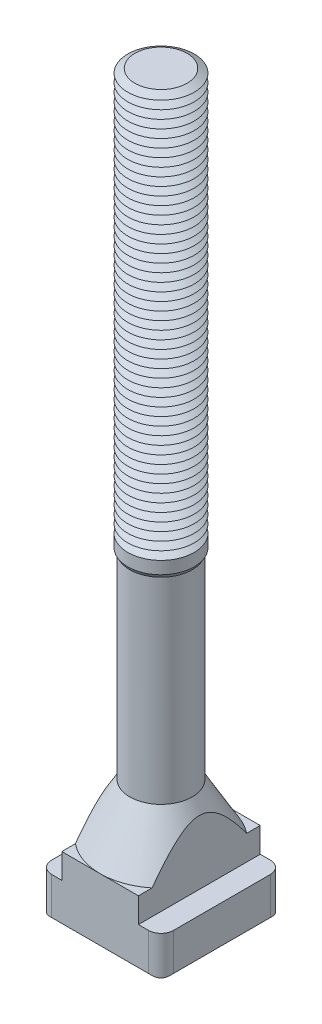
ISO-10303-21;
HEADER;
FILE_DESCRIPTION(('STEP AP214'),'2;1');
FILE_NAME('part.step','',(''),(''),'','','');
FILE_SCHEMA(('AUTOMOTIVE_DESIGN { 1 0 10303 214 1 1 1 1 }'));
ENDSEC;
DATA;
#1=APPLICATION_CONTEXT('core data for automotive mechanical design processes');
#2=APPLICATION_PROTOCOL_DEFINITION('international standard','automotive_design',2000,#1);
#3=PRODUCT_CONTEXT('',#1,'mechanical');
#4=PRODUCT('Part','Part','',(#3));
#5=PRODUCT_RELATED_PRODUCT_CATEGORY('part','',(#4));
#6=PRODUCT_DEFINITION_FORMATION('','',#4);
#7=PRODUCT_DEFINITION_CONTEXT('part definition',#1,'design');
#8=PRODUCT_DEFINITION('design','',#6,#7);
#9=PRODUCT_DEFINITION_SHAPE('','',#8);
#10=(LENGTH_UNIT() NAMED_UNIT(*) SI_UNIT(.MILLI.,.METRE.));
#11=(NAMED_UNIT(*) PLANE_ANGLE_UNIT() SI_UNIT($,.RADIAN.));
#12=(NAMED_UNIT(*) SI_UNIT($,.STERADIAN.) SOLID_ANGLE_UNIT());
#13=UNCERTAINTY_MEASURE_WITH_UNIT(LENGTH_MEASURE(1.E-05),#10,'distance_accuracy_value','');
#14=(GEOMETRIC_REPRESENTATION_CONTEXT(3) GLOBAL_UNCERTAINTY_ASSIGNED_CONTEXT((#13)) GLOBAL_UNIT_ASSIGNED_CONTEXT((#10,
#11,#12)) REPRESENTATION_CONTEXT('',''));
#15=CARTESIAN_POINT('',(0.,0.,0.));
#16=DIRECTION('',(0.,0.,1.));
#17=DIRECTION('',(1.,0.,0.));
#18=AXIS2_PLACEMENT_3D('',#15,#16,#17);
#19=CARTESIAN_POINT('',(0.,256.,0.));
#20=DIRECTION('',(0.,-1.,0.));
#21=DIRECTION('',(0.,0.,-1.));
#22=AXIS2_PLACEMENT_3D('',#19,#20,#21);
#23=CONICAL_SURFACE('',#22,9.40192378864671,1.0471975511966);
#24=CARTESIAN_POINT('',(0.,254.5,0.));
#25=DIRECTION('',(0.,-1.,0.));
#26=DIRECTION('',(0.,0.,-1.));
#27=AXIS2_PLACEMENT_3D('',#24,#25,#26);
#28=CIRCLE('',#27,12.);
#29=CARTESIAN_POINT('',(0.,254.5,-12.));
#30=VERTEX_POINT('',#29);
#31=EDGE_CURVE('E719',#30,#30,#28,.T.);
#32=ORIENTED_EDGE('',*,*,#31,.F.);
#33=EDGE_LOOP('',(#32));
#34=FACE_BOUND('',#33,.T.);
#35=CARTESIAN_POINT('',(0.,256.,0.));
#36=DIRECTION('',(0.,-1.,0.));
#37=DIRECTION('',(0.,0.,-1.));
#38=AXIS2_PLACEMENT_3D('',#35,#36,#37);
#39=CIRCLE('',#38,9.40192378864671);
#40=CARTESIAN_POINT('',(0.,256.,-9.40192378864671));
#41=VERTEX_POINT('',#40);
#42=EDGE_CURVE('E631',#41,#41,#39,.T.);
#43=ORIENTED_EDGE('',*,*,#42,.T.);
#44=EDGE_LOOP('',(#43));
#45=FACE_BOUND('',#44,.T.);
#46=ADVANCED_FACE('F39',(#34,#45),#23,.T.);
#47=CARTESIAN_POINT('',(0.,257.5,0.));
#48=DIRECTION('',(0.,1.,0.));
#49=DIRECTION('',(0.,0.,1.));
#50=AXIS2_PLACEMENT_3D('',#47,#48,#49);
#51=CONICAL_SURFACE('',#50,12.,1.0471975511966);
#52=ORIENTED_EDGE('',*,*,#42,.F.);
#53=EDGE_LOOP('',(#52));
#54=FACE_BOUND('',#53,.T.);
#55=CARTESIAN_POINT('',(0.,257.5,0.));
#56=DIRECTION('',(0.,-1.,0.));
#57=DIRECTION('',(0.,0.,-1.));
#58=AXIS2_PLACEMENT_3D('',#55,#56,#57);
#59=CIRCLE('',#58,12.);
#60=CARTESIAN_POINT('',(0.,257.5,-12.));
#61=VERTEX_POINT('',#60);
#62=EDGE_CURVE('E725',#61,#61,#59,.T.);
#63=ORIENTED_EDGE('',*,*,#62,.T.);
#64=EDGE_LOOP('',(#63));
#65=FACE_BOUND('',#64,.T.);
#66=ADVANCED_FACE('F448',(#54,#65),#51,.T.);
#67=CARTESIAN_POINT('',(5.41072784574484,268.,0.));
#68=DIRECTION('',(0.,-1.,0.));
#69=DIRECTION('',(1.,0.,0.));
#70=AXIS2_PLACEMENT_3D('',#67,#68,#69);
#71=PLANE('',#70);
#72=CARTESIAN_POINT('',(0.,268.,0.));
#73=DIRECTION('',(0.,-1.,0.));
#74=DIRECTION('',(0.,0.,-1.));
#75=AXIS2_PLACEMENT_3D('',#72,#73,#74);
#76=CIRCLE('',#75,9.40192378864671);
#77=CARTESIAN_POINT('',(0.,268.,-9.40192378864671));
#78=VERTEX_POINT('',#77);
#79=EDGE_CURVE('E752',#78,#78,#76,.T.);
#80=ORIENTED_EDGE('',*,*,#79,.F.);
#81=EDGE_LOOP('',(#80));
#82=FACE_BOUND('',#81,.T.);
#83=ADVANCED_FACE('F454',(#82),#71,.F.);
#84=CARTESIAN_POINT('',(0.,268.,0.));
#85=DIRECTION('',(0.,-1.,0.));
#86=DIRECTION('',(0.,0.,-1.));
#87=AXIS2_PLACEMENT_3D('',#84,#85,#86);
#88=CONICAL_SURFACE('',#87,9.40192378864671,1.0471975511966);
#89=CARTESIAN_POINT('',(0.,266.5,0.));
#90=DIRECTION('',(0.,-1.,0.));
#91=DIRECTION('',(0.,0.,-1.));
#92=AXIS2_PLACEMENT_3D('',#89,#90,#91);
#93=CIRCLE('',#92,12.);
#94=CARTESIAN_POINT('',(0.,266.5,-12.));
#95=VERTEX_POINT('',#94);
#96=EDGE_CURVE('E748',#95,#95,#93,.T.);
#97=ORIENTED_EDGE('',*,*,#96,.F.);
#98=EDGE_LOOP('',(#97));
#99=FACE_BOUND('',#98,.T.);
#100=ORIENTED_EDGE('',*,*,#79,.T.);
#101=EDGE_LOOP('',(#100));
#102=FACE_BOUND('',#101,.T.);
#103=ADVANCED_FACE('F482',(#99,#102),#88,.T.);
#104=CARTESIAN_POINT('',(0.,266.5,0.));
#105=DIRECTION('',(0.,1.,0.));
#106=DIRECTION('',(0.,0.,1.));
#107=AXIS2_PLACEMENT_3D('',#104,#105,#106);
#108=CONICAL_SURFACE('',#107,12.,1.0471975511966);
#109=CARTESIAN_POINT('',(0.,265.,0.));
#110=DIRECTION('',(0.,-1.,0.));
#111=DIRECTION('',(0.,0.,-1.));
#112=AXIS2_PLACEMENT_3D('',#109,#110,#111);
#113=CIRCLE('',#112,9.40192378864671);
#114=CARTESIAN_POINT('',(0.,265.,-9.40192378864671));
#115=VERTEX_POINT('',#114);
#116=EDGE_CURVE('E744',#115,#115,#113,.T.);
#117=ORIENTED_EDGE('',*,*,#116,.F.);
#118=EDGE_LOOP('',(#117));
#119=FACE_BOUND('',#118,.T.);
#120=ORIENTED_EDGE('',*,*,#96,.T.);
#121=EDGE_LOOP('',(#120));
#122=FACE_BOUND('',#121,.T.);
#123=ADVANCED_FACE('F479',(#119,#122),#108,.T.);
#124=CARTESIAN_POINT('',(0.,265.,0.));
#125=DIRECTION('',(0.,-1.,0.));
#126=DIRECTION('',(0.,0.,-1.));
#127=AXIS2_PLACEMENT_3D('',#124,#125,#126);
#128=CONICAL_SURFACE('',#127,9.40192378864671,1.0471975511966);
#129=CARTESIAN_POINT('',(0.,263.5,0.));
#130=DIRECTION('',(0.,-1.,0.));
#131=DIRECTION('',(0.,0.,-1.));
#132=AXIS2_PLACEMENT_3D('',#129,#130,#131);
#133=CIRCLE('',#132,12.);
#134=CARTESIAN_POINT('',(0.,263.5,-12.));
#135=VERTEX_POINT('',#134);
#136=EDGE_CURVE('E740',#135,#135,#133,.T.);
#137=ORIENTED_EDGE('',*,*,#136,.F.);
#138=EDGE_LOOP('',(#137));
#139=FACE_BOUND('',#138,.T.);
#140=ORIENTED_EDGE('',*,*,#116,.T.);
#141=EDGE_LOOP('',(#140));
#142=FACE_BOUND('',#141,.T.);
#143=ADVANCED_FACE('F474',(#139,#142),#128,.T.);
#144=CARTESIAN_POINT('',(0.,263.5,0.));
#145=DIRECTION('',(0.,1.,0.));
#146=DIRECTION('',(0.,0.,1.));
#147=AXIS2_PLACEMENT_3D('',#144,#145,#146);
#148=CONICAL_SURFACE('',#147,12.,1.0471975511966);
#149=CARTESIAN_POINT('',(0.,262.,0.));
#150=DIRECTION('',(0.,-1.,0.));
#151=DIRECTION('',(0.,0.,-1.));
#152=AXIS2_PLACEMENT_3D('',#149,#150,#151);
#153=CIRCLE('',#152,9.40192378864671);
#154=CARTESIAN_POINT('',(0.,262.,-9.40192378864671));
#155=VERTEX_POINT('',#154);
#156=EDGE_CURVE('E736',#155,#155,#153,.T.);
#157=ORIENTED_EDGE('',*,*,#156,.F.);
#158=EDGE_LOOP('',(#157));
#159=FACE_BOUND('',#158,.T.);
#160=ORIENTED_EDGE('',*,*,#136,.T.);
#161=EDGE_LOOP('',(#160));
#162=FACE_BOUND('',#161,.T.);
#163=ADVANCED_FACE('F471',(#159,#162),#148,.T.);
#164=CARTESIAN_POINT('',(0.,262.,0.));
#165=DIRECTION('',(0.,-1.,0.));
#166=DIRECTION('',(0.,0.,-1.));
#167=AXIS2_PLACEMENT_3D('',#164,#165,#166);
#168=CONICAL_SURFACE('',#167,9.40192378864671,1.0471975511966);
#169=CARTESIAN_POINT('',(0.,260.5,0.));
#170=DIRECTION('',(0.,-1.,0.));
#171=DIRECTION('',(0.,0.,-1.));
#172=AXIS2_PLACEMENT_3D('',#169,#170,#171);
#173=CIRCLE('',#172,12.);
#174=CARTESIAN_POINT('',(0.,260.5,-12.));
#175=VERTEX_POINT('',#174);
#176=EDGE_CURVE('E732',#175,#175,#173,.T.);
#177=ORIENTED_EDGE('',*,*,#176,.F.);
#178=EDGE_LOOP('',(#177));
#179=FACE_BOUND('',#178,.T.);
#180=ORIENTED_EDGE('',*,*,#156,.T.);
#181=EDGE_LOOP('',(#180));
#182=FACE_BOUND('',#181,.T.);
#183=ADVANCED_FACE('F465',(#179,#182),#168,.T.);
#184=CARTESIAN_POINT('',(0.,260.5,0.));
#185=DIRECTION('',(0.,1.,0.));
#186=DIRECTION('',(0.,0.,1.));
#187=AXIS2_PLACEMENT_3D('',#184,#185,#186);
#188=CONICAL_SURFACE('',#187,12.,1.0471975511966);
#189=CARTESIAN_POINT('',(0.,259.,0.));
#190=DIRECTION('',(0.,-1.,0.));
#191=DIRECTION('',(0.,0.,-1.));
#192=AXIS2_PLACEMENT_3D('',#189,#190,#191);
#193=CIRCLE('',#192,9.40192378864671);
#194=CARTESIAN_POINT('',(0.,259.,-9.40192378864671));
#195=VERTEX_POINT('',#194);
#196=EDGE_CURVE('E729',#195,#195,#193,.T.);
#197=ORIENTED_EDGE('',*,*,#196,.F.);
#198=EDGE_LOOP('',(#197));
#199=FACE_BOUND('',#198,.T.);
#200=ORIENTED_EDGE('',*,*,#176,.T.);
#201=EDGE_LOOP('',(#200));
#202=FACE_BOUND('',#201,.T.);
#203=ADVANCED_FACE('F461',(#199,#202),#188,.T.);
#204=CARTESIAN_POINT('',(0.,259.,0.));
#205=DIRECTION('',(0.,-1.,0.));
#206=DIRECTION('',(0.,0.,-1.));
#207=AXIS2_PLACEMENT_3D('',#204,#205,#206);
#208=CONICAL_SURFACE('',#207,9.40192378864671,1.0471975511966);
#209=ORIENTED_EDGE('',*,*,#62,.F.);
#210=EDGE_LOOP('',(#209));
#211=FACE_BOUND('',#210,.T.);
#212=ORIENTED_EDGE('',*,*,#196,.T.);
#213=EDGE_LOOP('',(#212));
#214=FACE_BOUND('',#213,.T.);
#215=ADVANCED_FACE('F464',(#211,#214),#208,.T.);
#216=CARTESIAN_POINT('',(0.,253.,0.));
#217=DIRECTION('',(0.,-1.,0.));
#218=DIRECTION('',(0.,0.,-1.));
#219=AXIS2_PLACEMENT_3D('',#216,#217,#218);
#220=CONICAL_SURFACE('',#219,9.40192378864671,1.0471975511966);
#221=CARTESIAN_POINT('',(0.,251.5,0.));
#222=DIRECTION('',(0.,-1.,0.));
#223=DIRECTION('',(0.,0.,-1.));
#224=AXIS2_PLACEMENT_3D('',#221,#222,#223);
#225=CIRCLE('',#224,12.);
#226=CARTESIAN_POINT('',(0.,251.5,-12.));
#227=VERTEX_POINT('',#226);
#228=EDGE_CURVE('E711',#227,#227,#225,.T.);
#229=ORIENTED_EDGE('',*,*,#228,.F.);
#230=EDGE_LOOP('',(#229));
#231=FACE_BOUND('',#230,.T.);
#232=CARTESIAN_POINT('',(0.,253.,0.));
#233=DIRECTION('',(0.,-1.,0.));
#234=DIRECTION('',(0.,0.,-1.));
#235=AXIS2_PLACEMENT_3D('',#232,#233,#234);
#236=CIRCLE('',#235,9.40192378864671);
#237=CARTESIAN_POINT('',(0.,253.,-9.40192378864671));
#238=VERTEX_POINT('',#237);
#239=EDGE_CURVE('E715',#238,#238,#236,.T.);
#240=ORIENTED_EDGE('',*,*,#239,.T.);
#241=EDGE_LOOP('',(#240));
#242=FACE_BOUND('',#241,.T.);
#243=ADVANCED_FACE('F469',(#231,#242),#220,.T.);
#244=CARTESIAN_POINT('',(0.,254.5,0.));
#245=DIRECTION('',(0.,1.,0.));
#246=DIRECTION('',(0.,0.,1.));
#247=AXIS2_PLACEMENT_3D('',#244,#245,#246);
#248=CONICAL_SURFACE('',#247,12.,1.0471975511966);
#249=ORIENTED_EDGE('',*,*,#239,.F.);
#250=EDGE_LOOP('',(#249));
#251=FACE_BOUND('',#250,.T.);
#252=ORIENTED_EDGE('',*,*,#31,.T.);
#253=EDGE_LOOP('',(#252));
#254=FACE_BOUND('',#253,.T.);
#255=ADVANCED_FACE('F975',(#251,#254),#248,.T.);
#256=CARTESIAN_POINT('',(0.,250.,0.));
#257=DIRECTION('',(0.,-1.,0.));
#258=DIRECTION('',(0.,0.,-1.));
#259=AXIS2_PLACEMENT_3D('',#256,#257,#258);
#260=CONICAL_SURFACE('',#259,9.40192378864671,1.0471975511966);
#261=CARTESIAN_POINT('',(0.,248.5,0.));
#262=DIRECTION('',(0.,-1.,0.));
#263=DIRECTION('',(0.,0.,-1.));
#264=AXIS2_PLACEMENT_3D('',#261,#262,#263);
#265=CIRCLE('',#264,12.);
#266=CARTESIAN_POINT('',(0.,248.5,-12.));
#267=VERTEX_POINT('',#266);
#268=EDGE_CURVE('E703',#267,#267,#265,.T.);
#269=ORIENTED_EDGE('',*,*,#268,.F.);
#270=EDGE_LOOP('',(#269));
#271=FACE_BOUND('',#270,.T.);
#272=CARTESIAN_POINT('',(0.,250.,0.));
#273=DIRECTION('',(0.,-1.,0.));
#274=DIRECTION('',(0.,0.,-1.));
#275=AXIS2_PLACEMENT_3D('',#272,#273,#274);
#276=CIRCLE('',#275,9.40192378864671);
#277=CARTESIAN_POINT('',(0.,250.,-9.40192378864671));
#278=VERTEX_POINT('',#277);
#279=EDGE_CURVE('E707',#278,#278,#276,.T.);
#280=ORIENTED_EDGE('',*,*,#279,.T.);
#281=EDGE_LOOP('',(#280));
#282=FACE_BOUND('',#281,.T.);
#283=ADVANCED_FACE('F971',(#271,#282),#260,.T.);
#284=CARTESIAN_POINT('',(0.,251.5,0.));
#285=DIRECTION('',(0.,1.,0.));
#286=DIRECTION('',(0.,0.,1.));
#287=AXIS2_PLACEMENT_3D('',#284,#285,#286);
#288=CONICAL_SURFACE('',#287,12.,1.0471975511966);
#289=ORIENTED_EDGE('',*,*,#279,.F.);
#290=EDGE_LOOP('',(#289));
#291=FACE_BOUND('',#290,.T.);
#292=ORIENTED_EDGE('',*,*,#228,.T.);
#293=EDGE_LOOP('',(#292));
#294=FACE_BOUND('',#293,.T.);
#295=ADVANCED_FACE('F967',(#291,#294),#288,.T.);
#296=CARTESIAN_POINT('',(0.,247.,0.));
#297=DIRECTION('',(0.,-1.,0.));
#298=DIRECTION('',(0.,0.,-1.));
#299=AXIS2_PLACEMENT_3D('',#296,#297,#298);
#300=CONICAL_SURFACE('',#299,9.40192378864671,1.0471975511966);
#301=CARTESIAN_POINT('',(0.,245.5,0.));
#302=DIRECTION('',(0.,-1.,0.));
#303=DIRECTION('',(0.,0.,-1.));
#304=AXIS2_PLACEMENT_3D('',#301,#302,#303);
#305=CIRCLE('',#304,12.);
#306=CARTESIAN_POINT('',(0.,245.5,-12.));
#307=VERTEX_POINT('',#306);
#308=EDGE_CURVE('E695',#307,#307,#305,.T.);
#309=ORIENTED_EDGE('',*,*,#308,.F.);
#310=EDGE_LOOP('',(#309));
#311=FACE_BOUND('',#310,.T.);
#312=CARTESIAN_POINT('',(0.,247.,0.));
#313=DIRECTION('',(0.,-1.,0.));
#314=DIRECTION('',(0.,0.,-1.));
#315=AXIS2_PLACEMENT_3D('',#312,#313,#314);
#316=CIRCLE('',#315,9.40192378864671);
#317=CARTESIAN_POINT('',(0.,247.,-9.40192378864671));
#318=VERTEX_POINT('',#317);
#319=EDGE_CURVE('E699',#318,#318,#316,.T.);
#320=ORIENTED_EDGE('',*,*,#319,.T.);
#321=EDGE_LOOP('',(#320));
#322=FACE_BOUND('',#321,.T.);
#323=ADVANCED_FACE('F963',(#311,#322),#300,.T.);
#324=CARTESIAN_POINT('',(0.,248.5,0.));
#325=DIRECTION('',(0.,1.,0.));
#326=DIRECTION('',(0.,0.,1.));
#327=AXIS2_PLACEMENT_3D('',#324,#325,#326);
#328=CONICAL_SURFACE('',#327,12.,1.0471975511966);
#329=ORIENTED_EDGE('',*,*,#319,.F.);
#330=EDGE_LOOP('',(#329));
#331=FACE_BOUND('',#330,.T.);
#332=ORIENTED_EDGE('',*,*,#268,.T.);
#333=EDGE_LOOP('',(#332));
#334=FACE_BOUND('',#333,.T.);
#335=ADVANCED_FACE('F959',(#331,#334),#328,.T.);
#336=CARTESIAN_POINT('',(0.,244.,0.));
#337=DIRECTION('',(0.,-1.,0.));
#338=DIRECTION('',(0.,0.,-1.));
#339=AXIS2_PLACEMENT_3D('',#336,#337,#338);
#340=CONICAL_SURFACE('',#339,9.40192378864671,1.0471975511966);
#341=CARTESIAN_POINT('',(0.,242.5,0.));
#342=DIRECTION('',(0.,-1.,0.));
#343=DIRECTION('',(0.,0.,-1.));
#344=AXIS2_PLACEMENT_3D('',#341,#342,#343);
#345=CIRCLE('',#344,12.);
#346=CARTESIAN_POINT('',(0.,242.5,-12.));
#347=VERTEX_POINT('',#346);
#348=EDGE_CURVE('E687',#347,#347,#345,.T.);
#349=ORIENTED_EDGE('',*,*,#348,.F.);
#350=EDGE_LOOP('',(#349));
#351=FACE_BOUND('',#350,.T.);
#352=CARTESIAN_POINT('',(0.,244.,0.));
#353=DIRECTION('',(0.,-1.,0.));
#354=DIRECTION('',(0.,0.,-1.));
#355=AXIS2_PLACEMENT_3D('',#352,#353,#354);
#356=CIRCLE('',#355,9.40192378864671);
#357=CARTESIAN_POINT('',(0.,244.,-9.40192378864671));
#358=VERTEX_POINT('',#357);
#359=EDGE_CURVE('E691',#358,#358,#356,.T.);
#360=ORIENTED_EDGE('',*,*,#359,.T.);
#361=EDGE_LOOP('',(#360));
#362=FACE_BOUND('',#361,.T.);
#363=ADVANCED_FACE('F955',(#351,#362),#340,.T.);
#364=CARTESIAN_POINT('',(0.,245.5,0.));
#365=DIRECTION('',(0.,1.,0.));
#366=DIRECTION('',(0.,0.,1.));
#367=AXIS2_PLACEMENT_3D('',#364,#365,#366);
#368=CONICAL_SURFACE('',#367,12.,1.0471975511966);
#369=ORIENTED_EDGE('',*,*,#359,.F.);
#370=EDGE_LOOP('',(#369));
#371=FACE_BOUND('',#370,.T.);
#372=ORIENTED_EDGE('',*,*,#308,.T.);
#373=EDGE_LOOP('',(#372));
#374=FACE_BOUND('',#373,.T.);
#375=ADVANCED_FACE('F951',(#371,#374),#368,.T.);
#376=CARTESIAN_POINT('',(0.,241.,0.));
#377=DIRECTION('',(0.,-1.,0.));
#378=DIRECTION('',(0.,0.,-1.));
#379=AXIS2_PLACEMENT_3D('',#376,#377,#378);
#380=CONICAL_SURFACE('',#379,9.40192378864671,1.0471975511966);
#381=CARTESIAN_POINT('',(0.,239.5,0.));
#382=DIRECTION('',(0.,-1.,0.));
#383=DIRECTION('',(0.,0.,-1.));
#384=AXIS2_PLACEMENT_3D('',#381,#382,#383);
#385=CIRCLE('',#384,12.);
#386=CARTESIAN_POINT('',(0.,239.5,-12.));
#387=VERTEX_POINT('',#386);
#388=EDGE_CURVE('E672',#387,#387,#385,.T.);
#389=ORIENTED_EDGE('',*,*,#388,.F.);
#390=EDGE_LOOP('',(#389));
#391=FACE_BOUND('',#390,.T.);
#392=CARTESIAN_POINT('',(0.,241.,0.));
#393=DIRECTION('',(0.,-1.,0.));
#394=DIRECTION('',(0.,0.,-1.));
#395=AXIS2_PLACEMENT_3D('',#392,#393,#394);
#396=CIRCLE('',#395,9.40192378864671);
#397=CARTESIAN_POINT('',(0.,241.,-9.40192378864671));
#398=VERTEX_POINT('',#397);
#399=EDGE_CURVE('E683',#398,#398,#396,.T.);
#400=ORIENTED_EDGE('',*,*,#399,.T.);
#401=EDGE_LOOP('',(#400));
#402=FACE_BOUND('',#401,.T.);
#403=ADVANCED_FACE('F947',(#391,#402),#380,.T.);
#404=CARTESIAN_POINT('',(0.,242.5,0.));
#405=DIRECTION('',(0.,1.,0.));
#406=DIRECTION('',(0.,0.,1.));
#407=AXIS2_PLACEMENT_3D('',#404,#405,#406);
#408=CONICAL_SURFACE('',#407,12.,1.0471975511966);
#409=ORIENTED_EDGE('',*,*,#399,.F.);
#410=EDGE_LOOP('',(#409));
#411=FACE_BOUND('',#410,.T.);
#412=ORIENTED_EDGE('',*,*,#348,.T.);
#413=EDGE_LOOP('',(#412));
#414=FACE_BOUND('',#413,.T.);
#415=ADVANCED_FACE('F943',(#411,#414),#408,.T.);
#416=CARTESIAN_POINT('',(0.,238.,0.));
#417=DIRECTION('',(0.,-1.,0.));
#418=DIRECTION('',(0.,0.,-1.));
#419=AXIS2_PLACEMENT_3D('',#416,#417,#418);
#420=CONICAL_SURFACE('',#419,9.40192378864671,1.0471975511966);
#421=CARTESIAN_POINT('',(0.,236.5,0.));
#422=DIRECTION('',(0.,-1.,0.));
#423=DIRECTION('',(0.,0.,-1.));
#424=AXIS2_PLACEMENT_3D('',#421,#422,#423);
#425=CIRCLE('',#424,12.);
#426=CARTESIAN_POINT('',(0.,236.5,-12.));
#427=VERTEX_POINT('',#426);
#428=EDGE_CURVE('E663',#427,#427,#425,.T.);
#429=ORIENTED_EDGE('',*,*,#428,.F.);
#430=EDGE_LOOP('',(#429));
#431=FACE_BOUND('',#430,.T.);
#432=CARTESIAN_POINT('',(0.,238.,0.));
#433=DIRECTION('',(0.,-1.,0.));
#434=DIRECTION('',(0.,0.,-1.));
#435=AXIS2_PLACEMENT_3D('',#432,#433,#434);
#436=CIRCLE('',#435,9.40192378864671);
#437=CARTESIAN_POINT('',(0.,238.,-9.40192378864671));
#438=VERTEX_POINT('',#437);
#439=EDGE_CURVE('E665',#438,#438,#436,.T.);
#440=ORIENTED_EDGE('',*,*,#439,.T.);
#441=EDGE_LOOP('',(#440));
#442=FACE_BOUND('',#441,.T.);
#443=ADVANCED_FACE('F939',(#431,#442),#420,.T.);
#444=CARTESIAN_POINT('',(0.,239.5,0.));
#445=DIRECTION('',(0.,1.,0.));
#446=DIRECTION('',(0.,0.,1.));
#447=AXIS2_PLACEMENT_3D('',#444,#445,#446);
#448=CONICAL_SURFACE('',#447,12.,1.0471975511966);
#449=ORIENTED_EDGE('',*,*,#439,.F.);
#450=EDGE_LOOP('',(#449));
#451=FACE_BOUND('',#450,.T.);
#452=ORIENTED_EDGE('',*,*,#388,.T.);
#453=EDGE_LOOP('',(#452));
#454=FACE_BOUND('',#453,.T.);
#455=ADVANCED_FACE('F923',(#451,#454),#448,.T.);
#456=CARTESIAN_POINT('',(0.,235.,0.));
#457=DIRECTION('',(0.,-1.,0.));
#458=DIRECTION('',(0.,0.,-1.));
#459=AXIS2_PLACEMENT_3D('',#456,#457,#458);
#460=CONICAL_SURFACE('',#459,9.40192378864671,1.0471975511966);
#461=CARTESIAN_POINT('',(0.,233.5,0.));
#462=DIRECTION('',(0.,-1.,0.));
#463=DIRECTION('',(0.,0.,-1.));
#464=AXIS2_PLACEMENT_3D('',#461,#462,#463);
#465=CIRCLE('',#464,12.);
#466=CARTESIAN_POINT('',(0.,233.5,-12.));
#467=VERTEX_POINT('',#466);
#468=EDGE_CURVE('E676',#467,#467,#465,.T.);
#469=ORIENTED_EDGE('',*,*,#468,.F.);
#470=EDGE_LOOP('',(#469));
#471=FACE_BOUND('',#470,.T.);
#472=CARTESIAN_POINT('',(0.,235.,0.));
#473=DIRECTION('',(0.,-1.,0.));
#474=DIRECTION('',(0.,0.,-1.));
#475=AXIS2_PLACEMENT_3D('',#472,#473,#474);
#476=CIRCLE('',#475,9.40192378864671);
#477=CARTESIAN_POINT('',(0.,235.,-9.40192378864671));
#478=VERTEX_POINT('',#477);
#479=EDGE_CURVE('E666',#478,#478,#476,.T.);
#480=ORIENTED_EDGE('',*,*,#479,.T.);
#481=EDGE_LOOP('',(#480));
#482=FACE_BOUND('',#481,.T.);
#483=ADVANCED_FACE('F919',(#471,#482),#460,.T.);
#484=CARTESIAN_POINT('',(0.,236.5,0.));
#485=DIRECTION('',(0.,1.,0.));
#486=DIRECTION('',(0.,0.,1.));
#487=AXIS2_PLACEMENT_3D('',#484,#485,#486);
#488=CONICAL_SURFACE('',#487,12.,1.0471975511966);
#489=ORIENTED_EDGE('',*,*,#479,.F.);
#490=EDGE_LOOP('',(#489));
#491=FACE_BOUND('',#490,.T.);
#492=ORIENTED_EDGE('',*,*,#428,.T.);
#493=EDGE_LOOP('',(#492));
#494=FACE_BOUND('',#493,.T.);
#495=ADVANCED_FACE('F922',(#491,#494),#488,.T.);
#496=CARTESIAN_POINT('',(0.,232.,0.));
#497=DIRECTION('',(0.,-1.,0.));
#498=DIRECTION('',(0.,0.,-1.));
#499=AXIS2_PLACEMENT_3D('',#496,#497,#498);
#500=CONICAL_SURFACE('',#499,9.40192378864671,1.0471975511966);
#501=CARTESIAN_POINT('',(0.,230.5,0.));
#502=DIRECTION('',(0.,-1.,0.));
#503=DIRECTION('',(0.,0.,-1.));
#504=AXIS2_PLACEMENT_3D('',#501,#502,#503);
#505=CIRCLE('',#504,12.);
#506=CARTESIAN_POINT('',(0.,230.5,-12.));
#507=VERTEX_POINT('',#506);
#508=EDGE_CURVE('E897',#507,#507,#505,.T.);
#509=ORIENTED_EDGE('',*,*,#508,.F.);
#510=EDGE_LOOP('',(#509));
#511=FACE_BOUND('',#510,.T.);
#512=CARTESIAN_POINT('',(0.,232.,0.));
#513=DIRECTION('',(0.,-1.,0.));
#514=DIRECTION('',(0.,0.,-1.));
#515=AXIS2_PLACEMENT_3D('',#512,#513,#514);
#516=CIRCLE('',#515,9.40192378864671);
#517=CARTESIAN_POINT('',(0.,232.,-9.40192378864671));
#518=VERTEX_POINT('',#517);
#519=EDGE_CURVE('E899',#518,#518,#516,.T.);
#520=ORIENTED_EDGE('',*,*,#519,.T.);
#521=EDGE_LOOP('',(#520));
#522=FACE_BOUND('',#521,.T.);
#523=ADVANCED_FACE('F928',(#511,#522),#500,.T.);
#524=CARTESIAN_POINT('',(0.,233.5,0.));
#525=DIRECTION('',(0.,1.,0.));
#526=DIRECTION('',(0.,0.,1.));
#527=AXIS2_PLACEMENT_3D('',#524,#525,#526);
#528=CONICAL_SURFACE('',#527,12.,1.0471975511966);
#529=ORIENTED_EDGE('',*,*,#519,.F.);
#530=EDGE_LOOP('',(#529));
#531=FACE_BOUND('',#530,.T.);
#532=ORIENTED_EDGE('',*,*,#468,.T.);
#533=EDGE_LOOP('',(#532));
#534=FACE_BOUND('',#533,.T.);
#535=ADVANCED_FACE('F917',(#531,#534),#528,.T.);
#536=CARTESIAN_POINT('',(0.,229.,0.));
#537=DIRECTION('',(0.,-1.,0.));
#538=DIRECTION('',(0.,0.,-1.));
#539=AXIS2_PLACEMENT_3D('',#536,#537,#538);
#540=CONICAL_SURFACE('',#539,9.40192378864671,1.0471975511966);
#541=CARTESIAN_POINT('',(0.,227.5,0.));
#542=DIRECTION('',(0.,-1.,0.));
#543=DIRECTION('',(0.,0.,-1.));
#544=AXIS2_PLACEMENT_3D('',#541,#542,#543);
#545=CIRCLE('',#544,12.);
#546=CARTESIAN_POINT('',(0.,227.5,-12.));
#547=VERTEX_POINT('',#546);
#548=EDGE_CURVE('E909',#547,#547,#545,.T.);
#549=ORIENTED_EDGE('',*,*,#548,.F.);
#550=EDGE_LOOP('',(#549));
#551=FACE_BOUND('',#550,.T.);
#552=CARTESIAN_POINT('',(0.,229.,0.));
#553=DIRECTION('',(0.,-1.,0.));
#554=DIRECTION('',(0.,0.,-1.));
#555=AXIS2_PLACEMENT_3D('',#552,#553,#554);
#556=CIRCLE('',#555,9.40192378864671);
#557=CARTESIAN_POINT('',(0.,229.,-9.40192378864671));
#558=VERTEX_POINT('',#557);
#559=EDGE_CURVE('E900',#558,#558,#556,.T.);
#560=ORIENTED_EDGE('',*,*,#559,.T.);
#561=EDGE_LOOP('',(#560));
#562=FACE_BOUND('',#561,.T.);
#563=ADVANCED_FACE('F1041',(#551,#562),#540,.T.);
#564=CARTESIAN_POINT('',(0.,230.5,0.));
#565=DIRECTION('',(0.,1.,0.));
#566=DIRECTION('',(0.,0.,1.));
#567=AXIS2_PLACEMENT_3D('',#564,#565,#566);
#568=CONICAL_SURFACE('',#567,12.,1.0471975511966);
#569=ORIENTED_EDGE('',*,*,#559,.F.);
#570=EDGE_LOOP('',(#569));
#571=FACE_BOUND('',#570,.T.);
#572=ORIENTED_EDGE('',*,*,#508,.T.);
#573=EDGE_LOOP('',(#572));
#574=FACE_BOUND('',#573,.T.);
#575=ADVANCED_FACE('F1049',(#571,#574),#568,.T.);
#576=CARTESIAN_POINT('',(0.,226.,0.));
#577=DIRECTION('',(0.,-1.,0.));
#578=DIRECTION('',(0.,0.,-1.));
#579=AXIS2_PLACEMENT_3D('',#576,#577,#578);
#580=CONICAL_SURFACE('',#579,9.40192378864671,1.0471975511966);
#581=CARTESIAN_POINT('',(0.,224.5,0.));
#582=DIRECTION('',(0.,-1.,0.));
#583=DIRECTION('',(0.,0.,-1.));
#584=AXIS2_PLACEMENT_3D('',#581,#582,#583);
#585=CIRCLE('',#584,12.);
#586=CARTESIAN_POINT('',(0.,224.5,-12.));
#587=VERTEX_POINT('',#586);
#588=EDGE_CURVE('E858',#587,#587,#585,.T.);
#589=ORIENTED_EDGE('',*,*,#588,.F.);
#590=EDGE_LOOP('',(#589));
#591=FACE_BOUND('',#590,.T.);
#592=CARTESIAN_POINT('',(0.,226.,0.));
#593=DIRECTION('',(0.,-1.,0.));
#594=DIRECTION('',(0.,0.,-1.));
#595=AXIS2_PLACEMENT_3D('',#592,#593,#594);
#596=CIRCLE('',#595,9.40192378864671);
#597=CARTESIAN_POINT('',(0.,226.,-9.40192378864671));
#598=VERTEX_POINT('',#597);
#599=EDGE_CURVE('E860',#598,#598,#596,.T.);
#600=ORIENTED_EDGE('',*,*,#599,.T.);
#601=EDGE_LOOP('',(#600));
#602=FACE_BOUND('',#601,.T.);
#603=ADVANCED_FACE('F1058',(#591,#602),#580,.T.);
#604=CARTESIAN_POINT('',(0.,227.5,0.));
#605=DIRECTION('',(0.,1.,0.));
#606=DIRECTION('',(0.,0.,1.));
#607=AXIS2_PLACEMENT_3D('',#604,#605,#606);
#608=CONICAL_SURFACE('',#607,12.,1.0471975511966);
#609=ORIENTED_EDGE('',*,*,#599,.F.);
#610=EDGE_LOOP('',(#609));
#611=FACE_BOUND('',#610,.T.);
#612=ORIENTED_EDGE('',*,*,#548,.T.);
#613=EDGE_LOOP('',(#612));
#614=FACE_BOUND('',#613,.T.);
#615=ADVANCED_FACE('F1067',(#611,#614),#608,.T.);
#616=CARTESIAN_POINT('',(0.,223.,0.));
#617=DIRECTION('',(0.,-1.,0.));
#618=DIRECTION('',(0.,0.,-1.));
#619=AXIS2_PLACEMENT_3D('',#616,#617,#618);
#620=CONICAL_SURFACE('',#619,9.40192378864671,1.0471975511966);
#621=CARTESIAN_POINT('',(0.,221.5,0.));
#622=DIRECTION('',(0.,-1.,0.));
#623=DIRECTION('',(0.,0.,-1.));
#624=AXIS2_PLACEMENT_3D('',#621,#622,#623);
#625=CIRCLE('',#624,12.);
#626=CARTESIAN_POINT('',(0.,221.5,-12.));
#627=VERTEX_POINT('',#626);
#628=EDGE_CURVE('E660',#627,#627,#625,.T.);
#629=ORIENTED_EDGE('',*,*,#628,.F.);
#630=EDGE_LOOP('',(#629));
#631=FACE_BOUND('',#630,.T.);
#632=CARTESIAN_POINT('',(0.,223.,0.));
#633=DIRECTION('',(0.,-1.,0.));
#634=DIRECTION('',(0.,0.,-1.));
#635=AXIS2_PLACEMENT_3D('',#632,#633,#634);
#636=CIRCLE('',#635,9.40192378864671);
#637=CARTESIAN_POINT('',(0.,223.,-9.40192378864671));
#638=VERTEX_POINT('',#637);
#639=EDGE_CURVE('E861',#638,#638,#636,.T.);
#640=ORIENTED_EDGE('',*,*,#639,.T.);
#641=EDGE_LOOP('',(#640));
#642=FACE_BOUND('',#641,.T.);
#643=ADVANCED_FACE('F1076',(#631,#642),#620,.T.);
#644=CARTESIAN_POINT('',(0.,224.5,0.));
#645=DIRECTION('',(0.,1.,0.));
#646=DIRECTION('',(0.,0.,1.));
#647=AXIS2_PLACEMENT_3D('',#644,#645,#646);
#648=CONICAL_SURFACE('',#647,12.,1.0471975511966);
#649=ORIENTED_EDGE('',*,*,#639,.F.);
#650=EDGE_LOOP('',(#649));
#651=FACE_BOUND('',#650,.T.);
#652=ORIENTED_EDGE('',*,*,#588,.T.);
#653=EDGE_LOOP('',(#652));
#654=FACE_BOUND('',#653,.T.);
#655=ADVANCED_FACE('F1085',(#651,#654),#648,.T.);
#656=CARTESIAN_POINT('',(0.,220.,0.));
#657=DIRECTION('',(0.,-1.,0.));
#658=DIRECTION('',(0.,0.,-1.));
#659=AXIS2_PLACEMENT_3D('',#656,#657,#658);
#660=CONICAL_SURFACE('',#659,9.40192378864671,1.0471975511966);
#661=CARTESIAN_POINT('',(0.,218.5,0.));
#662=DIRECTION('',(0.,-1.,0.));
#663=DIRECTION('',(0.,0.,-1.));
#664=AXIS2_PLACEMENT_3D('',#661,#662,#663);
#665=CIRCLE('',#664,12.);
#666=CARTESIAN_POINT('',(0.,218.5,-12.));
#667=VERTEX_POINT('',#666);
#668=EDGE_CURVE('E661',#667,#667,#665,.T.);
#669=ORIENTED_EDGE('',*,*,#668,.F.);
#670=EDGE_LOOP('',(#669));
#671=FACE_BOUND('',#670,.T.);
#672=CARTESIAN_POINT('',(0.,220.,0.));
#673=DIRECTION('',(0.,-1.,0.));
#674=DIRECTION('',(0.,0.,-1.));
#675=AXIS2_PLACEMENT_3D('',#672,#673,#674);
#676=CIRCLE('',#675,9.40192378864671);
#677=CARTESIAN_POINT('',(0.,220.,-9.40192378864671));
#678=VERTEX_POINT('',#677);
#679=EDGE_CURVE('E658',#678,#678,#676,.T.);
#680=ORIENTED_EDGE('',*,*,#679,.T.);
#681=EDGE_LOOP('',(#680));
#682=FACE_BOUND('',#681,.T.);
#683=ADVANCED_FACE('F1094',(#671,#682),#660,.T.);
#684=CARTESIAN_POINT('',(0.,221.5,0.));
#685=DIRECTION('',(0.,1.,0.));
#686=DIRECTION('',(0.,0.,1.));
#687=AXIS2_PLACEMENT_3D('',#684,#685,#686);
#688=CONICAL_SURFACE('',#687,12.,1.0471975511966);
#689=ORIENTED_EDGE('',*,*,#679,.F.);
#690=EDGE_LOOP('',(#689));
#691=FACE_BOUND('',#690,.T.);
#692=ORIENTED_EDGE('',*,*,#628,.T.);
#693=EDGE_LOOP('',(#692));
#694=FACE_BOUND('',#693,.T.);
#695=ADVANCED_FACE('F1103',(#691,#694),#688,.T.);
#696=CARTESIAN_POINT('',(0.,217.,0.));
#697=DIRECTION('',(0.,-1.,0.));
#698=DIRECTION('',(0.,0.,-1.));
#699=AXIS2_PLACEMENT_3D('',#696,#697,#698);
#700=CONICAL_SURFACE('',#699,9.40192378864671,1.0471975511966);
#701=CARTESIAN_POINT('',(0.,215.5,0.));
#702=DIRECTION('',(0.,-1.,0.));
#703=DIRECTION('',(0.,0.,-1.));
#704=AXIS2_PLACEMENT_3D('',#701,#702,#703);
#705=CIRCLE('',#704,12.);
#706=CARTESIAN_POINT('',(0.,215.5,-12.));
#707=VERTEX_POINT('',#706);
#708=EDGE_CURVE('E2202',#707,#707,#705,.T.);
#709=ORIENTED_EDGE('',*,*,#708,.F.);
#710=EDGE_LOOP('',(#709));
#711=FACE_BOUND('',#710,.T.);
#712=CARTESIAN_POINT('',(0.,217.,0.));
#713=DIRECTION('',(0.,-1.,0.));
#714=DIRECTION('',(0.,0.,-1.));
#715=AXIS2_PLACEMENT_3D('',#712,#713,#714);
#716=CIRCLE('',#715,9.40192378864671);
#717=CARTESIAN_POINT('',(0.,217.,-9.40192378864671));
#718=VERTEX_POINT('',#717);
#719=EDGE_CURVE('E824',#718,#718,#716,.T.);
#720=ORIENTED_EDGE('',*,*,#719,.T.);
#721=EDGE_LOOP('',(#720));
#722=FACE_BOUND('',#721,.T.);
#723=ADVANCED_FACE('F1112',(#711,#722),#700,.T.);
#724=CARTESIAN_POINT('',(0.,218.5,0.));
#725=DIRECTION('',(0.,1.,0.));
#726=DIRECTION('',(0.,0.,1.));
#727=AXIS2_PLACEMENT_3D('',#724,#725,#726);
#728=CONICAL_SURFACE('',#727,12.,1.0471975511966);
#729=ORIENTED_EDGE('',*,*,#719,.F.);
#730=EDGE_LOOP('',(#729));
#731=FACE_BOUND('',#730,.T.);
#732=ORIENTED_EDGE('',*,*,#668,.T.);
#733=EDGE_LOOP('',(#732));
#734=FACE_BOUND('',#733,.T.);
#735=ADVANCED_FACE('F1121',(#731,#734),#728,.T.);
#736=CARTESIAN_POINT('',(0.,214.,0.));
#737=DIRECTION('',(0.,-1.,0.));
#738=DIRECTION('',(0.,0.,-1.));
#739=AXIS2_PLACEMENT_3D('',#736,#737,#738);
#740=CONICAL_SURFACE('',#739,9.40192378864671,1.0471975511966);
#741=CARTESIAN_POINT('',(0.,212.5,0.));
#742=DIRECTION('',(0.,-1.,0.));
#743=DIRECTION('',(0.,0.,-1.));
#744=AXIS2_PLACEMENT_3D('',#741,#742,#743);
#745=CIRCLE('',#744,12.);
#746=CARTESIAN_POINT('',(0.,212.5,-12.));
#747=VERTEX_POINT('',#746);
#748=EDGE_CURVE('E792',#747,#747,#745,.T.);
#749=ORIENTED_EDGE('',*,*,#748,.F.);
#750=EDGE_LOOP('',(#749));
#751=FACE_BOUND('',#750,.T.);
#752=CARTESIAN_POINT('',(0.,214.,0.));
#753=DIRECTION('',(0.,-1.,0.));
#754=DIRECTION('',(0.,0.,-1.));
#755=AXIS2_PLACEMENT_3D('',#752,#753,#754);
#756=CIRCLE('',#755,9.40192378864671);
#757=CARTESIAN_POINT('',(0.,214.,-9.40192378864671));
#758=VERTEX_POINT('',#757);
#759=EDGE_CURVE('E794',#758,#758,#756,.T.);
#760=ORIENTED_EDGE('',*,*,#759,.T.);
#761=EDGE_LOOP('',(#760));
#762=FACE_BOUND('',#761,.T.);
#763=ADVANCED_FACE('F1130',(#751,#762),#740,.T.);
#764=CARTESIAN_POINT('',(0.,215.5,0.));
#765=DIRECTION('',(0.,1.,0.));
#766=DIRECTION('',(0.,0.,1.));
#767=AXIS2_PLACEMENT_3D('',#764,#765,#766);
#768=CONICAL_SURFACE('',#767,12.,1.0471975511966);
#769=ORIENTED_EDGE('',*,*,#759,.F.);
#770=EDGE_LOOP('',(#769));
#771=FACE_BOUND('',#770,.T.);
#772=ORIENTED_EDGE('',*,*,#708,.T.);
#773=EDGE_LOOP('',(#772));
#774=FACE_BOUND('',#773,.T.);
#775=ADVANCED_FACE('F1139',(#771,#774),#768,.T.);
#776=CARTESIAN_POINT('',(0.,211.,0.));
#777=DIRECTION('',(0.,-1.,0.));
#778=DIRECTION('',(0.,0.,-1.));
#779=AXIS2_PLACEMENT_3D('',#776,#777,#778);
#780=CONICAL_SURFACE('',#779,9.40192378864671,1.0471975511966);
#781=CARTESIAN_POINT('',(0.,209.5,0.));
#782=DIRECTION('',(0.,-1.,0.));
#783=DIRECTION('',(0.,0.,-1.));
#784=AXIS2_PLACEMENT_3D('',#781,#782,#783);
#785=CIRCLE('',#784,12.);
#786=CARTESIAN_POINT('',(0.,209.5,-12.));
#787=VERTEX_POINT('',#786);
#788=EDGE_CURVE('E807',#787,#787,#785,.T.);
#789=ORIENTED_EDGE('',*,*,#788,.F.);
#790=EDGE_LOOP('',(#789));
#791=FACE_BOUND('',#790,.T.);
#792=CARTESIAN_POINT('',(0.,211.,0.));
#793=DIRECTION('',(0.,-1.,0.));
#794=DIRECTION('',(0.,0.,-1.));
#795=AXIS2_PLACEMENT_3D('',#792,#793,#794);
#796=CIRCLE('',#795,9.40192378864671);
#797=CARTESIAN_POINT('',(0.,211.,-9.40192378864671));
#798=VERTEX_POINT('',#797);
#799=EDGE_CURVE('E795',#798,#798,#796,.T.);
#800=ORIENTED_EDGE('',*,*,#799,.T.);
#801=EDGE_LOOP('',(#800));
#802=FACE_BOUND('',#801,.T.);
#803=ADVANCED_FACE('F1148',(#791,#802),#780,.T.);
#804=CARTESIAN_POINT('',(0.,212.5,0.));
#805=DIRECTION('',(0.,1.,0.));
#806=DIRECTION('',(0.,0.,1.));
#807=AXIS2_PLACEMENT_3D('',#804,#805,#806);
#808=CONICAL_SURFACE('',#807,12.,1.0471975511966);
#809=ORIENTED_EDGE('',*,*,#799,.F.);
#810=EDGE_LOOP('',(#809));
#811=FACE_BOUND('',#810,.T.);
#812=ORIENTED_EDGE('',*,*,#748,.T.);
#813=EDGE_LOOP('',(#812));
#814=FACE_BOUND('',#813,.T.);
#815=ADVANCED_FACE('F1157',(#811,#814),#808,.T.);
#816=CARTESIAN_POINT('',(0.,208.,0.));
#817=DIRECTION('',(0.,-1.,0.));
#818=DIRECTION('',(0.,0.,-1.));
#819=AXIS2_PLACEMENT_3D('',#816,#817,#818);
#820=CONICAL_SURFACE('',#819,9.40192378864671,1.0471975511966);
#821=CARTESIAN_POINT('',(0.,206.5,0.));
#822=DIRECTION('',(0.,-1.,0.));
#823=DIRECTION('',(0.,0.,-1.));
#824=AXIS2_PLACEMENT_3D('',#821,#822,#823);
#825=CIRCLE('',#824,12.);
#826=CARTESIAN_POINT('',(0.,206.5,-12.));
#827=VERTEX_POINT('',#826);
#828=EDGE_CURVE('E655',#827,#827,#825,.T.);
#829=ORIENTED_EDGE('',*,*,#828,.F.);
#830=EDGE_LOOP('',(#829));
#831=FACE_BOUND('',#830,.T.);
#832=CARTESIAN_POINT('',(0.,208.,0.));
#833=DIRECTION('',(0.,-1.,0.));
#834=DIRECTION('',(0.,0.,-1.));
#835=AXIS2_PLACEMENT_3D('',#832,#833,#834);
#836=CIRCLE('',#835,9.40192378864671);
#837=CARTESIAN_POINT('',(0.,208.,-9.40192378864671));
#838=VERTEX_POINT('',#837);
#839=EDGE_CURVE('E805',#838,#838,#836,.T.);
#840=ORIENTED_EDGE('',*,*,#839,.T.);
#841=EDGE_LOOP('',(#840));
#842=FACE_BOUND('',#841,.T.);
#843=ADVANCED_FACE('F1166',(#831,#842),#820,.T.);
#844=CARTESIAN_POINT('',(0.,209.5,0.));
#845=DIRECTION('',(0.,1.,0.));
#846=DIRECTION('',(0.,0.,1.));
#847=AXIS2_PLACEMENT_3D('',#844,#845,#846);
#848=CONICAL_SURFACE('',#847,12.,1.0471975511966);
#849=ORIENTED_EDGE('',*,*,#839,.F.);
#850=EDGE_LOOP('',(#849));
#851=FACE_BOUND('',#850,.T.);
#852=ORIENTED_EDGE('',*,*,#788,.T.);
#853=EDGE_LOOP('',(#852));
#854=FACE_BOUND('',#853,.T.);
#855=ADVANCED_FACE('F1175',(#851,#854),#848,.T.);
#856=CARTESIAN_POINT('',(0.,205.,0.));
#857=DIRECTION('',(0.,-1.,0.));
#858=DIRECTION('',(0.,0.,-1.));
#859=AXIS2_PLACEMENT_3D('',#856,#857,#858);
#860=CONICAL_SURFACE('',#859,9.40192378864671,1.0471975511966);
#861=CARTESIAN_POINT('',(0.,203.5,0.));
#862=DIRECTION('',(0.,-1.,0.));
#863=DIRECTION('',(0.,0.,-1.));
#864=AXIS2_PLACEMENT_3D('',#861,#862,#863);
#865=CIRCLE('',#864,12.);
#866=CARTESIAN_POINT('',(0.,203.5,-12.));
#867=VERTEX_POINT('',#866);
#868=EDGE_CURVE('E656',#867,#867,#865,.T.);
#869=ORIENTED_EDGE('',*,*,#868,.F.);
#870=EDGE_LOOP('',(#869));
#871=FACE_BOUND('',#870,.T.);
#872=CARTESIAN_POINT('',(0.,205.,0.));
#873=DIRECTION('',(0.,-1.,0.));
#874=DIRECTION('',(0.,0.,-1.));
#875=AXIS2_PLACEMENT_3D('',#872,#873,#874);
#876=CIRCLE('',#875,9.40192378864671);
#877=CARTESIAN_POINT('',(0.,205.,-9.40192378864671));
#878=VERTEX_POINT('',#877);
#879=EDGE_CURVE('E652',#878,#878,#876,.T.);
#880=ORIENTED_EDGE('',*,*,#879,.T.);
#881=EDGE_LOOP('',(#880));
#882=FACE_BOUND('',#881,.T.);
#883=ADVANCED_FACE('F1184',(#871,#882),#860,.T.);
#884=CARTESIAN_POINT('',(0.,206.5,0.));
#885=DIRECTION('',(0.,1.,0.));
#886=DIRECTION('',(0.,0.,1.));
#887=AXIS2_PLACEMENT_3D('',#884,#885,#886);
#888=CONICAL_SURFACE('',#887,12.,1.0471975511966);
#889=ORIENTED_EDGE('',*,*,#879,.F.);
#890=EDGE_LOOP('',(#889));
#891=FACE_BOUND('',#890,.T.);
#892=ORIENTED_EDGE('',*,*,#828,.T.);
#893=EDGE_LOOP('',(#892));
#894=FACE_BOUND('',#893,.T.);
#895=ADVANCED_FACE('F1193',(#891,#894),#888,.T.);
#896=CARTESIAN_POINT('',(0.,202.,0.));
#897=DIRECTION('',(0.,-1.,0.));
#898=DIRECTION('',(0.,0.,-1.));
#899=AXIS2_PLACEMENT_3D('',#896,#897,#898);
#900=CONICAL_SURFACE('',#899,9.40192378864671,1.0471975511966);
#901=CARTESIAN_POINT('',(0.,200.5,0.));
#902=DIRECTION('',(0.,-1.,0.));
#903=DIRECTION('',(0.,0.,-1.));
#904=AXIS2_PLACEMENT_3D('',#901,#902,#903);
#905=CIRCLE('',#904,12.);
#906=CARTESIAN_POINT('',(0.,200.5,-12.));
#907=VERTEX_POINT('',#906);
#908=EDGE_CURVE('E856',#907,#907,#905,.T.);
#909=ORIENTED_EDGE('',*,*,#908,.F.);
#910=EDGE_LOOP('',(#909));
#911=FACE_BOUND('',#910,.T.);
#912=CARTESIAN_POINT('',(0.,202.,0.));
#913=DIRECTION('',(0.,-1.,0.));
#914=DIRECTION('',(0.,0.,-1.));
#915=AXIS2_PLACEMENT_3D('',#912,#913,#914);
#916=CIRCLE('',#915,9.40192378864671);
#917=CARTESIAN_POINT('',(0.,202.,-9.40192378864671));
#918=VERTEX_POINT('',#917);
#919=EDGE_CURVE('E838',#918,#918,#916,.T.);
#920=ORIENTED_EDGE('',*,*,#919,.T.);
#921=EDGE_LOOP('',(#920));
#922=FACE_BOUND('',#921,.T.);
#923=ADVANCED_FACE('F1202',(#911,#922),#900,.T.);
#924=CARTESIAN_POINT('',(0.,203.5,0.));
#925=DIRECTION('',(0.,1.,0.));
#926=DIRECTION('',(0.,0.,1.));
#927=AXIS2_PLACEMENT_3D('',#924,#925,#926);
#928=CONICAL_SURFACE('',#927,12.,1.0471975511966);
#929=ORIENTED_EDGE('',*,*,#919,.F.);
#930=EDGE_LOOP('',(#929));
#931=FACE_BOUND('',#930,.T.);
#932=ORIENTED_EDGE('',*,*,#868,.T.);
#933=EDGE_LOOP('',(#932));
#934=FACE_BOUND('',#933,.T.);
#935=ADVANCED_FACE('F1211',(#931,#934),#928,.T.);
#936=CARTESIAN_POINT('',(0.,199.,0.));
#937=DIRECTION('',(0.,-1.,0.));
#938=DIRECTION('',(0.,0.,-1.));
#939=AXIS2_PLACEMENT_3D('',#936,#937,#938);
#940=CONICAL_SURFACE('',#939,9.40192378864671,1.0471975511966);
#941=CARTESIAN_POINT('',(0.,197.5,0.));
#942=DIRECTION('',(0.,-1.,0.));
#943=DIRECTION('',(0.,0.,-1.));
#944=AXIS2_PLACEMENT_3D('',#941,#942,#943);
#945=CIRCLE('',#944,12.);
#946=CARTESIAN_POINT('',(0.,197.5,-12.));
#947=VERTEX_POINT('',#946);
#948=EDGE_CURVE('E789',#947,#947,#945,.T.);
#949=ORIENTED_EDGE('',*,*,#948,.F.);
#950=EDGE_LOOP('',(#949));
#951=FACE_BOUND('',#950,.T.);
#952=CARTESIAN_POINT('',(0.,199.,0.));
#953=DIRECTION('',(0.,-1.,0.));
#954=DIRECTION('',(0.,0.,-1.));
#955=AXIS2_PLACEMENT_3D('',#952,#953,#954);
#956=CIRCLE('',#955,9.40192378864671);
#957=CARTESIAN_POINT('',(0.,199.,-9.40192378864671));
#958=VERTEX_POINT('',#957);
#959=EDGE_CURVE('E853',#958,#958,#956,.T.);
#960=ORIENTED_EDGE('',*,*,#959,.T.);
#961=EDGE_LOOP('',(#960));
#962=FACE_BOUND('',#961,.T.);
#963=ADVANCED_FACE('F1220',(#951,#962),#940,.T.);
#964=CARTESIAN_POINT('',(0.,200.5,0.));
#965=DIRECTION('',(0.,1.,0.));
#966=DIRECTION('',(0.,0.,1.));
#967=AXIS2_PLACEMENT_3D('',#964,#965,#966);
#968=CONICAL_SURFACE('',#967,12.,1.0471975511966);
#969=ORIENTED_EDGE('',*,*,#959,.F.);
#970=EDGE_LOOP('',(#969));
#971=FACE_BOUND('',#970,.T.);
#972=ORIENTED_EDGE('',*,*,#908,.T.);
#973=EDGE_LOOP('',(#972));
#974=FACE_BOUND('',#973,.T.);
#975=ADVANCED_FACE('F1229',(#971,#974),#968,.T.);
#976=CARTESIAN_POINT('',(0.,196.,0.));
#977=DIRECTION('',(0.,-1.,0.));
#978=DIRECTION('',(0.,0.,-1.));
#979=AXIS2_PLACEMENT_3D('',#976,#977,#978);
#980=CONICAL_SURFACE('',#979,9.40192378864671,1.0471975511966);
#981=CARTESIAN_POINT('',(0.,194.5,0.));
#982=DIRECTION('',(0.,-1.,0.));
#983=DIRECTION('',(0.,0.,-1.));
#984=AXIS2_PLACEMENT_3D('',#981,#982,#983);
#985=CIRCLE('',#984,12.);
#986=CARTESIAN_POINT('',(0.,194.5,-12.));
#987=VERTEX_POINT('',#986);
#988=EDGE_CURVE('E790',#987,#987,#985,.T.);
#989=ORIENTED_EDGE('',*,*,#988,.F.);
#990=EDGE_LOOP('',(#989));
#991=FACE_BOUND('',#990,.T.);
#992=CARTESIAN_POINT('',(0.,196.,0.));
#993=DIRECTION('',(0.,-1.,0.));
#994=DIRECTION('',(0.,0.,-1.));
#995=AXIS2_PLACEMENT_3D('',#992,#993,#994);
#996=CIRCLE('',#995,9.40192378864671);
#997=CARTESIAN_POINT('',(0.,196.,-9.40192378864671));
#998=VERTEX_POINT('',#997);
#999=EDGE_CURVE('E786',#998,#998,#996,.T.);
#1000=ORIENTED_EDGE('',*,*,#999,.T.);
#1001=EDGE_LOOP('',(#1000));
#1002=FACE_BOUND('',#1001,.T.);
#1003=ADVANCED_FACE('F1238',(#991,#1002),#980,.T.);
#1004=CARTESIAN_POINT('',(0.,197.5,0.));
#1005=DIRECTION('',(0.,1.,0.));
#1006=DIRECTION('',(0.,0.,1.));
#1007=AXIS2_PLACEMENT_3D('',#1004,#1005,#1006);
#1008=CONICAL_SURFACE('',#1007,12.,1.0471975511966);
#1009=ORIENTED_EDGE('',*,*,#999,.F.);
#1010=EDGE_LOOP('',(#1009));
#1011=FACE_BOUND('',#1010,.T.);
#1012=ORIENTED_EDGE('',*,*,#948,.T.);
#1013=EDGE_LOOP('',(#1012));
#1014=FACE_BOUND('',#1013,.T.);
#1015=ADVANCED_FACE('F1247',(#1011,#1014),#1008,.T.);
#1016=CARTESIAN_POINT('',(0.,193.,0.));
#1017=DIRECTION('',(0.,-1.,0.));
#1018=DIRECTION('',(0.,0.,-1.));
#1019=AXIS2_PLACEMENT_3D('',#1016,#1017,#1018);
#1020=CONICAL_SURFACE('',#1019,9.40192378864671,1.0471975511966);
#1021=CARTESIAN_POINT('',(0.,191.5,0.));
#1022=DIRECTION('',(0.,-1.,0.));
#1023=DIRECTION('',(0.,0.,-1.));
#1024=AXIS2_PLACEMENT_3D('',#1021,#1022,#1023);
#1025=CIRCLE('',#1024,12.);
#1026=CARTESIAN_POINT('',(0.,191.5,-12.));
#1027=VERTEX_POINT('',#1026);
#1028=EDGE_CURVE('E835',#1027,#1027,#1025,.T.);
#1029=ORIENTED_EDGE('',*,*,#1028,.F.);
#1030=EDGE_LOOP('',(#1029));
#1031=FACE_BOUND('',#1030,.T.);
#1032=CARTESIAN_POINT('',(0.,193.,0.));
#1033=DIRECTION('',(0.,-1.,0.));
#1034=DIRECTION('',(0.,0.,-1.));
#1035=AXIS2_PLACEMENT_3D('',#1032,#1033,#1034);
#1036=CIRCLE('',#1035,9.40192378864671);
#1037=CARTESIAN_POINT('',(0.,193.,-9.40192378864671));
#1038=VERTEX_POINT('',#1037);
#1039=EDGE_CURVE('E877',#1038,#1038,#1036,.T.);
#1040=ORIENTED_EDGE('',*,*,#1039,.T.);
#1041=EDGE_LOOP('',(#1040));
#1042=FACE_BOUND('',#1041,.T.);
#1043=ADVANCED_FACE('F1256',(#1031,#1042),#1020,.T.);
#1044=CARTESIAN_POINT('',(0.,194.5,0.));
#1045=DIRECTION('',(0.,1.,0.));
#1046=DIRECTION('',(0.,0.,1.));
#1047=AXIS2_PLACEMENT_3D('',#1044,#1045,#1046);
#1048=CONICAL_SURFACE('',#1047,12.,1.0471975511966);
#1049=ORIENTED_EDGE('',*,*,#1039,.F.);
#1050=EDGE_LOOP('',(#1049));
#1051=FACE_BOUND('',#1050,.T.);
#1052=ORIENTED_EDGE('',*,*,#988,.T.);
#1053=EDGE_LOOP('',(#1052));
#1054=FACE_BOUND('',#1053,.T.);
#1055=ADVANCED_FACE('F1265',(#1051,#1054),#1048,.T.);
#1056=CARTESIAN_POINT('',(0.,190.,0.));
#1057=DIRECTION('',(0.,-1.,0.));
#1058=DIRECTION('',(0.,0.,-1.));
#1059=AXIS2_PLACEMENT_3D('',#1056,#1057,#1058);
#1060=CONICAL_SURFACE('',#1059,9.40192378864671,1.0471975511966);
#1061=CARTESIAN_POINT('',(0.,188.5,0.));
#1062=DIRECTION('',(0.,-1.,0.));
#1063=DIRECTION('',(0.,0.,-1.));
#1064=AXIS2_PLACEMENT_3D('',#1061,#1062,#1063);
#1065=CIRCLE('',#1064,12.);
#1066=CARTESIAN_POINT('',(0.,188.5,-12.));
#1067=VERTEX_POINT('',#1066);
#1068=EDGE_CURVE('E646',#1067,#1067,#1065,.T.);
#1069=ORIENTED_EDGE('',*,*,#1068,.F.);
#1070=EDGE_LOOP('',(#1069));
#1071=FACE_BOUND('',#1070,.T.);
#1072=CARTESIAN_POINT('',(0.,190.,0.));
#1073=DIRECTION('',(0.,-1.,0.));
#1074=DIRECTION('',(0.,0.,-1.));
#1075=AXIS2_PLACEMENT_3D('',#1072,#1073,#1074);
#1076=CIRCLE('',#1075,9.40192378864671);
#1077=CARTESIAN_POINT('',(0.,190.,-9.40192378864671));
#1078=VERTEX_POINT('',#1077);
#1079=EDGE_CURVE('E649',#1078,#1078,#1076,.T.);
#1080=ORIENTED_EDGE('',*,*,#1079,.T.);
#1081=EDGE_LOOP('',(#1080));
#1082=FACE_BOUND('',#1081,.T.);
#1083=ADVANCED_FACE('F1274',(#1071,#1082),#1060,.T.);
#1084=CARTESIAN_POINT('',(0.,191.5,0.));
#1085=DIRECTION('',(0.,1.,0.));
#1086=DIRECTION('',(0.,0.,1.));
#1087=AXIS2_PLACEMENT_3D('',#1084,#1085,#1086);
#1088=CONICAL_SURFACE('',#1087,12.,1.0471975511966);
#1089=ORIENTED_EDGE('',*,*,#1079,.F.);
#1090=EDGE_LOOP('',(#1089));
#1091=FACE_BOUND('',#1090,.T.);
#1092=ORIENTED_EDGE('',*,*,#1028,.T.);
#1093=EDGE_LOOP('',(#1092));
#1094=FACE_BOUND('',#1093,.T.);
#1095=ADVANCED_FACE('F1283',(#1091,#1094),#1088,.T.);
#1096=CARTESIAN_POINT('',(0.,187.,0.));
#1097=DIRECTION('',(0.,-1.,0.));
#1098=DIRECTION('',(0.,0.,-1.));
#1099=AXIS2_PLACEMENT_3D('',#1096,#1097,#1098);
#1100=CONICAL_SURFACE('',#1099,9.40192378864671,1.0471975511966);
#1101=CARTESIAN_POINT('',(0.,185.5,0.));
#1102=DIRECTION('',(0.,-1.,0.));
#1103=DIRECTION('',(0.,0.,-1.));
#1104=AXIS2_PLACEMENT_3D('',#1101,#1102,#1103);
#1105=CIRCLE('',#1104,12.);
#1106=CARTESIAN_POINT('',(0.,185.5,-12.));
#1107=VERTEX_POINT('',#1106);
#1108=EDGE_CURVE('E643',#1107,#1107,#1105,.T.);
#1109=ORIENTED_EDGE('',*,*,#1108,.F.);
#1110=EDGE_LOOP('',(#1109));
#1111=FACE_BOUND('',#1110,.T.);
#1112=CARTESIAN_POINT('',(0.,187.,0.));
#1113=DIRECTION('',(0.,-1.,0.));
#1114=DIRECTION('',(0.,0.,-1.));
#1115=AXIS2_PLACEMENT_3D('',#1112,#1113,#1114);
#1116=CIRCLE('',#1115,9.40192378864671);
#1117=CARTESIAN_POINT('',(0.,187.,-9.40192378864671));
#1118=VERTEX_POINT('',#1117);
#1119=EDGE_CURVE('E650',#1118,#1118,#1116,.T.);
#1120=ORIENTED_EDGE('',*,*,#1119,.T.);
#1121=EDGE_LOOP('',(#1120));
#1122=FACE_BOUND('',#1121,.T.);
#1123=ADVANCED_FACE('F1292',(#1111,#1122),#1100,.T.);
#1124=CARTESIAN_POINT('',(0.,188.5,0.));
#1125=DIRECTION('',(0.,1.,0.));
#1126=DIRECTION('',(0.,0.,1.));
#1127=AXIS2_PLACEMENT_3D('',#1124,#1125,#1126);
#1128=CONICAL_SURFACE('',#1127,12.,1.0471975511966);
#1129=ORIENTED_EDGE('',*,*,#1119,.F.);
#1130=EDGE_LOOP('',(#1129));
#1131=FACE_BOUND('',#1130,.T.);
#1132=ORIENTED_EDGE('',*,*,#1068,.T.);
#1133=EDGE_LOOP('',(#1132));
#1134=FACE_BOUND('',#1133,.T.);
#1135=ADVANCED_FACE('F1301',(#1131,#1134),#1128,.T.);
#1136=CARTESIAN_POINT('',(0.,184.,0.));
#1137=DIRECTION('',(0.,-1.,0.));
#1138=DIRECTION('',(0.,0.,-1.));
#1139=AXIS2_PLACEMENT_3D('',#1136,#1137,#1138);
#1140=CONICAL_SURFACE('',#1139,9.40192378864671,1.0471975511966);
#1141=CARTESIAN_POINT('',(0.,182.5,0.));
#1142=DIRECTION('',(0.,-1.,0.));
#1143=DIRECTION('',(0.,0.,-1.));
#1144=AXIS2_PLACEMENT_3D('',#1141,#1142,#1143);
#1145=CIRCLE('',#1144,12.);
#1146=CARTESIAN_POINT('',(0.,182.5,-12.));
#1147=VERTEX_POINT('',#1146);
#1148=EDGE_CURVE('E644',#1147,#1147,#1145,.T.);
#1149=ORIENTED_EDGE('',*,*,#1148,.F.);
#1150=EDGE_LOOP('',(#1149));
#1151=FACE_BOUND('',#1150,.T.);
#1152=CARTESIAN_POINT('',(0.,184.,0.));
#1153=DIRECTION('',(0.,-1.,0.));
#1154=DIRECTION('',(0.,0.,-1.));
#1155=AXIS2_PLACEMENT_3D('',#1152,#1153,#1154);
#1156=CIRCLE('',#1155,9.40192378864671);
#1157=CARTESIAN_POINT('',(0.,184.,-9.40192378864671));
#1158=VERTEX_POINT('',#1157);
#1159=EDGE_CURVE('E640',#1158,#1158,#1156,.T.);
#1160=ORIENTED_EDGE('',*,*,#1159,.T.);
#1161=EDGE_LOOP('',(#1160));
#1162=FACE_BOUND('',#1161,.T.);
#1163=ADVANCED_FACE('F1310',(#1151,#1162),#1140,.T.);
#1164=CARTESIAN_POINT('',(0.,185.5,0.));
#1165=DIRECTION('',(0.,1.,0.));
#1166=DIRECTION('',(0.,0.,1.));
#1167=AXIS2_PLACEMENT_3D('',#1164,#1165,#1166);
#1168=CONICAL_SURFACE('',#1167,12.,1.0471975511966);
#1169=ORIENTED_EDGE('',*,*,#1159,.F.);
#1170=EDGE_LOOP('',(#1169));
#1171=FACE_BOUND('',#1170,.T.);
#1172=ORIENTED_EDGE('',*,*,#1108,.T.);
#1173=EDGE_LOOP('',(#1172));
#1174=FACE_BOUND('',#1173,.T.);
#1175=ADVANCED_FACE('F1319',(#1171,#1174),#1168,.T.);
#1176=CARTESIAN_POINT('',(0.,181.,0.));
#1177=DIRECTION('',(0.,-1.,0.));
#1178=DIRECTION('',(0.,0.,-1.));
#1179=AXIS2_PLACEMENT_3D('',#1176,#1177,#1178);
#1180=CONICAL_SURFACE('',#1179,9.40192378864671,1.0471975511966);
#1181=CARTESIAN_POINT('',(0.,179.5,0.));
#1182=DIRECTION('',(0.,-1.,0.));
#1183=DIRECTION('',(0.,0.,-1.));
#1184=AXIS2_PLACEMENT_3D('',#1181,#1182,#1183);
#1185=CIRCLE('',#1184,12.);
#1186=CARTESIAN_POINT('',(0.,179.5,-12.));
#1187=VERTEX_POINT('',#1186);
#1188=EDGE_CURVE('E2180',#1187,#1187,#1185,.T.);
#1189=ORIENTED_EDGE('',*,*,#1188,.F.);
#1190=EDGE_LOOP('',(#1189));
#1191=FACE_BOUND('',#1190,.T.);
#1192=CARTESIAN_POINT('',(0.,181.,0.));
#1193=DIRECTION('',(0.,-1.,0.));
#1194=DIRECTION('',(0.,0.,-1.));
#1195=AXIS2_PLACEMENT_3D('',#1192,#1193,#1194);
#1196=CIRCLE('',#1195,9.40192378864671);
#1197=CARTESIAN_POINT('',(0.,181.,-9.40192378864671));
#1198=VERTEX_POINT('',#1197);
#1199=EDGE_CURVE('E895',#1198,#1198,#1196,.T.);
#1200=ORIENTED_EDGE('',*,*,#1199,.T.);
#1201=EDGE_LOOP('',(#1200));
#1202=FACE_BOUND('',#1201,.T.);
#1203=ADVANCED_FACE('F1328',(#1191,#1202),#1180,.T.);
#1204=CARTESIAN_POINT('',(0.,182.5,0.));
#1205=DIRECTION('',(0.,1.,0.));
#1206=DIRECTION('',(0.,0.,1.));
#1207=AXIS2_PLACEMENT_3D('',#1204,#1205,#1206);
#1208=CONICAL_SURFACE('',#1207,12.,1.0471975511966);
#1209=ORIENTED_EDGE('',*,*,#1199,.F.);
#1210=EDGE_LOOP('',(#1209));
#1211=FACE_BOUND('',#1210,.T.);
#1212=ORIENTED_EDGE('',*,*,#1148,.T.);
#1213=EDGE_LOOP('',(#1212));
#1214=FACE_BOUND('',#1213,.T.);
#1215=ADVANCED_FACE('F1337',(#1211,#1214),#1208,.T.);
#1216=CARTESIAN_POINT('',(0.,178.,0.));
#1217=DIRECTION('',(0.,-1.,0.));
#1218=DIRECTION('',(0.,0.,-1.));
#1219=AXIS2_PLACEMENT_3D('',#1216,#1217,#1218);
#1220=CONICAL_SURFACE('',#1219,9.40192378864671,1.0471975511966);
#1221=CARTESIAN_POINT('',(0.,176.5,0.));
#1222=DIRECTION('',(0.,-1.,0.));
#1223=DIRECTION('',(0.,0.,-1.));
#1224=AXIS2_PLACEMENT_3D('',#1221,#1222,#1223);
#1225=CIRCLE('',#1224,12.);
#1226=CARTESIAN_POINT('',(0.,176.5,-12.));
#1227=VERTEX_POINT('',#1226);
#1228=EDGE_CURVE('E847',#1227,#1227,#1225,.T.);
#1229=ORIENTED_EDGE('',*,*,#1228,.F.);
#1230=EDGE_LOOP('',(#1229));
#1231=FACE_BOUND('',#1230,.T.);
#1232=CARTESIAN_POINT('',(0.,178.,0.));
#1233=DIRECTION('',(0.,-1.,0.));
#1234=DIRECTION('',(0.,0.,-1.));
#1235=AXIS2_PLACEMENT_3D('',#1232,#1233,#1234);
#1236=CIRCLE('',#1235,9.40192378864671);
#1237=CARTESIAN_POINT('',(0.,178.,-9.40192378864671));
#1238=VERTEX_POINT('',#1237);
#1239=EDGE_CURVE('E850',#1238,#1238,#1236,.T.);
#1240=ORIENTED_EDGE('',*,*,#1239,.T.);
#1241=EDGE_LOOP('',(#1240));
#1242=FACE_BOUND('',#1241,.T.);
#1243=ADVANCED_FACE('F1346',(#1231,#1242),#1220,.T.);
#1244=CARTESIAN_POINT('',(0.,179.5,0.));
#1245=DIRECTION('',(0.,1.,0.));
#1246=DIRECTION('',(0.,0.,1.));
#1247=AXIS2_PLACEMENT_3D('',#1244,#1245,#1246);
#1248=CONICAL_SURFACE('',#1247,12.,1.0471975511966);
#1249=ORIENTED_EDGE('',*,*,#1239,.F.);
#1250=EDGE_LOOP('',(#1249));
#1251=FACE_BOUND('',#1250,.T.);
#1252=ORIENTED_EDGE('',*,*,#1188,.T.);
#1253=EDGE_LOOP('',(#1252));
#1254=FACE_BOUND('',#1253,.T.);
#1255=ADVANCED_FACE('F1355',(#1251,#1254),#1248,.T.);
#1256=CARTESIAN_POINT('',(0.,175.,0.));
#1257=DIRECTION('',(0.,-1.,0.));
#1258=DIRECTION('',(0.,0.,-1.));
#1259=AXIS2_PLACEMENT_3D('',#1256,#1257,#1258);
#1260=CONICAL_SURFACE('',#1259,9.40192378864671,1.0471975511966);
#1261=CARTESIAN_POINT('',(0.,173.5,0.));
#1262=DIRECTION('',(0.,-1.,0.));
#1263=DIRECTION('',(0.,0.,-1.));
#1264=AXIS2_PLACEMENT_3D('',#1261,#1262,#1263);
#1265=CIRCLE('',#1264,12.);
#1266=CARTESIAN_POINT('',(0.,173.5,-12.));
#1267=VERTEX_POINT('',#1266);
#1268=EDGE_CURVE('E2244',#1267,#1267,#1265,.T.);
#1269=ORIENTED_EDGE('',*,*,#1268,.F.);
#1270=EDGE_LOOP('',(#1269));
#1271=FACE_BOUND('',#1270,.T.);
#1272=CARTESIAN_POINT('',(0.,175.,0.));
#1273=DIRECTION('',(0.,-1.,0.));
#1274=DIRECTION('',(0.,0.,-1.));
#1275=AXIS2_PLACEMENT_3D('',#1272,#1273,#1274);
#1276=CIRCLE('',#1275,9.40192378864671);
#1277=CARTESIAN_POINT('',(0.,175.,-9.40192378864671));
#1278=VERTEX_POINT('',#1277);
#1279=EDGE_CURVE('E851',#1278,#1278,#1276,.T.);
#1280=ORIENTED_EDGE('',*,*,#1279,.T.);
#1281=EDGE_LOOP('',(#1280));
#1282=FACE_BOUND('',#1281,.T.);
#1283=ADVANCED_FACE('F1364',(#1271,#1282),#1260,.T.);
#1284=CARTESIAN_POINT('',(0.,176.5,0.));
#1285=DIRECTION('',(0.,1.,0.));
#1286=DIRECTION('',(0.,0.,1.));
#1287=AXIS2_PLACEMENT_3D('',#1284,#1285,#1286);
#1288=CONICAL_SURFACE('',#1287,12.,1.0471975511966);
#1289=ORIENTED_EDGE('',*,*,#1279,.F.);
#1290=EDGE_LOOP('',(#1289));
#1291=FACE_BOUND('',#1290,.T.);
#1292=ORIENTED_EDGE('',*,*,#1228,.T.);
#1293=EDGE_LOOP('',(#1292));
#1294=FACE_BOUND('',#1293,.T.);
#1295=ADVANCED_FACE('F1373',(#1291,#1294),#1288,.T.);
#1296=CARTESIAN_POINT('',(0.,172.,0.));
#1297=DIRECTION('',(0.,-1.,0.));
#1298=DIRECTION('',(0.,0.,-1.));
#1299=AXIS2_PLACEMENT_3D('',#1296,#1297,#1298);
#1300=CONICAL_SURFACE('',#1299,9.40192378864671,1.0471975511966);
#1301=CARTESIAN_POINT('',(0.,170.5,0.));
#1302=DIRECTION('',(0.,-1.,0.));
#1303=DIRECTION('',(0.,0.,-1.));
#1304=AXIS2_PLACEMENT_3D('',#1301,#1302,#1303);
#1305=CIRCLE('',#1304,12.);
#1306=CARTESIAN_POINT('',(0.,170.5,-12.));
#1307=VERTEX_POINT('',#1306);
#1308=EDGE_CURVE('E817',#1307,#1307,#1305,.T.);
#1309=ORIENTED_EDGE('',*,*,#1308,.F.);
#1310=EDGE_LOOP('',(#1309));
#1311=FACE_BOUND('',#1310,.T.);
#1312=CARTESIAN_POINT('',(0.,172.,0.));
#1313=DIRECTION('',(0.,-1.,0.));
#1314=DIRECTION('',(0.,0.,-1.));
#1315=AXIS2_PLACEMENT_3D('',#1312,#1313,#1314);
#1316=CIRCLE('',#1315,9.40192378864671);
#1317=CARTESIAN_POINT('',(0.,172.,-9.40192378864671));
#1318=VERTEX_POINT('',#1317);
#1319=EDGE_CURVE('E820',#1318,#1318,#1316,.T.);
#1320=ORIENTED_EDGE('',*,*,#1319,.T.);
#1321=EDGE_LOOP('',(#1320));
#1322=FACE_BOUND('',#1321,.T.);
#1323=ADVANCED_FACE('F1382',(#1311,#1322),#1300,.T.);
#1324=CARTESIAN_POINT('',(0.,173.5,0.));
#1325=DIRECTION('',(0.,1.,0.));
#1326=DIRECTION('',(0.,0.,1.));
#1327=AXIS2_PLACEMENT_3D('',#1324,#1325,#1326);
#1328=CONICAL_SURFACE('',#1327,12.,1.0471975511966);
#1329=ORIENTED_EDGE('',*,*,#1319,.F.);
#1330=EDGE_LOOP('',(#1329));
#1331=FACE_BOUND('',#1330,.T.);
#1332=ORIENTED_EDGE('',*,*,#1268,.T.);
#1333=EDGE_LOOP('',(#1332));
#1334=FACE_BOUND('',#1333,.T.);
#1335=ADVANCED_FACE('F1391',(#1331,#1334),#1328,.T.);
#1336=CARTESIAN_POINT('',(0.,169.,0.));
#1337=DIRECTION('',(0.,-1.,0.));
#1338=DIRECTION('',(0.,0.,-1.));
#1339=AXIS2_PLACEMENT_3D('',#1336,#1337,#1338);
#1340=CONICAL_SURFACE('',#1339,9.40192378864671,1.0471975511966);
#1341=CARTESIAN_POINT('',(0.,167.5,0.));
#1342=DIRECTION('',(0.,-1.,0.));
#1343=DIRECTION('',(0.,0.,-1.));
#1344=AXIS2_PLACEMENT_3D('',#1341,#1342,#1343);
#1345=CIRCLE('',#1344,12.);
#1346=CARTESIAN_POINT('',(0.,167.5,-12.));
#1347=VERTEX_POINT('',#1346);
#1348=EDGE_CURVE('E2276',#1347,#1347,#1345,.T.);
#1349=ORIENTED_EDGE('',*,*,#1348,.F.);
#1350=EDGE_LOOP('',(#1349));
#1351=FACE_BOUND('',#1350,.T.);
#1352=CARTESIAN_POINT('',(0.,169.,0.));
#1353=DIRECTION('',(0.,-1.,0.));
#1354=DIRECTION('',(0.,0.,-1.));
#1355=AXIS2_PLACEMENT_3D('',#1352,#1353,#1354);
#1356=CIRCLE('',#1355,9.40192378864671);
#1357=CARTESIAN_POINT('',(0.,169.,-9.40192378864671));
#1358=VERTEX_POINT('',#1357);
#1359=EDGE_CURVE('E821',#1358,#1358,#1356,.T.);
#1360=ORIENTED_EDGE('',*,*,#1359,.T.);
#1361=EDGE_LOOP('',(#1360));
#1362=FACE_BOUND('',#1361,.T.);
#1363=ADVANCED_FACE('F1400',(#1351,#1362),#1340,.T.);
#1364=CARTESIAN_POINT('',(0.,170.5,0.));
#1365=DIRECTION('',(0.,1.,0.));
#1366=DIRECTION('',(0.,0.,1.));
#1367=AXIS2_PLACEMENT_3D('',#1364,#1365,#1366);
#1368=CONICAL_SURFACE('',#1367,12.,1.0471975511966);
#1369=ORIENTED_EDGE('',*,*,#1359,.F.);
#1370=EDGE_LOOP('',(#1369));
#1371=FACE_BOUND('',#1370,.T.);
#1372=ORIENTED_EDGE('',*,*,#1308,.T.);
#1373=EDGE_LOOP('',(#1372));
#1374=FACE_BOUND('',#1373,.T.);
#1375=ADVANCED_FACE('F1409',(#1371,#1374),#1368,.T.);
#1376=CARTESIAN_POINT('',(0.,166.,0.));
#1377=DIRECTION('',(0.,-1.,0.));
#1378=DIRECTION('',(0.,0.,-1.));
#1379=AXIS2_PLACEMENT_3D('',#1376,#1377,#1378);
#1380=CONICAL_SURFACE('',#1379,9.40192378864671,1.0471975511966);
#1381=CARTESIAN_POINT('',(0.,164.5,0.));
#1382=DIRECTION('',(0.,-1.,0.));
#1383=DIRECTION('',(0.,0.,-1.));
#1384=AXIS2_PLACEMENT_3D('',#1381,#1382,#1383);
#1385=CIRCLE('',#1384,12.);
#1386=CARTESIAN_POINT('',(0.,164.5,-12.));
#1387=VERTEX_POINT('',#1386);
#1388=EDGE_CURVE('E780',#1387,#1387,#1385,.T.);
#1389=ORIENTED_EDGE('',*,*,#1388,.F.);
#1390=EDGE_LOOP('',(#1389));
#1391=FACE_BOUND('',#1390,.T.);
#1392=CARTESIAN_POINT('',(0.,166.,0.));
#1393=DIRECTION('',(0.,-1.,0.));
#1394=DIRECTION('',(0.,0.,-1.));
#1395=AXIS2_PLACEMENT_3D('',#1392,#1393,#1394);
#1396=CIRCLE('',#1395,9.40192378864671);
#1397=CARTESIAN_POINT('',(0.,166.,-9.40192378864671));
#1398=VERTEX_POINT('',#1397);
#1399=EDGE_CURVE('E783',#1398,#1398,#1396,.T.);
#1400=ORIENTED_EDGE('',*,*,#1399,.T.);
#1401=EDGE_LOOP('',(#1400));
#1402=FACE_BOUND('',#1401,.T.);
#1403=ADVANCED_FACE('F1418',(#1391,#1402),#1380,.T.);
#1404=CARTESIAN_POINT('',(0.,167.5,0.));
#1405=DIRECTION('',(0.,1.,0.));
#1406=DIRECTION('',(0.,0.,1.));
#1407=AXIS2_PLACEMENT_3D('',#1404,#1405,#1406);
#1408=CONICAL_SURFACE('',#1407,12.,1.0471975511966);
#1409=ORIENTED_EDGE('',*,*,#1399,.F.);
#1410=EDGE_LOOP('',(#1409));
#1411=FACE_BOUND('',#1410,.T.);
#1412=ORIENTED_EDGE('',*,*,#1348,.T.);
#1413=EDGE_LOOP('',(#1412));
#1414=FACE_BOUND('',#1413,.T.);
#1415=ADVANCED_FACE('F1427',(#1411,#1414),#1408,.T.);
#1416=CARTESIAN_POINT('',(0.,163.,0.));
#1417=DIRECTION('',(0.,-1.,0.));
#1418=DIRECTION('',(0.,0.,-1.));
#1419=AXIS2_PLACEMENT_3D('',#1416,#1417,#1418);
#1420=CONICAL_SURFACE('',#1419,9.40192378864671,1.0471975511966);
#1421=CARTESIAN_POINT('',(0.,161.5,0.));
#1422=DIRECTION('',(0.,-1.,0.));
#1423=DIRECTION('',(0.,0.,-1.));
#1424=AXIS2_PLACEMENT_3D('',#1421,#1422,#1423);
#1425=CIRCLE('',#1424,12.);
#1426=CARTESIAN_POINT('',(0.,161.5,-12.));
#1427=VERTEX_POINT('',#1426);
#1428=EDGE_CURVE('E870',#1427,#1427,#1425,.T.);
#1429=ORIENTED_EDGE('',*,*,#1428,.F.);
#1430=EDGE_LOOP('',(#1429));
#1431=FACE_BOUND('',#1430,.T.);
#1432=CARTESIAN_POINT('',(0.,163.,0.));
#1433=DIRECTION('',(0.,-1.,0.));
#1434=DIRECTION('',(0.,0.,-1.));
#1435=AXIS2_PLACEMENT_3D('',#1432,#1433,#1434);
#1436=CIRCLE('',#1435,9.40192378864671);
#1437=CARTESIAN_POINT('',(0.,163.,-9.40192378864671));
#1438=VERTEX_POINT('',#1437);
#1439=EDGE_CURVE('E784',#1438,#1438,#1436,.T.);
#1440=ORIENTED_EDGE('',*,*,#1439,.T.);
#1441=EDGE_LOOP('',(#1440));
#1442=FACE_BOUND('',#1441,.T.);
#1443=ADVANCED_FACE('F1436',(#1431,#1442),#1420,.T.);
#1444=CARTESIAN_POINT('',(0.,164.5,0.));
#1445=DIRECTION('',(0.,1.,0.));
#1446=DIRECTION('',(0.,0.,1.));
#1447=AXIS2_PLACEMENT_3D('',#1444,#1445,#1446);
#1448=CONICAL_SURFACE('',#1447,12.,1.0471975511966);
#1449=ORIENTED_EDGE('',*,*,#1439,.F.);
#1450=EDGE_LOOP('',(#1449));
#1451=FACE_BOUND('',#1450,.T.);
#1452=ORIENTED_EDGE('',*,*,#1388,.T.);
#1453=EDGE_LOOP('',(#1452));
#1454=FACE_BOUND('',#1453,.T.);
#1455=ADVANCED_FACE('F1445',(#1451,#1454),#1448,.T.);
#1456=CARTESIAN_POINT('',(0.,160.,0.));
#1457=DIRECTION('',(0.,-1.,0.));
#1458=DIRECTION('',(0.,0.,-1.));
#1459=AXIS2_PLACEMENT_3D('',#1456,#1457,#1458);
#1460=CONICAL_SURFACE('',#1459,9.40192378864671,1.0471975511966);
#1461=CARTESIAN_POINT('',(0.,158.5,0.));
#1462=DIRECTION('',(0.,-1.,0.));
#1463=DIRECTION('',(0.,0.,-1.));
#1464=AXIS2_PLACEMENT_3D('',#1461,#1462,#1463);
#1465=CIRCLE('',#1464,12.);
#1466=CARTESIAN_POINT('',(0.,158.5,-12.));
#1467=VERTEX_POINT('',#1466);
#1468=EDGE_CURVE('E868',#1467,#1467,#1465,.T.);
#1469=ORIENTED_EDGE('',*,*,#1468,.F.);
#1470=EDGE_LOOP('',(#1469));
#1471=FACE_BOUND('',#1470,.T.);
#1472=CARTESIAN_POINT('',(0.,160.,0.));
#1473=DIRECTION('',(0.,-1.,0.));
#1474=DIRECTION('',(0.,0.,-1.));
#1475=AXIS2_PLACEMENT_3D('',#1472,#1473,#1474);
#1476=CIRCLE('',#1475,9.40192378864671);
#1477=CARTESIAN_POINT('',(0.,160.,-9.40192378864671));
#1478=VERTEX_POINT('',#1477);
#1479=EDGE_CURVE('E873',#1478,#1478,#1476,.T.);
#1480=ORIENTED_EDGE('',*,*,#1479,.T.);
#1481=EDGE_LOOP('',(#1480));
#1482=FACE_BOUND('',#1481,.T.);
#1483=ADVANCED_FACE('F1454',(#1471,#1482),#1460,.T.);
#1484=CARTESIAN_POINT('',(0.,161.5,0.));
#1485=DIRECTION('',(0.,1.,0.));
#1486=DIRECTION('',(0.,0.,1.));
#1487=AXIS2_PLACEMENT_3D('',#1484,#1485,#1486);
#1488=CONICAL_SURFACE('',#1487,12.,1.0471975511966);
#1489=ORIENTED_EDGE('',*,*,#1479,.F.);
#1490=EDGE_LOOP('',(#1489));
#1491=FACE_BOUND('',#1490,.T.);
#1492=ORIENTED_EDGE('',*,*,#1428,.T.);
#1493=EDGE_LOOP('',(#1492));
#1494=FACE_BOUND('',#1493,.T.);
#1495=ADVANCED_FACE('F1463',(#1491,#1494),#1488,.T.);
#1496=CARTESIAN_POINT('',(0.,157.,0.));
#1497=DIRECTION('',(0.,-1.,0.));
#1498=DIRECTION('',(0.,0.,-1.));
#1499=AXIS2_PLACEMENT_3D('',#1496,#1497,#1498);
#1500=CONICAL_SURFACE('',#1499,9.40192378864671,1.0471975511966);
#1501=CARTESIAN_POINT('',(0.,155.5,0.));
#1502=DIRECTION('',(0.,-1.,0.));
#1503=DIRECTION('',(0.,0.,-1.));
#1504=AXIS2_PLACEMENT_3D('',#1501,#1502,#1503);
#1505=CIRCLE('',#1504,12.);
#1506=CARTESIAN_POINT('',(0.,155.5,-12.));
#1507=VERTEX_POINT('',#1506);
#1508=EDGE_CURVE('E774',#1507,#1507,#1505,.T.);
#1509=ORIENTED_EDGE('',*,*,#1508,.F.);
#1510=EDGE_LOOP('',(#1509));
#1511=FACE_BOUND('',#1510,.T.);
#1512=CARTESIAN_POINT('',(0.,157.,0.));
#1513=DIRECTION('',(0.,-1.,0.));
#1514=DIRECTION('',(0.,0.,-1.));
#1515=AXIS2_PLACEMENT_3D('',#1512,#1513,#1514);
#1516=CIRCLE('',#1515,9.40192378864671);
#1517=CARTESIAN_POINT('',(0.,157.,-9.40192378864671));
#1518=VERTEX_POINT('',#1517);
#1519=EDGE_CURVE('E777',#1518,#1518,#1516,.T.);
#1520=ORIENTED_EDGE('',*,*,#1519,.T.);
#1521=EDGE_LOOP('',(#1520));
#1522=FACE_BOUND('',#1521,.T.);
#1523=ADVANCED_FACE('F1472',(#1511,#1522),#1500,.T.);
#1524=CARTESIAN_POINT('',(0.,158.5,0.));
#1525=DIRECTION('',(0.,1.,0.));
#1526=DIRECTION('',(0.,0.,1.));
#1527=AXIS2_PLACEMENT_3D('',#1524,#1525,#1526);
#1528=CONICAL_SURFACE('',#1527,12.,1.0471975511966);
#1529=ORIENTED_EDGE('',*,*,#1519,.F.);
#1530=EDGE_LOOP('',(#1529));
#1531=FACE_BOUND('',#1530,.T.);
#1532=ORIENTED_EDGE('',*,*,#1468,.T.);
#1533=EDGE_LOOP('',(#1532));
#1534=FACE_BOUND('',#1533,.T.);
#1535=ADVANCED_FACE('F1481',(#1531,#1534),#1528,.T.);
#1536=CARTESIAN_POINT('',(0.,154.,0.));
#1537=DIRECTION('',(0.,-1.,0.));
#1538=DIRECTION('',(0.,0.,-1.));
#1539=AXIS2_PLACEMENT_3D('',#1536,#1537,#1538);
#1540=CONICAL_SURFACE('',#1539,9.40192378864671,1.0471975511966);
#1541=CARTESIAN_POINT('',(0.,152.5,0.));
#1542=DIRECTION('',(0.,-1.,0.));
#1543=DIRECTION('',(0.,0.,-1.));
#1544=AXIS2_PLACEMENT_3D('',#1541,#1542,#1543);
#1545=CIRCLE('',#1544,12.);
#1546=CARTESIAN_POINT('',(0.,152.5,-12.));
#1547=VERTEX_POINT('',#1546);
#1548=EDGE_CURVE('E830',#1547,#1547,#1545,.T.);
#1549=ORIENTED_EDGE('',*,*,#1548,.F.);
#1550=EDGE_LOOP('',(#1549));
#1551=FACE_BOUND('',#1550,.T.);
#1552=CARTESIAN_POINT('',(0.,154.,0.));
#1553=DIRECTION('',(0.,-1.,0.));
#1554=DIRECTION('',(0.,0.,-1.));
#1555=AXIS2_PLACEMENT_3D('',#1552,#1553,#1554);
#1556=CIRCLE('',#1555,9.40192378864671);
#1557=CARTESIAN_POINT('',(0.,154.,-9.40192378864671));
#1558=VERTEX_POINT('',#1557);
#1559=EDGE_CURVE('E778',#1558,#1558,#1556,.T.);
#1560=ORIENTED_EDGE('',*,*,#1559,.T.);
#1561=EDGE_LOOP('',(#1560));
#1562=FACE_BOUND('',#1561,.T.);
#1563=ADVANCED_FACE('F1490',(#1551,#1562),#1540,.T.);
#1564=CARTESIAN_POINT('',(0.,155.5,0.));
#1565=DIRECTION('',(0.,1.,0.));
#1566=DIRECTION('',(0.,0.,1.));
#1567=AXIS2_PLACEMENT_3D('',#1564,#1565,#1566);
#1568=CONICAL_SURFACE('',#1567,12.,1.0471975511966);
#1569=ORIENTED_EDGE('',*,*,#1559,.F.);
#1570=EDGE_LOOP('',(#1569));
#1571=FACE_BOUND('',#1570,.T.);
#1572=ORIENTED_EDGE('',*,*,#1508,.T.);
#1573=EDGE_LOOP('',(#1572));
#1574=FACE_BOUND('',#1573,.T.);
#1575=ADVANCED_FACE('F1499',(#1571,#1574),#1568,.T.);
#1576=CARTESIAN_POINT('',(0.,151.,0.));
#1577=DIRECTION('',(0.,-1.,0.));
#1578=DIRECTION('',(0.,0.,-1.));
#1579=AXIS2_PLACEMENT_3D('',#1576,#1577,#1578);
#1580=CONICAL_SURFACE('',#1579,9.40192378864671,1.0471975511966);
#1581=CARTESIAN_POINT('',(0.,149.5,0.));
#1582=DIRECTION('',(0.,-1.,0.));
#1583=DIRECTION('',(0.,0.,-1.));
#1584=AXIS2_PLACEMENT_3D('',#1581,#1582,#1583);
#1585=CIRCLE('',#1584,12.);
#1586=CARTESIAN_POINT('',(0.,149.5,-12.));
#1587=VERTEX_POINT('',#1586);
#1588=EDGE_CURVE('E831',#1587,#1587,#1585,.T.);
#1589=ORIENTED_EDGE('',*,*,#1588,.F.);
#1590=EDGE_LOOP('',(#1589));
#1591=FACE_BOUND('',#1590,.T.);
#1592=CARTESIAN_POINT('',(0.,151.,0.));
#1593=DIRECTION('',(0.,-1.,0.));
#1594=DIRECTION('',(0.,0.,-1.));
#1595=AXIS2_PLACEMENT_3D('',#1592,#1593,#1594);
#1596=CIRCLE('',#1595,9.40192378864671);
#1597=CARTESIAN_POINT('',(0.,151.,-9.40192378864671));
#1598=VERTEX_POINT('',#1597);
#1599=EDGE_CURVE('E827',#1598,#1598,#1596,.T.);
#1600=ORIENTED_EDGE('',*,*,#1599,.T.);
#1601=EDGE_LOOP('',(#1600));
#1602=FACE_BOUND('',#1601,.T.);
#1603=ADVANCED_FACE('F1508',(#1591,#1602),#1580,.T.);
#1604=CARTESIAN_POINT('',(0.,152.5,0.));
#1605=DIRECTION('',(0.,1.,0.));
#1606=DIRECTION('',(0.,0.,1.));
#1607=AXIS2_PLACEMENT_3D('',#1604,#1605,#1606);
#1608=CONICAL_SURFACE('',#1607,12.,1.0471975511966);
#1609=ORIENTED_EDGE('',*,*,#1599,.F.);
#1610=EDGE_LOOP('',(#1609));
#1611=FACE_BOUND('',#1610,.T.);
#1612=ORIENTED_EDGE('',*,*,#1548,.T.);
#1613=EDGE_LOOP('',(#1612));
#1614=FACE_BOUND('',#1613,.T.);
#1615=ADVANCED_FACE('F1517',(#1611,#1614),#1608,.T.);
#1616=CARTESIAN_POINT('',(0.,148.,0.));
#1617=DIRECTION('',(0.,-1.,0.));
#1618=DIRECTION('',(0.,0.,-1.));
#1619=AXIS2_PLACEMENT_3D('',#1616,#1617,#1618);
#1620=CONICAL_SURFACE('',#1619,9.40192378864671,1.0471975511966);
#1621=CARTESIAN_POINT('',(0.,146.5,0.));
#1622=DIRECTION('',(0.,-1.,0.));
#1623=DIRECTION('',(0.,0.,-1.));
#1624=AXIS2_PLACEMENT_3D('',#1621,#1622,#1623);
#1625=CIRCLE('',#1624,12.);
#1626=CARTESIAN_POINT('',(0.,146.5,-12.));
#1627=VERTEX_POINT('',#1626);
#1628=EDGE_CURVE('E634',#1627,#1627,#1625,.T.);
#1629=ORIENTED_EDGE('',*,*,#1628,.F.);
#1630=EDGE_LOOP('',(#1629));
#1631=FACE_BOUND('',#1630,.T.);
#1632=CARTESIAN_POINT('',(0.,148.,0.));
#1633=DIRECTION('',(0.,-1.,0.));
#1634=DIRECTION('',(0.,0.,-1.));
#1635=AXIS2_PLACEMENT_3D('',#1632,#1633,#1634);
#1636=CIRCLE('',#1635,9.40192378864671);
#1637=CARTESIAN_POINT('',(0.,148.,-9.40192378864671));
#1638=VERTEX_POINT('',#1637);
#1639=EDGE_CURVE('E637',#1638,#1638,#1636,.T.);
#1640=ORIENTED_EDGE('',*,*,#1639,.T.);
#1641=EDGE_LOOP('',(#1640));
#1642=FACE_BOUND('',#1641,.T.);
#1643=ADVANCED_FACE('F1526',(#1631,#1642),#1620,.T.);
#1644=CARTESIAN_POINT('',(0.,149.5,0.));
#1645=DIRECTION('',(0.,1.,0.));
#1646=DIRECTION('',(0.,0.,1.));
#1647=AXIS2_PLACEMENT_3D('',#1644,#1645,#1646);
#1648=CONICAL_SURFACE('',#1647,12.,1.0471975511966);
#1649=ORIENTED_EDGE('',*,*,#1639,.F.);
#1650=EDGE_LOOP('',(#1649));
#1651=FACE_BOUND('',#1650,.T.);
#1652=ORIENTED_EDGE('',*,*,#1588,.T.);
#1653=EDGE_LOOP('',(#1652));
#1654=FACE_BOUND('',#1653,.T.);
#1655=ADVANCED_FACE('F1535',(#1651,#1654),#1648,.T.);
#1656=CARTESIAN_POINT('',(0.,145.,0.));
#1657=DIRECTION('',(0.,-1.,0.));
#1658=DIRECTION('',(0.,0.,-1.));
#1659=AXIS2_PLACEMENT_3D('',#1656,#1657,#1658);
#1660=CONICAL_SURFACE('',#1659,9.40192378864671,1.0471975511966);
#1661=CARTESIAN_POINT('',(0.,143.5,0.));
#1662=DIRECTION('',(0.,-1.,0.));
#1663=DIRECTION('',(0.,0.,-1.));
#1664=AXIS2_PLACEMENT_3D('',#1661,#1662,#1663);
#1665=CIRCLE('',#1664,12.);
#1666=CARTESIAN_POINT('',(0.,143.5,-12.));
#1667=VERTEX_POINT('',#1666);
#1668=EDGE_CURVE('E800',#1667,#1667,#1665,.T.);
#1669=ORIENTED_EDGE('',*,*,#1668,.F.);
#1670=EDGE_LOOP('',(#1669));
#1671=FACE_BOUND('',#1670,.T.);
#1672=CARTESIAN_POINT('',(0.,145.,0.));
#1673=DIRECTION('',(0.,-1.,0.));
#1674=DIRECTION('',(0.,0.,-1.));
#1675=AXIS2_PLACEMENT_3D('',#1672,#1673,#1674);
#1676=CIRCLE('',#1675,9.40192378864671);
#1677=CARTESIAN_POINT('',(0.,145.,-9.40192378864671));
#1678=VERTEX_POINT('',#1677);
#1679=EDGE_CURVE('E638',#1678,#1678,#1676,.T.);
#1680=ORIENTED_EDGE('',*,*,#1679,.T.);
#1681=EDGE_LOOP('',(#1680));
#1682=FACE_BOUND('',#1681,.T.);
#1683=ADVANCED_FACE('F1544',(#1671,#1682),#1660,.T.);
#1684=CARTESIAN_POINT('',(0.,146.5,0.));
#1685=DIRECTION('',(0.,1.,0.));
#1686=DIRECTION('',(0.,0.,1.));
#1687=AXIS2_PLACEMENT_3D('',#1684,#1685,#1686);
#1688=CONICAL_SURFACE('',#1687,12.,1.0471975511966);
#1689=ORIENTED_EDGE('',*,*,#1679,.F.);
#1690=EDGE_LOOP('',(#1689));
#1691=FACE_BOUND('',#1690,.T.);
#1692=ORIENTED_EDGE('',*,*,#1628,.T.);
#1693=EDGE_LOOP('',(#1692));
#1694=FACE_BOUND('',#1693,.T.);
#1695=ADVANCED_FACE('F1553',(#1691,#1694),#1688,.T.);
#1696=CARTESIAN_POINT('',(0.,142.,0.));
#1697=DIRECTION('',(0.,-1.,0.));
#1698=DIRECTION('',(0.,0.,-1.));
#1699=AXIS2_PLACEMENT_3D('',#1696,#1697,#1698);
#1700=CONICAL_SURFACE('',#1699,9.40192378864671,1.0471975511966);
#1701=CARTESIAN_POINT('',(0.,140.5,0.));
#1702=DIRECTION('',(0.,-1.,0.));
#1703=DIRECTION('',(0.,0.,-1.));
#1704=AXIS2_PLACEMENT_3D('',#1701,#1702,#1703);
#1705=CIRCLE('',#1704,12.);
#1706=CARTESIAN_POINT('',(0.,140.5,-12.));
#1707=VERTEX_POINT('',#1706);
#1708=EDGE_CURVE('E884',#1707,#1707,#1705,.T.);
#1709=ORIENTED_EDGE('',*,*,#1708,.F.);
#1710=EDGE_LOOP('',(#1709));
#1711=FACE_BOUND('',#1710,.T.);
#1712=CARTESIAN_POINT('',(0.,142.,0.));
#1713=DIRECTION('',(0.,-1.,0.));
#1714=DIRECTION('',(0.,0.,-1.));
#1715=AXIS2_PLACEMENT_3D('',#1712,#1713,#1714);
#1716=CIRCLE('',#1715,9.40192378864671);
#1717=CARTESIAN_POINT('',(0.,142.,-9.40192378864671));
#1718=VERTEX_POINT('',#1717);
#1719=EDGE_CURVE('E887',#1718,#1718,#1716,.T.);
#1720=ORIENTED_EDGE('',*,*,#1719,.T.);
#1721=EDGE_LOOP('',(#1720));
#1722=FACE_BOUND('',#1721,.T.);
#1723=ADVANCED_FACE('F1562',(#1711,#1722),#1700,.T.);
#1724=CARTESIAN_POINT('',(0.,143.5,0.));
#1725=DIRECTION('',(0.,1.,0.));
#1726=DIRECTION('',(0.,0.,1.));
#1727=AXIS2_PLACEMENT_3D('',#1724,#1725,#1726);
#1728=CONICAL_SURFACE('',#1727,12.,1.0471975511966);
#1729=ORIENTED_EDGE('',*,*,#1719,.F.);
#1730=EDGE_LOOP('',(#1729));
#1731=FACE_BOUND('',#1730,.T.);
#1732=ORIENTED_EDGE('',*,*,#1668,.T.);
#1733=EDGE_LOOP('',(#1732));
#1734=FACE_BOUND('',#1733,.T.);
#1735=ADVANCED_FACE('F1571',(#1731,#1734),#1728,.T.);
#1736=CARTESIAN_POINT('',(0.,139.,0.));
#1737=DIRECTION('',(0.,-1.,0.));
#1738=DIRECTION('',(0.,0.,-1.));
#1739=AXIS2_PLACEMENT_3D('',#1736,#1737,#1738);
#1740=CONICAL_SURFACE('',#1739,9.40192378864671,1.0471975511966);
#1741=CARTESIAN_POINT('',(0.,137.5,0.));
#1742=DIRECTION('',(0.,-1.,0.));
#1743=DIRECTION('',(0.,0.,-1.));
#1744=AXIS2_PLACEMENT_3D('',#1741,#1742,#1743);
#1745=CIRCLE('',#1744,12.);
#1746=CARTESIAN_POINT('',(0.,137.5,-12.));
#1747=VERTEX_POINT('',#1746);
#1748=EDGE_CURVE('E2173',#1747,#1747,#1745,.T.);
#1749=ORIENTED_EDGE('',*,*,#1748,.F.);
#1750=EDGE_LOOP('',(#1749));
#1751=FACE_BOUND('',#1750,.T.);
#1752=CARTESIAN_POINT('',(0.,139.,0.));
#1753=DIRECTION('',(0.,-1.,0.));
#1754=DIRECTION('',(0.,0.,-1.));
#1755=AXIS2_PLACEMENT_3D('',#1752,#1753,#1754);
#1756=CIRCLE('',#1755,9.40192378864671);
#1757=CARTESIAN_POINT('',(0.,139.,-9.40192378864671));
#1758=VERTEX_POINT('',#1757);
#1759=EDGE_CURVE('E888',#1758,#1758,#1756,.T.);
#1760=ORIENTED_EDGE('',*,*,#1759,.T.);
#1761=EDGE_LOOP('',(#1760));
#1762=FACE_BOUND('',#1761,.T.);
#1763=ADVANCED_FACE('F1580',(#1751,#1762),#1740,.T.);
#1764=CARTESIAN_POINT('',(0.,140.5,0.));
#1765=DIRECTION('',(0.,1.,0.));
#1766=DIRECTION('',(0.,0.,1.));
#1767=AXIS2_PLACEMENT_3D('',#1764,#1765,#1766);
#1768=CONICAL_SURFACE('',#1767,12.,1.0471975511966);
#1769=ORIENTED_EDGE('',*,*,#1759,.F.);
#1770=EDGE_LOOP('',(#1769));
#1771=FACE_BOUND('',#1770,.T.);
#1772=ORIENTED_EDGE('',*,*,#1708,.T.);
#1773=EDGE_LOOP('',(#1772));
#1774=FACE_BOUND('',#1773,.T.);
#1775=ADVANCED_FACE('F1589',(#1771,#1774),#1768,.T.);
#1776=CARTESIAN_POINT('',(0.,136.,0.));
#1777=DIRECTION('',(0.,-1.,0.));
#1778=DIRECTION('',(0.,0.,-1.));
#1779=AXIS2_PLACEMENT_3D('',#1776,#1777,#1778);
#1780=CONICAL_SURFACE('',#1779,9.40192378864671,1.0471975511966);
#1781=CARTESIAN_POINT('',(0.,134.5,0.));
#1782=DIRECTION('',(0.,-1.,0.));
#1783=DIRECTION('',(0.,0.,-1.));
#1784=AXIS2_PLACEMENT_3D('',#1781,#1782,#1783);
#1785=CIRCLE('',#1784,12.);
#1786=CARTESIAN_POINT('',(0.,134.5,-12.));
#1787=VERTEX_POINT('',#1786);
#1788=EDGE_CURVE('E841',#1787,#1787,#1785,.T.);
#1789=ORIENTED_EDGE('',*,*,#1788,.F.);
#1790=EDGE_LOOP('',(#1789));
#1791=FACE_BOUND('',#1790,.T.);
#1792=CARTESIAN_POINT('',(0.,136.,0.));
#1793=DIRECTION('',(0.,-1.,0.));
#1794=DIRECTION('',(0.,0.,-1.));
#1795=AXIS2_PLACEMENT_3D('',#1792,#1793,#1794);
#1796=CIRCLE('',#1795,9.40192378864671);
#1797=CARTESIAN_POINT('',(0.,136.,-9.40192378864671));
#1798=VERTEX_POINT('',#1797);
#1799=EDGE_CURVE('E844',#1798,#1798,#1796,.T.);
#1800=ORIENTED_EDGE('',*,*,#1799,.T.);
#1801=EDGE_LOOP('',(#1800));
#1802=FACE_BOUND('',#1801,.T.);
#1803=ADVANCED_FACE('F1598',(#1791,#1802),#1780,.T.);
#1804=CARTESIAN_POINT('',(0.,137.5,0.));
#1805=DIRECTION('',(0.,1.,0.));
#1806=DIRECTION('',(0.,0.,1.));
#1807=AXIS2_PLACEMENT_3D('',#1804,#1805,#1806);
#1808=CONICAL_SURFACE('',#1807,12.,1.0471975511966);
#1809=ORIENTED_EDGE('',*,*,#1799,.F.);
#1810=EDGE_LOOP('',(#1809));
#1811=FACE_BOUND('',#1810,.T.);
#1812=ORIENTED_EDGE('',*,*,#1748,.T.);
#1813=EDGE_LOOP('',(#1812));
#1814=FACE_BOUND('',#1813,.T.);
#1815=ADVANCED_FACE('F1607',(#1811,#1814),#1808,.T.);
#1816=CARTESIAN_POINT('',(0.,133.,0.));
#1817=DIRECTION('',(0.,-1.,0.));
#1818=DIRECTION('',(0.,0.,-1.));
#1819=AXIS2_PLACEMENT_3D('',#1816,#1817,#1818);
#1820=CONICAL_SURFACE('',#1819,9.40192378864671,1.0471975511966);
#1821=CARTESIAN_POINT('',(0.,131.5,0.));
#1822=DIRECTION('',(0.,-1.,0.));
#1823=DIRECTION('',(0.,0.,-1.));
#1824=AXIS2_PLACEMENT_3D('',#1821,#1822,#1823);
#1825=CIRCLE('',#1824,12.);
#1826=CARTESIAN_POINT('',(0.,131.5,-12.));
#1827=VERTEX_POINT('',#1826);
#1828=EDGE_CURVE('E2248',#1827,#1827,#1825,.T.);
#1829=ORIENTED_EDGE('',*,*,#1828,.F.);
#1830=EDGE_LOOP('',(#1829));
#1831=FACE_BOUND('',#1830,.T.);
#1832=CARTESIAN_POINT('',(0.,133.,0.));
#1833=DIRECTION('',(0.,-1.,0.));
#1834=DIRECTION('',(0.,0.,-1.));
#1835=AXIS2_PLACEMENT_3D('',#1832,#1833,#1834);
#1836=CIRCLE('',#1835,9.40192378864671);
#1837=CARTESIAN_POINT('',(0.,133.,-9.40192378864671));
#1838=VERTEX_POINT('',#1837);
#1839=EDGE_CURVE('E845',#1838,#1838,#1836,.T.);
#1840=ORIENTED_EDGE('',*,*,#1839,.T.);
#1841=EDGE_LOOP('',(#1840));
#1842=FACE_BOUND('',#1841,.T.);
#1843=ADVANCED_FACE('F1616',(#1831,#1842),#1820,.T.);
#1844=CARTESIAN_POINT('',(0.,134.5,0.));
#1845=DIRECTION('',(0.,1.,0.));
#1846=DIRECTION('',(0.,0.,1.));
#1847=AXIS2_PLACEMENT_3D('',#1844,#1845,#1846);
#1848=CONICAL_SURFACE('',#1847,12.,1.0471975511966);
#1849=ORIENTED_EDGE('',*,*,#1839,.F.);
#1850=EDGE_LOOP('',(#1849));
#1851=FACE_BOUND('',#1850,.T.);
#1852=ORIENTED_EDGE('',*,*,#1788,.T.);
#1853=EDGE_LOOP('',(#1852));
#1854=FACE_BOUND('',#1853,.T.);
#1855=ADVANCED_FACE('F1625',(#1851,#1854),#1848,.T.);
#1856=CARTESIAN_POINT('',(0.,130.,0.));
#1857=DIRECTION('',(0.,-1.,0.));
#1858=DIRECTION('',(0.,0.,-1.));
#1859=AXIS2_PLACEMENT_3D('',#1856,#1857,#1858);
#1860=CONICAL_SURFACE('',#1859,9.40192378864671,1.0471975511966);
#1861=CARTESIAN_POINT('',(0.,128.5,0.));
#1862=DIRECTION('',(0.,-1.,0.));
#1863=DIRECTION('',(0.,0.,-1.));
#1864=AXIS2_PLACEMENT_3D('',#1861,#1862,#1863);
#1865=CIRCLE('',#1864,12.);
#1866=CARTESIAN_POINT('',(0.,128.5,-12.));
#1867=VERTEX_POINT('',#1866);
#1868=EDGE_CURVE('E812',#1867,#1867,#1865,.T.);
#1869=ORIENTED_EDGE('',*,*,#1868,.F.);
#1870=EDGE_LOOP('',(#1869));
#1871=FACE_BOUND('',#1870,.T.);
#1872=CARTESIAN_POINT('',(0.,130.,0.));
#1873=DIRECTION('',(0.,-1.,0.));
#1874=DIRECTION('',(0.,0.,-1.));
#1875=AXIS2_PLACEMENT_3D('',#1872,#1873,#1874);
#1876=CIRCLE('',#1875,9.40192378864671);
#1877=CARTESIAN_POINT('',(0.,130.,-9.40192378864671));
#1878=VERTEX_POINT('',#1877);
#1879=EDGE_CURVE('E815',#1878,#1878,#1876,.T.);
#1880=ORIENTED_EDGE('',*,*,#1879,.T.);
#1881=EDGE_LOOP('',(#1880));
#1882=FACE_BOUND('',#1881,.T.);
#1883=ADVANCED_FACE('F1634',(#1871,#1882),#1860,.T.);
#1884=CARTESIAN_POINT('',(0.,131.5,0.));
#1885=DIRECTION('',(0.,1.,0.));
#1886=DIRECTION('',(0.,0.,1.));
#1887=AXIS2_PLACEMENT_3D('',#1884,#1885,#1886);
#1888=CONICAL_SURFACE('',#1887,12.,1.0471975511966);
#1889=ORIENTED_EDGE('',*,*,#1879,.F.);
#1890=EDGE_LOOP('',(#1889));
#1891=FACE_BOUND('',#1890,.T.);
#1892=ORIENTED_EDGE('',*,*,#1828,.T.);
#1893=EDGE_LOOP('',(#1892));
#1894=FACE_BOUND('',#1893,.T.);
#1895=ADVANCED_FACE('F1643',(#1891,#1894),#1888,.T.);
#1896=CARTESIAN_POINT('',(0.,127.,0.));
#1897=DIRECTION('',(0.,-1.,0.));
#1898=DIRECTION('',(0.,0.,-1.));
#1899=AXIS2_PLACEMENT_3D('',#1896,#1897,#1898);
#1900=CONICAL_SURFACE('',#1899,9.40192378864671,1.0471975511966);
#1901=CARTESIAN_POINT('',(0.,125.5,0.));
#1902=DIRECTION('',(0.,-1.,0.));
#1903=DIRECTION('',(0.,0.,-1.));
#1904=AXIS2_PLACEMENT_3D('',#1901,#1902,#1903);
#1905=CIRCLE('',#1904,12.);
#1906=CARTESIAN_POINT('',(0.,125.5,-12.));
#1907=VERTEX_POINT('',#1906);
#1908=EDGE_CURVE('E772',#1907,#1907,#1905,.T.);
#1909=ORIENTED_EDGE('',*,*,#1908,.F.);
#1910=EDGE_LOOP('',(#1909));
#1911=FACE_BOUND('',#1910,.T.);
#1912=CARTESIAN_POINT('',(0.,127.,0.));
#1913=DIRECTION('',(0.,-1.,0.));
#1914=DIRECTION('',(0.,0.,-1.));
#1915=AXIS2_PLACEMENT_3D('',#1912,#1913,#1914);
#1916=CIRCLE('',#1915,9.40192378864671);
#1917=CARTESIAN_POINT('',(0.,127.,-9.40192378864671));
#1918=VERTEX_POINT('',#1917);
#1919=EDGE_CURVE('E771',#1918,#1918,#1916,.T.);
#1920=ORIENTED_EDGE('',*,*,#1919,.T.);
#1921=EDGE_LOOP('',(#1920));
#1922=FACE_BOUND('',#1921,.T.);
#1923=ADVANCED_FACE('F1652',(#1911,#1922),#1900,.T.);
#1924=CARTESIAN_POINT('',(0.,128.5,0.));
#1925=DIRECTION('',(0.,1.,0.));
#1926=DIRECTION('',(0.,0.,1.));
#1927=AXIS2_PLACEMENT_3D('',#1924,#1925,#1926);
#1928=CONICAL_SURFACE('',#1927,12.,1.0471975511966);
#1929=ORIENTED_EDGE('',*,*,#1919,.F.);
#1930=EDGE_LOOP('',(#1929));
#1931=FACE_BOUND('',#1930,.T.);
#1932=ORIENTED_EDGE('',*,*,#1868,.T.);
#1933=EDGE_LOOP('',(#1932));
#1934=FACE_BOUND('',#1933,.T.);
#1935=ADVANCED_FACE('F1661',(#1931,#1934),#1928,.T.);
#1936=CARTESIAN_POINT('',(0.,124.,0.));
#1937=DIRECTION('',(0.,-1.,0.));
#1938=DIRECTION('',(0.,0.,-1.));
#1939=AXIS2_PLACEMENT_3D('',#1936,#1937,#1938);
#1940=CONICAL_SURFACE('',#1939,9.40192378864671,1.0471975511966);
#1941=CARTESIAN_POINT('',(0.,122.5,0.));
#1942=DIRECTION('',(0.,-1.,0.));
#1943=DIRECTION('',(0.,0.,-1.));
#1944=AXIS2_PLACEMENT_3D('',#1941,#1942,#1943);
#1945=CIRCLE('',#1944,12.);
#1946=CARTESIAN_POINT('',(0.,122.5,-12.));
#1947=VERTEX_POINT('',#1946);
#1948=EDGE_CURVE('E768',#1947,#1947,#1945,.T.);
#1949=ORIENTED_EDGE('',*,*,#1948,.F.);
#1950=EDGE_LOOP('',(#1949));
#1951=FACE_BOUND('',#1950,.T.);
#1952=CARTESIAN_POINT('',(0.,124.,0.));
#1953=DIRECTION('',(0.,-1.,0.));
#1954=DIRECTION('',(0.,0.,-1.));
#1955=AXIS2_PLACEMENT_3D('',#1952,#1953,#1954);
#1956=CIRCLE('',#1955,9.40192378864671);
#1957=CARTESIAN_POINT('',(0.,124.,-9.40192378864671));
#1958=VERTEX_POINT('',#1957);
#1959=EDGE_CURVE('E2304',#1958,#1958,#1956,.T.);
#1960=ORIENTED_EDGE('',*,*,#1959,.T.);
#1961=EDGE_LOOP('',(#1960));
#1962=FACE_BOUND('',#1961,.T.);
#1963=ADVANCED_FACE('F566',(#1951,#1962),#1940,.T.);
#1964=CARTESIAN_POINT('',(0.,125.5,0.));
#1965=DIRECTION('',(0.,1.,0.));
#1966=DIRECTION('',(0.,0.,1.));
#1967=AXIS2_PLACEMENT_3D('',#1964,#1965,#1966);
#1968=CONICAL_SURFACE('',#1967,12.,1.0471975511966);
#1969=ORIENTED_EDGE('',*,*,#1959,.F.);
#1970=EDGE_LOOP('',(#1969));
#1971=FACE_BOUND('',#1970,.T.);
#1972=ORIENTED_EDGE('',*,*,#1908,.T.);
#1973=EDGE_LOOP('',(#1972));
#1974=FACE_BOUND('',#1973,.T.);
#1975=ADVANCED_FACE('F561',(#1971,#1974),#1968,.T.);
#1976=CARTESIAN_POINT('',(-19.8786796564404,8.7426406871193,-19.8786796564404));
#1977=DIRECTION('',(-0.577350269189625,0.577350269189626,-0.577350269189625));
#1978=DIRECTION('',(0.,0.707106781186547,0.707106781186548));
#1979=AXIS2_PLACEMENT_3D('',#1976,#1977,#1978);
#1980=CYLINDRICAL_SURFACE('',#1979,4.5);
#1981=CARTESIAN_POINT('',(-11.1360389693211,0.,-11.1360389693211));
#1982=DIRECTION('',(0.,1.,0.));
#1983=DIRECTION('',(-0.707106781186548,0.,-0.707106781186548));
#1984=AXIS2_PLACEMENT_3D('',#1981,#1982,#1983);
#1985=ELLIPSE('',#1984,7.79422863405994,4.5);
#1986=CARTESIAN_POINT('',(-17.5,0.,-14.3180194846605));
#1987=VERTEX_POINT('',#1986);
#1988=CARTESIAN_POINT('',(-14.3180194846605,0.,-17.5));
#1989=VERTEX_POINT('',#1988);
#1990=EDGE_CURVE('E325',#1987,#1989,#1985,.F.);
#1991=ORIENTED_EDGE('',*,*,#1990,.F.);
#1992=DIRECTION('',(0.577350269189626,-0.577350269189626,0.577350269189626));
#1993=VECTOR('',#1992,1.);
#1994=CARTESIAN_POINT('',(-8.39399350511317,-9.10600649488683,-5.2120129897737));
#1995=LINE('',#1994,#1993);
#1996=CARTESIAN_POINT('',(-21.8466662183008,4.34666621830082,-18.6646857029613));
#1997=VERTEX_POINT('',#1996);
#1998=EDGE_CURVE('E366',#1997,#1987,#1995,.T.);
#1999=ORIENTED_EDGE('',*,*,#1998,.F.);
#2000=CARTESIAN_POINT('',(-17.5,6.36396103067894,-17.5));
#2001=DIRECTION('',(0.325057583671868,-0.888073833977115,0.325057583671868));
#2002=DIRECTION('',(-0.627963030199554,-0.459700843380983,-0.627963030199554));
#2003=AXIS2_PLACEMENT_3D('',#2000,#2001,#2002);
#2004=ELLIPSE('',#2003,5.06714625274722,4.5);
#2005=CARTESIAN_POINT('',(-18.6646857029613,4.34666621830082,-21.8466662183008));
#2006=VERTEX_POINT('',#2005);
#2007=EDGE_CURVE('E264',#1997,#2006,#2004,.T.);
#2008=ORIENTED_EDGE('',*,*,#2007,.T.);
#2009=DIRECTION('',(0.577350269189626,-0.577350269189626,0.577350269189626));
#2010=VECTOR('',#2009,1.);
#2011=CARTESIAN_POINT('',(-19.8786796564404,5.56066017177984,-23.0606601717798));
#2012=LINE('',#2011,#2010);
#2013=EDGE_CURVE('E359',#1989,#2006,#2012,.F.);
#2014=ORIENTED_EDGE('',*,*,#2013,.F.);
#2015=EDGE_LOOP('',(#1991,#1999,#2008,#2014));
#2016=FACE_BOUND('',#2015,.T.);
#2017=ADVANCED_FACE('F550',(#2016),#1980,.T.);
#2018=CARTESIAN_POINT('',(5.2120129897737,-5.92402597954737,-5.2120129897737));
#2019=DIRECTION('',(0.577350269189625,0.577350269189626,-0.577350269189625));
#2020=DIRECTION('',(0.,0.707106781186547,0.707106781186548));
#2021=AXIS2_PLACEMENT_3D('',#2018,#2019,#2020);
#2022=CYLINDRICAL_SURFACE('',#2021,4.5);
#2023=CARTESIAN_POINT('',(11.1360389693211,0.,-11.1360389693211));
#2024=DIRECTION('',(0.,1.,0.));
#2025=DIRECTION('',(0.707106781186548,0.,-0.707106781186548));
#2026=AXIS2_PLACEMENT_3D('',#2023,#2024,#2025);
#2027=ELLIPSE('',#2026,7.79422863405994,4.5);
#2028=CARTESIAN_POINT('',(14.3180194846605,0.,-17.5));
#2029=VERTEX_POINT('',#2028);
#2030=CARTESIAN_POINT('',(17.5,0.,-14.3180194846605));
#2031=VERTEX_POINT('',#2030);
#2032=EDGE_CURVE('E331',#2029,#2031,#2027,.F.);
#2033=ORIENTED_EDGE('',*,*,#2032,.F.);
#2034=DIRECTION('',(-0.577350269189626,-0.577350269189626,0.577350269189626));
#2035=VECTOR('',#2034,1.);
#2036=CARTESIAN_POINT('',(5.21201298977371,-9.10600649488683,-8.39399350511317));
#2037=LINE('',#2036,#2035);
#2038=CARTESIAN_POINT('',(18.6646857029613,4.34666621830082,-21.8466662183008));
#2039=VERTEX_POINT('',#2038);
#2040=EDGE_CURVE('E353',#2039,#2029,#2037,.T.);
#2041=ORIENTED_EDGE('',*,*,#2040,.F.);
#2042=CARTESIAN_POINT('',(17.5,6.36396103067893,-17.5));
#2043=DIRECTION('',(-0.325057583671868,-0.888073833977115,0.325057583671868));
#2044=DIRECTION('',(0.627963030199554,-0.459700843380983,-0.627963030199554));
#2045=AXIS2_PLACEMENT_3D('',#2042,#2043,#2044);
#2046=ELLIPSE('',#2045,5.06714625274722,4.5);
#2047=CARTESIAN_POINT('',(21.8466662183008,4.34666621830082,-18.6646857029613));
#2048=VERTEX_POINT('',#2047);
#2049=EDGE_CURVE('E406',#2039,#2048,#2046,.T.);
#2050=ORIENTED_EDGE('',*,*,#2049,.T.);
#2051=DIRECTION('',(-0.577350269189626,-0.577350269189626,0.577350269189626));
#2052=VECTOR('',#2051,1.);
#2053=CARTESIAN_POINT('',(8.39399350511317,-9.10600649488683,-5.21201298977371));
#2054=LINE('',#2053,#2052);
#2055=EDGE_CURVE('E321',#2031,#2048,#2054,.F.);
#2056=ORIENTED_EDGE('',*,*,#2055,.F.);
#2057=EDGE_LOOP('',(#2033,#2041,#2050,#2056));
#2058=FACE_BOUND('',#2057,.T.);
#2059=ADVANCED_FACE('F546',(#2058),#2022,.T.);
#2060=CARTESIAN_POINT('',(22.,0.,-22.));
#2061=DIRECTION('',(0.,1.,0.));
#2062=DIRECTION('',(0.,0.,1.));
#2063=AXIS2_PLACEMENT_3D('',#2060,#2061,#2062);
#2064=PLANE('',#2063);
#2065=DIRECTION('',(0.,0.,1.));
#2066=VECTOR('',#2065,1.);
#2067=CARTESIAN_POINT('',(17.5,0.,-22.));
#2068=LINE('',#2067,#2066);
#2069=CARTESIAN_POINT('',(17.5,0.,14.3180194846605));
#2070=VERTEX_POINT('',#2069);
#2071=EDGE_CURVE('E295',#2031,#2070,#2068,.T.);
#2072=ORIENTED_EDGE('',*,*,#2071,.T.);
#2073=CARTESIAN_POINT('',(11.1360389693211,0.,11.1360389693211));
#2074=DIRECTION('',(0.,1.,0.));
#2075=DIRECTION('',(-0.707106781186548,0.,-0.707106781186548));
#2076=AXIS2_PLACEMENT_3D('',#2073,#2074,#2075);
#2077=ELLIPSE('',#2076,7.79422863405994,4.5);
#2078=CARTESIAN_POINT('',(14.3180194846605,0.,17.5));
#2079=VERTEX_POINT('',#2078);
#2080=EDGE_CURVE('E334',#2070,#2079,#2077,.F.);
#2081=ORIENTED_EDGE('',*,*,#2080,.T.);
#2082=DIRECTION('',(-1.,0.,0.));
#2083=VECTOR('',#2082,1.);
#2084=CARTESIAN_POINT('',(22.,0.,17.5));
#2085=LINE('',#2084,#2083);
#2086=CARTESIAN_POINT('',(-14.3180194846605,0.,17.5));
#2087=VERTEX_POINT('',#2086);
#2088=EDGE_CURVE('E282',#2079,#2087,#2085,.T.);
#2089=ORIENTED_EDGE('',*,*,#2088,.T.);
#2090=CARTESIAN_POINT('',(-11.1360389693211,0.,11.1360389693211));
#2091=DIRECTION('',(0.,1.,0.));
#2092=DIRECTION('',(0.707106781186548,0.,-0.707106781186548));
#2093=AXIS2_PLACEMENT_3D('',#2090,#2091,#2092);
#2094=ELLIPSE('',#2093,7.79422863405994,4.5);
#2095=CARTESIAN_POINT('',(-17.5,0.,14.3180194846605));
#2096=VERTEX_POINT('',#2095);
#2097=EDGE_CURVE('E328',#2087,#2096,#2094,.F.);
#2098=ORIENTED_EDGE('',*,*,#2097,.T.);
#2099=DIRECTION('',(0.,0.,-1.));
#2100=VECTOR('',#2099,1.);
#2101=CARTESIAN_POINT('',(-17.5,0.,-22.));
#2102=LINE('',#2101,#2100);
#2103=EDGE_CURVE('E287',#2096,#1987,#2102,.T.);
#2104=ORIENTED_EDGE('',*,*,#2103,.T.);
#2105=ORIENTED_EDGE('',*,*,#1990,.T.);
#2106=DIRECTION('',(1.,0.,0.));
#2107=VECTOR('',#2106,1.);
#2108=CARTESIAN_POINT('',(22.,0.,-17.5));
#2109=LINE('',#2108,#2107);
#2110=EDGE_CURVE('E291',#1989,#2029,#2109,.T.);
#2111=ORIENTED_EDGE('',*,*,#2110,.T.);
#2112=ORIENTED_EDGE('',*,*,#2032,.T.);
#2113=EDGE_LOOP('',(#2072,#2081,#2089,#2098,#2104,#2105,#2111,#2112));
#2114=FACE_BOUND('',#2113,.T.);
#2115=ADVANCED_FACE('F549',(#2114),#2064,.F.);
#2116=CARTESIAN_POINT('',(-19.8786796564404,8.7426406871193,19.8786796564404));
#2117=DIRECTION('',(0.577350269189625,-0.577350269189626,-0.577350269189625));
#2118=DIRECTION('',(0.,0.707106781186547,-0.707106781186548));
#2119=AXIS2_PLACEMENT_3D('',#2116,#2117,#2118);
#2120=CYLINDRICAL_SURFACE('',#2119,4.5);
#2121=CARTESIAN_POINT('',(-17.5,6.36396103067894,17.5));
#2122=DIRECTION('',(0.325057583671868,-0.888073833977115,-0.325057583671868));
#2123=DIRECTION('',(-0.627963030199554,-0.459700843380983,0.627963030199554));
#2124=AXIS2_PLACEMENT_3D('',#2121,#2122,#2123);
#2125=ELLIPSE('',#2124,5.06714625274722,4.5);
#2126=CARTESIAN_POINT('',(-18.6646857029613,4.34666621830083,21.8466662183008));
#2127=VERTEX_POINT('',#2126);
#2128=CARTESIAN_POINT('',(-21.8466662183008,4.34666621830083,18.6646857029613));
#2129=VERTEX_POINT('',#2128);
#2130=EDGE_CURVE('E409',#2127,#2129,#2125,.T.);
#2131=ORIENTED_EDGE('',*,*,#2130,.T.);
#2132=DIRECTION('',(-0.577350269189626,0.577350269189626,0.577350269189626));
#2133=VECTOR('',#2132,1.);
#2134=CARTESIAN_POINT('',(-23.0606601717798,5.56066017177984,19.8786796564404));
#2135=LINE('',#2134,#2133);
#2136=EDGE_CURVE('E372',#2096,#2129,#2135,.T.);
#2137=ORIENTED_EDGE('',*,*,#2136,.F.);
#2138=ORIENTED_EDGE('',*,*,#2097,.F.);
#2139=DIRECTION('',(-0.577350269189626,0.577350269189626,0.577350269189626));
#2140=VECTOR('',#2139,1.);
#2141=CARTESIAN_POINT('',(-19.8786796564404,5.56066017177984,23.0606601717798));
#2142=LINE('',#2141,#2140);
#2143=EDGE_CURVE('E346',#2127,#2087,#2142,.F.);
#2144=ORIENTED_EDGE('',*,*,#2143,.F.);
#2145=EDGE_LOOP('',(#2131,#2137,#2138,#2144));
#2146=FACE_BOUND('',#2145,.T.);
#2147=ADVANCED_FACE('F541',(#2146),#2120,.T.);
#2148=CARTESIAN_POINT('',(-22.,4.50000000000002,22.));
#2149=DIRECTION('',(0.707106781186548,0.707106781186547,0.));
#2150=DIRECTION('',(-0.707106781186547,0.707106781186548,0.));
#2151=AXIS2_PLACEMENT_3D('',#2148,#2149,#2150);
#2152=PLANE('',#2151);
#2153=ORIENTED_EDGE('',*,*,#2103,.F.);
#2154=ORIENTED_EDGE('',*,*,#2136,.T.);
#2155=CARTESIAN_POINT('',(-17.5,0.,17.5));
#2156=DIRECTION('',(0.707106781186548,0.707106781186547,0.));
#2157=DIRECTION('',(0.707106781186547,-0.707106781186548,0.));
#2158=AXIS2_PLACEMENT_3D('',#2155,#2156,#2157);
#2159=ELLIPSE('',#2158,6.36396103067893,4.5);
#2160=CARTESIAN_POINT('',(-22.,4.50000000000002,17.5));
#2161=VERTEX_POINT('',#2160);
#2162=EDGE_CURVE('E369',#2129,#2161,#2159,.F.);
#2163=ORIENTED_EDGE('',*,*,#2162,.T.);
#2164=DIRECTION('',(0.,0.,1.));
#2165=VECTOR('',#2164,1.);
#2166=CARTESIAN_POINT('',(-22.,4.50000000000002,22.));
#2167=LINE('',#2166,#2165);
#2168=CARTESIAN_POINT('',(-22.,4.50000000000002,-17.5));
#2169=VERTEX_POINT('',#2168);
#2170=EDGE_CURVE('E303',#2169,#2161,#2167,.T.);
#2171=ORIENTED_EDGE('',*,*,#2170,.F.);
#2172=CARTESIAN_POINT('',(-17.5,0.,-17.5));
#2173=DIRECTION('',(0.707106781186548,0.707106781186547,0.));
#2174=DIRECTION('',(0.707106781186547,-0.707106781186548,0.));
#2175=AXIS2_PLACEMENT_3D('',#2172,#2173,#2174);
#2176=ELLIPSE('',#2175,6.36396103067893,4.5);
#2177=EDGE_CURVE('E363',#2169,#1997,#2176,.F.);
#2178=ORIENTED_EDGE('',*,*,#2177,.T.);
#2179=ORIENTED_EDGE('',*,*,#1998,.T.);
#2180=EDGE_LOOP('',(#2153,#2154,#2163,#2171,#2178,#2179));
#2181=FACE_BOUND('',#2180,.T.);
#2182=ADVANCED_FACE('F528',(#2181),#2152,.F.);
#2183=CARTESIAN_POINT('',(22.,4.50000000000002,22.));
#2184=DIRECTION('',(-0.707106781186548,0.707106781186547,0.));
#2185=DIRECTION('',(-0.707106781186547,-0.707106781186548,0.));
#2186=AXIS2_PLACEMENT_3D('',#2183,#2184,#2185);
#2187=PLANE('',#2186);
#2188=ORIENTED_EDGE('',*,*,#2071,.F.);
#2189=ORIENTED_EDGE('',*,*,#2055,.T.);
#2190=CARTESIAN_POINT('',(17.5,0.,-17.5));
#2191=DIRECTION('',(-0.707106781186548,0.707106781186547,0.));
#2192=DIRECTION('',(-0.707106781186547,-0.707106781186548,0.));
#2193=AXIS2_PLACEMENT_3D('',#2190,#2191,#2192);
#2194=ELLIPSE('',#2193,6.36396103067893,4.5);
#2195=CARTESIAN_POINT('',(22.,4.50000000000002,-17.5));
#2196=VERTEX_POINT('',#2195);
#2197=EDGE_CURVE('E318',#2048,#2196,#2194,.F.);
#2198=ORIENTED_EDGE('',*,*,#2197,.T.);
#2199=DIRECTION('',(0.,0.,-1.));
#2200=VECTOR('',#2199,1.);
#2201=CARTESIAN_POINT('',(22.,4.50000000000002,22.));
#2202=LINE('',#2201,#2200);
#2203=CARTESIAN_POINT('',(22.,4.50000000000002,17.5));
#2204=VERTEX_POINT('',#2203);
#2205=EDGE_CURVE('E278',#2204,#2196,#2202,.T.);
#2206=ORIENTED_EDGE('',*,*,#2205,.F.);
#2207=CARTESIAN_POINT('',(17.5,0.,17.5));
#2208=DIRECTION('',(-0.707106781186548,0.707106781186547,0.));
#2209=DIRECTION('',(-0.707106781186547,-0.707106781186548,0.));
#2210=AXIS2_PLACEMENT_3D('',#2207,#2208,#2209);
#2211=ELLIPSE('',#2210,6.36396103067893,4.5);
#2212=CARTESIAN_POINT('',(21.8466662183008,4.34666621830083,18.6646857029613));
#2213=VERTEX_POINT('',#2212);
#2214=EDGE_CURVE('E311',#2204,#2213,#2211,.F.);
#2215=ORIENTED_EDGE('',*,*,#2214,.T.);
#2216=DIRECTION('',(0.577350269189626,0.577350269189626,0.577350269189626));
#2217=VECTOR('',#2216,1.);
#2218=CARTESIAN_POINT('',(23.0606601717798,5.56066017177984,19.8786796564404));
#2219=LINE('',#2218,#2217);
#2220=EDGE_CURVE('E314',#2213,#2070,#2219,.F.);
#2221=ORIENTED_EDGE('',*,*,#2220,.T.);
#2222=EDGE_LOOP('',(#2188,#2189,#2198,#2206,#2215,#2221));
#2223=FACE_BOUND('',#2222,.T.);
#2224=ADVANCED_FACE('F525',(#2223),#2187,.F.);
#2225=CARTESIAN_POINT('',(19.8786796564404,8.7426406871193,19.8786796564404));
#2226=DIRECTION('',(-0.577350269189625,-0.577350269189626,-0.577350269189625));
#2227=DIRECTION('',(0.,0.707106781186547,-0.707106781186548));
#2228=AXIS2_PLACEMENT_3D('',#2225,#2226,#2227);
#2229=CYLINDRICAL_SURFACE('',#2228,4.5);
#2230=CARTESIAN_POINT('',(17.5,6.36396103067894,17.5));
#2231=DIRECTION('',(-0.325057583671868,-0.888073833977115,-0.325057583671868));
#2232=DIRECTION('',(0.627963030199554,-0.459700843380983,0.627963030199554));
#2233=AXIS2_PLACEMENT_3D('',#2230,#2231,#2232);
#2234=ELLIPSE('',#2233,5.06714625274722,4.5);
#2235=CARTESIAN_POINT('',(18.6646857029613,4.34666621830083,21.8466662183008));
#2236=VERTEX_POINT('',#2235);
#2237=EDGE_CURVE('E269',#2213,#2236,#2234,.T.);
#2238=ORIENTED_EDGE('',*,*,#2237,.T.);
#2239=DIRECTION('',(0.577350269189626,0.577350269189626,0.577350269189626));
#2240=VECTOR('',#2239,1.);
#2241=CARTESIAN_POINT('',(5.2120129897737,-9.10600649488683,8.39399350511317));
#2242=LINE('',#2241,#2240);
#2243=EDGE_CURVE('E340',#2079,#2236,#2242,.T.);
#2244=ORIENTED_EDGE('',*,*,#2243,.F.);
#2245=ORIENTED_EDGE('',*,*,#2080,.F.);
#2246=ORIENTED_EDGE('',*,*,#2220,.F.);
#2247=EDGE_LOOP('',(#2238,#2244,#2245,#2246));
#2248=FACE_BOUND('',#2247,.T.);
#2249=ADVANCED_FACE('F522',(#2248),#2229,.T.);
#2250=CARTESIAN_POINT('',(-22.,27.,22.));
#2251=DIRECTION('',(1.,0.,0.));
#2252=DIRECTION('',(0.,0.,-1.));
#2253=AXIS2_PLACEMENT_3D('',#2250,#2251,#2252);
#2254=PLANE('',#2253);
#2255=DIRECTION('',(0.,-1.,0.));
#2256=VECTOR('',#2255,1.);
#2257=CARTESIAN_POINT('',(-22.,27.,17.5));
#2258=LINE('',#2257,#2256);
#2259=CARTESIAN_POINT('',(-22.,18.,17.5));
#2260=VERTEX_POINT('',#2259);
#2261=EDGE_CURVE('E384',#2161,#2260,#2258,.F.);
#2262=ORIENTED_EDGE('',*,*,#2261,.T.);
#2263=DIRECTION('',(0.,0.,-1.));
#2264=VECTOR('',#2263,1.);
#2265=CARTESIAN_POINT('',(-22.,18.,22.));
#2266=LINE('',#2265,#2264);
#2267=CARTESIAN_POINT('',(-22.,18.,-17.5));
#2268=VERTEX_POINT('',#2267);
#2269=EDGE_CURVE('E231',#2260,#2268,#2266,.T.);
#2270=ORIENTED_EDGE('',*,*,#2269,.T.);
#2271=DIRECTION('',(0.,-1.,0.));
#2272=VECTOR('',#2271,1.);
#2273=CARTESIAN_POINT('',(-22.,27.,-17.5));
#2274=LINE('',#2273,#2272);
#2275=EDGE_CURVE('E381',#2268,#2169,#2274,.T.);
#2276=ORIENTED_EDGE('',*,*,#2275,.T.);
#2277=ORIENTED_EDGE('',*,*,#2170,.T.);
#2278=EDGE_LOOP('',(#2262,#2270,#2276,#2277));
#2279=FACE_BOUND('',#2278,.T.);
#2280=ADVANCED_FACE('F520',(#2279),#2254,.F.);
#2281=CARTESIAN_POINT('',(-17.5,27.,-17.5));
#2282=DIRECTION('',(0.,-1.,0.));
#2283=DIRECTION('',(0.,0.,-1.));
#2284=AXIS2_PLACEMENT_3D('',#2281,#2282,#2283);
#2285=CYLINDRICAL_SURFACE('',#2284,4.5);
#2286=CARTESIAN_POINT('',(-17.5,18.,-17.5));
#2287=DIRECTION('',(0.,-1.,0.));
#2288=DIRECTION('',(1.,0.,0.));
#2289=AXIS2_PLACEMENT_3D('',#2286,#2287,#2288);
#2290=CIRCLE('',#2289,4.5);
#2291=CARTESIAN_POINT('',(-17.5,18.,-22.));
#2292=VERTEX_POINT('',#2291);
#2293=EDGE_CURVE('E402',#2292,#2268,#2290,.F.);
#2294=ORIENTED_EDGE('',*,*,#2293,.F.);
#2295=DIRECTION('',(0.,-1.,0.));
#2296=VECTOR('',#2295,1.);
#2297=CARTESIAN_POINT('',(-17.5,27.,-22.));
#2298=LINE('',#2297,#2296);
#2299=CARTESIAN_POINT('',(-17.5,4.50000000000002,-22.));
#2300=VERTEX_POINT('',#2299);
#2301=EDGE_CURVE('E391',#2300,#2292,#2298,.F.);
#2302=ORIENTED_EDGE('',*,*,#2301,.F.);
#2303=CARTESIAN_POINT('',(-17.5,0.,-17.5));
#2304=DIRECTION('',(0.,0.707106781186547,0.707106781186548));
#2305=DIRECTION('',(0.,-0.707106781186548,0.707106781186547));
#2306=AXIS2_PLACEMENT_3D('',#2303,#2304,#2305);
#2307=ELLIPSE('',#2306,6.36396103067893,4.5);
#2308=EDGE_CURVE('E356',#2006,#2300,#2307,.F.);
#2309=ORIENTED_EDGE('',*,*,#2308,.F.);
#2310=ORIENTED_EDGE('',*,*,#2007,.F.);
#2311=ORIENTED_EDGE('',*,*,#2177,.F.);
#2312=ORIENTED_EDGE('',*,*,#2275,.F.);
#2313=EDGE_LOOP('',(#2294,#2302,#2309,#2310,#2311,#2312));
#2314=FACE_BOUND('',#2313,.T.);
#2315=ADVANCED_FACE('F41',(#2314),#2285,.T.);
#2316=CARTESIAN_POINT('',(-22.,4.50000000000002,-22.));
#2317=DIRECTION('',(0.,0.707106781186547,0.707106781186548));
#2318=DIRECTION('',(0.,-0.707106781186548,0.707106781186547));
#2319=AXIS2_PLACEMENT_3D('',#2316,#2317,#2318);
#2320=PLANE('',#2319);
#2321=ORIENTED_EDGE('',*,*,#2110,.F.);
#2322=ORIENTED_EDGE('',*,*,#2013,.T.);
#2323=ORIENTED_EDGE('',*,*,#2308,.T.);
#2324=DIRECTION('',(-1.,0.,0.));
#2325=VECTOR('',#2324,1.);
#2326=CARTESIAN_POINT('',(-22.,4.50000000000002,-22.));
#2327=LINE('',#2326,#2325);
#2328=CARTESIAN_POINT('',(17.5,4.50000000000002,-22.));
#2329=VERTEX_POINT('',#2328);
#2330=EDGE_CURVE('E299',#2329,#2300,#2327,.T.);
#2331=ORIENTED_EDGE('',*,*,#2330,.F.);
#2332=CARTESIAN_POINT('',(17.5,0.,-17.5));
#2333=DIRECTION('',(0.,0.707106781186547,0.707106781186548));
#2334=DIRECTION('',(0.,-0.707106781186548,0.707106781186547));
#2335=AXIS2_PLACEMENT_3D('',#2332,#2333,#2334);
#2336=ELLIPSE('',#2335,6.36396103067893,4.5);
#2337=EDGE_CURVE('E350',#2329,#2039,#2336,.F.);
#2338=ORIENTED_EDGE('',*,*,#2337,.T.);
#2339=ORIENTED_EDGE('',*,*,#2040,.T.);
#2340=EDGE_LOOP('',(#2321,#2322,#2323,#2331,#2338,#2339));
#2341=FACE_BOUND('',#2340,.T.);
#2342=ADVANCED_FACE('F530',(#2341),#2320,.F.);
#2343=CARTESIAN_POINT('',(17.5,27.,-17.5));
#2344=DIRECTION('',(0.,-1.,0.));
#2345=DIRECTION('',(0.,0.,-1.));
#2346=AXIS2_PLACEMENT_3D('',#2343,#2344,#2345);
#2347=CYLINDRICAL_SURFACE('',#2346,4.5);
#2348=CARTESIAN_POINT('',(17.5,18.,-17.5));
#2349=DIRECTION('',(0.,-1.,0.));
#2350=DIRECTION('',(1.,0.,0.));
#2351=AXIS2_PLACEMENT_3D('',#2348,#2349,#2350);
#2352=CIRCLE('',#2351,4.5);
#2353=CARTESIAN_POINT('',(22.,18.,-17.5));
#2354=VERTEX_POINT('',#2353);
#2355=CARTESIAN_POINT('',(17.5,18.,-22.));
#2356=VERTEX_POINT('',#2355);
#2357=EDGE_CURVE('E53',#2354,#2356,#2352,.F.);
#2358=ORIENTED_EDGE('',*,*,#2357,.F.);
#2359=DIRECTION('',(0.,-1.,0.));
#2360=VECTOR('',#2359,1.);
#2361=CARTESIAN_POINT('',(22.,27.,-17.5));
#2362=LINE('',#2361,#2360);
#2363=EDGE_CURVE('E398',#2196,#2354,#2362,.F.);
#2364=ORIENTED_EDGE('',*,*,#2363,.F.);
#2365=ORIENTED_EDGE('',*,*,#2197,.F.);
#2366=ORIENTED_EDGE('',*,*,#2049,.F.);
#2367=ORIENTED_EDGE('',*,*,#2337,.F.);
#2368=DIRECTION('',(0.,-1.,0.));
#2369=VECTOR('',#2368,1.);
#2370=CARTESIAN_POINT('',(17.5,27.,-22.));
#2371=LINE('',#2370,#2369);
#2372=EDGE_CURVE('E388',#2356,#2329,#2371,.T.);
#2373=ORIENTED_EDGE('',*,*,#2372,.F.);
#2374=EDGE_LOOP('',(#2358,#2364,#2365,#2366,#2367,#2373));
#2375=FACE_BOUND('',#2374,.T.);
#2376=ADVANCED_FACE('F533',(#2375),#2347,.T.);
#2377=CARTESIAN_POINT('',(22.,27.,22.));
#2378=DIRECTION('',(-1.,0.,0.));
#2379=DIRECTION('',(0.,0.,1.));
#2380=AXIS2_PLACEMENT_3D('',#2377,#2378,#2379);
#2381=PLANE('',#2380);
#2382=ORIENTED_EDGE('',*,*,#2363,.T.);
#2383=DIRECTION('',(0.,0.,1.));
#2384=VECTOR('',#2383,1.);
#2385=CARTESIAN_POINT('',(22.,18.,22.));
#2386=LINE('',#2385,#2384);
#2387=CARTESIAN_POINT('',(22.,18.,17.5));
#2388=VERTEX_POINT('',#2387);
#2389=EDGE_CURVE('E60',#2354,#2388,#2386,.T.);
#2390=ORIENTED_EDGE('',*,*,#2389,.T.);
#2391=DIRECTION('',(0.,-1.,0.));
#2392=VECTOR('',#2391,1.);
#2393=CARTESIAN_POINT('',(22.,27.,17.5));
#2394=LINE('',#2393,#2392);
#2395=EDGE_CURVE('E395',#2388,#2204,#2394,.T.);
#2396=ORIENTED_EDGE('',*,*,#2395,.T.);
#2397=ORIENTED_EDGE('',*,*,#2205,.T.);
#2398=EDGE_LOOP('',(#2382,#2390,#2396,#2397));
#2399=FACE_BOUND('',#2398,.T.);
#2400=ADVANCED_FACE('F518',(#2399),#2381,.F.);
#2401=CARTESIAN_POINT('',(-22.,4.50000000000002,22.));
#2402=DIRECTION('',(0.,0.707106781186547,-0.707106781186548));
#2403=DIRECTION('',(0.,0.707106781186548,0.707106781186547));
#2404=AXIS2_PLACEMENT_3D('',#2401,#2402,#2403);
#2405=PLANE('',#2404);
#2406=CARTESIAN_POINT('',(-17.5,0.,17.5));
#2407=DIRECTION('',(0.,0.707106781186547,-0.707106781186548));
#2408=DIRECTION('',(0.,-0.707106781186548,-0.707106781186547));
#2409=AXIS2_PLACEMENT_3D('',#2406,#2407,#2408);
#2410=ELLIPSE('',#2409,6.36396103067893,4.5);
#2411=CARTESIAN_POINT('',(-17.5,4.50000000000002,22.));
#2412=VERTEX_POINT('',#2411);
#2413=EDGE_CURVE('E343',#2412,#2127,#2410,.F.);
#2414=ORIENTED_EDGE('',*,*,#2413,.T.);
#2415=ORIENTED_EDGE('',*,*,#2143,.T.);
#2416=ORIENTED_EDGE('',*,*,#2088,.F.);
#2417=ORIENTED_EDGE('',*,*,#2243,.T.);
#2418=CARTESIAN_POINT('',(17.5,0.,17.5));
#2419=DIRECTION('',(0.,0.707106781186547,-0.707106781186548));
#2420=DIRECTION('',(0.,-0.707106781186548,-0.707106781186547));
#2421=AXIS2_PLACEMENT_3D('',#2418,#2419,#2420);
#2422=ELLIPSE('',#2421,6.36396103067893,4.5);
#2423=CARTESIAN_POINT('',(17.5,4.50000000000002,22.));
#2424=VERTEX_POINT('',#2423);
#2425=EDGE_CURVE('E337',#2236,#2424,#2422,.F.);
#2426=ORIENTED_EDGE('',*,*,#2425,.T.);
#2427=DIRECTION('',(1.,0.,0.));
#2428=VECTOR('',#2427,1.);
#2429=CARTESIAN_POINT('',(-22.,4.50000000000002,22.));
#2430=LINE('',#2429,#2428);
#2431=EDGE_CURVE('E307',#2412,#2424,#2430,.T.);
#2432=ORIENTED_EDGE('',*,*,#2431,.F.);
#2433=EDGE_LOOP('',(#2414,#2415,#2416,#2417,#2426,#2432));
#2434=FACE_BOUND('',#2433,.T.);
#2435=ADVANCED_FACE('F535',(#2434),#2405,.F.);
#2436=CARTESIAN_POINT('',(-17.5,27.,17.5));
#2437=DIRECTION('',(0.,-1.,0.));
#2438=DIRECTION('',(0.,0.,-1.));
#2439=AXIS2_PLACEMENT_3D('',#2436,#2437,#2438);
#2440=CYLINDRICAL_SURFACE('',#2439,4.5);
#2441=CARTESIAN_POINT('',(-17.5,18.,17.5));
#2442=DIRECTION('',(0.,-1.,0.));
#2443=DIRECTION('',(1.,0.,0.));
#2444=AXIS2_PLACEMENT_3D('',#2441,#2442,#2443);
#2445=CIRCLE('',#2444,4.5);
#2446=CARTESIAN_POINT('',(-17.5,18.,22.));
#2447=VERTEX_POINT('',#2446);
#2448=EDGE_CURVE('E243',#2260,#2447,#2445,.F.);
#2449=ORIENTED_EDGE('',*,*,#2448,.F.);
#2450=ORIENTED_EDGE('',*,*,#2261,.F.);
#2451=ORIENTED_EDGE('',*,*,#2162,.F.);
#2452=ORIENTED_EDGE('',*,*,#2130,.F.);
#2453=ORIENTED_EDGE('',*,*,#2413,.F.);
#2454=DIRECTION('',(0.,-1.,0.));
#2455=VECTOR('',#2454,1.);
#2456=CARTESIAN_POINT('',(-17.5,27.,22.));
#2457=LINE('',#2456,#2455);
#2458=EDGE_CURVE('E379',#2447,#2412,#2457,.T.);
#2459=ORIENTED_EDGE('',*,*,#2458,.F.);
#2460=EDGE_LOOP('',(#2449,#2450,#2451,#2452,#2453,#2459));
#2461=FACE_BOUND('',#2460,.T.);
#2462=ADVANCED_FACE('F444',(#2461),#2440,.T.);
#2463=CARTESIAN_POINT('',(17.5,27.,17.5));
#2464=DIRECTION('',(0.,-1.,0.));
#2465=DIRECTION('',(0.,0.,-1.));
#2466=AXIS2_PLACEMENT_3D('',#2463,#2464,#2465);
#2467=CYLINDRICAL_SURFACE('',#2466,4.5);
#2468=CARTESIAN_POINT('',(17.5,18.,17.5));
#2469=DIRECTION('',(0.,-1.,0.));
#2470=DIRECTION('',(1.,0.,0.));
#2471=AXIS2_PLACEMENT_3D('',#2468,#2469,#2470);
#2472=CIRCLE('',#2471,4.5);
#2473=CARTESIAN_POINT('',(17.5,18.,22.));
#2474=VERTEX_POINT('',#2473);
#2475=EDGE_CURVE('E209',#2474,#2388,#2472,.F.);
#2476=ORIENTED_EDGE('',*,*,#2475,.F.);
#2477=DIRECTION('',(0.,-1.,0.));
#2478=VECTOR('',#2477,1.);
#2479=CARTESIAN_POINT('',(17.5,27.,22.));
#2480=LINE('',#2479,#2478);
#2481=EDGE_CURVE('E375',#2424,#2474,#2480,.F.);
#2482=ORIENTED_EDGE('',*,*,#2481,.F.);
#2483=ORIENTED_EDGE('',*,*,#2425,.F.);
#2484=ORIENTED_EDGE('',*,*,#2237,.F.);
#2485=ORIENTED_EDGE('',*,*,#2214,.F.);
#2486=ORIENTED_EDGE('',*,*,#2395,.F.);
#2487=EDGE_LOOP('',(#2476,#2482,#2483,#2484,#2485,#2486));
#2488=FACE_BOUND('',#2487,.T.);
#2489=ADVANCED_FACE('F438',(#2488),#2467,.T.);
#2490=CARTESIAN_POINT('',(-63.85,18.,-50.));
#2491=DIRECTION('',(0.,-1.,0.));
#2492=DIRECTION('',(1.,0.,0.));
#2493=AXIS2_PLACEMENT_3D('',#2490,#2491,#2492);
#2494=PLANE('',#2493);
#2495=DIRECTION('',(0.,0.,1.));
#2496=VECTOR('',#2495,1.);
#2497=CARTESIAN_POINT('',(-13.85,18.,-50.));
#2498=LINE('',#2497,#2496);
#2499=CARTESIAN_POINT('',(-13.85,18.,-22.));
#2500=VERTEX_POINT('',#2499);
#2501=CARTESIAN_POINT('',(-13.85,18.,22.));
#2502=VERTEX_POINT('',#2501);
#2503=EDGE_CURVE('E225',#2500,#2502,#2498,.T.);
#2504=ORIENTED_EDGE('',*,*,#2503,.F.);
#2505=DIRECTION('',(1.,0.,0.));
#2506=VECTOR('',#2505,1.);
#2507=CARTESIAN_POINT('',(-22.,18.,-22.));
#2508=LINE('',#2507,#2506);
#2509=EDGE_CURVE('E68',#2292,#2500,#2508,.T.);
#2510=ORIENTED_EDGE('',*,*,#2509,.F.);
#2511=ORIENTED_EDGE('',*,*,#2293,.T.);
#2512=ORIENTED_EDGE('',*,*,#2269,.F.);
#2513=ORIENTED_EDGE('',*,*,#2448,.T.);
#2514=DIRECTION('',(-1.,0.,0.));
#2515=VECTOR('',#2514,1.);
#2516=CARTESIAN_POINT('',(-22.,18.,22.));
#2517=LINE('',#2516,#2515);
#2518=EDGE_CURVE('E246',#2502,#2447,#2517,.T.);
#2519=ORIENTED_EDGE('',*,*,#2518,.F.);
#2520=EDGE_LOOP('',(#2504,#2510,#2511,#2512,#2513,#2519));
#2521=FACE_BOUND('',#2520,.T.);
#2522=ADVANCED_FACE('F436',(#2521),#2494,.F.);
#2523=CARTESIAN_POINT('',(-22.,27.,-22.));
#2524=DIRECTION('',(0.,0.,1.));
#2525=DIRECTION('',(1.,0.,0.));
#2526=AXIS2_PLACEMENT_3D('',#2523,#2524,#2525);
#2527=PLANE('',#2526);
#2528=DIRECTION('',(0.,-1.,0.));
#2529=VECTOR('',#2528,1.);
#2530=CARTESIAN_POINT('',(13.85,27.,-22.));
#2531=LINE('',#2530,#2529);
#2532=CARTESIAN_POINT('',(13.85,27.,-22.));
#2533=VERTEX_POINT('',#2532);
#2534=CARTESIAN_POINT('',(13.85,18.,-22.));
#2535=VERTEX_POINT('',#2534);
#2536=EDGE_CURVE('E213',#2533,#2535,#2531,.T.);
#2537=ORIENTED_EDGE('',*,*,#2536,.T.);
#2538=DIRECTION('',(1.,0.,0.));
#2539=VECTOR('',#2538,1.);
#2540=CARTESIAN_POINT('',(-22.,18.,-22.));
#2541=LINE('',#2540,#2539);
#2542=EDGE_CURVE('E200',#2535,#2356,#2541,.T.);
#2543=ORIENTED_EDGE('',*,*,#2542,.T.);
#2544=ORIENTED_EDGE('',*,*,#2372,.T.);
#2545=ORIENTED_EDGE('',*,*,#2330,.T.);
#2546=ORIENTED_EDGE('',*,*,#2301,.T.);
#2547=ORIENTED_EDGE('',*,*,#2509,.T.);
#2548=DIRECTION('',(0.,1.,0.));
#2549=VECTOR('',#2548,1.);
#2550=CARTESIAN_POINT('',(-13.85,27.,-22.));
#2551=LINE('',#2550,#2549);
#2552=CARTESIAN_POINT('',(-13.85,27.,-22.));
#2553=VERTEX_POINT('',#2552);
#2554=EDGE_CURVE('E260',#2500,#2553,#2551,.T.);
#2555=ORIENTED_EDGE('',*,*,#2554,.T.);
#2556=DIRECTION('',(-1.,0.,0.));
#2557=VECTOR('',#2556,1.);
#2558=CARTESIAN_POINT('',(-22.,27.,-22.));
#2559=LINE('',#2558,#2557);
#2560=CARTESIAN_POINT('',(0.,27.,-22.));
#2561=VERTEX_POINT('',#2560);
#2562=EDGE_CURVE('E268',#2561,#2553,#2559,.T.);
#2563=ORIENTED_EDGE('',*,*,#2562,.F.);
#2564=EDGE_CURVE('E223',#2533,#2561,#2559,.T.);
#2565=ORIENTED_EDGE('',*,*,#2564,.F.);
#2566=EDGE_LOOP('',(#2537,#2543,#2544,#2545,#2546,#2547,#2555,#2563,#2565));
#2567=FACE_BOUND('',#2566,.T.);
#2568=ADVANCED_FACE('F221',(#2567),#2527,.F.);
#2569=CARTESIAN_POINT('',(63.85,18.,-50.));
#2570=DIRECTION('',(0.,-1.,0.));
#2571=DIRECTION('',(1.,0.,0.));
#2572=AXIS2_PLACEMENT_3D('',#2569,#2570,#2571);
#2573=PLANE('',#2572);
#2574=ORIENTED_EDGE('',*,*,#2475,.T.);
#2575=ORIENTED_EDGE('',*,*,#2389,.F.);
#2576=ORIENTED_EDGE('',*,*,#2357,.T.);
#2577=ORIENTED_EDGE('',*,*,#2542,.F.);
#2578=DIRECTION('',(0.,0.,1.));
#2579=VECTOR('',#2578,1.);
#2580=CARTESIAN_POINT('',(13.85,18.,-50.));
#2581=LINE('',#2580,#2579);
#2582=CARTESIAN_POINT('',(13.85,18.,22.));
#2583=VERTEX_POINT('',#2582);
#2584=EDGE_CURVE('E203',#2535,#2583,#2581,.T.);
#2585=ORIENTED_EDGE('',*,*,#2584,.T.);
#2586=DIRECTION('',(-1.,0.,0.));
#2587=VECTOR('',#2586,1.);
#2588=CARTESIAN_POINT('',(-22.,18.,22.));
#2589=LINE('',#2588,#2587);
#2590=EDGE_CURVE('E613',#2474,#2583,#2589,.T.);
#2591=ORIENTED_EDGE('',*,*,#2590,.F.);
#2592=EDGE_LOOP('',(#2574,#2575,#2576,#2577,#2585,#2591));
#2593=FACE_BOUND('',#2592,.T.);
#2594=ADVANCED_FACE('F202',(#2593),#2573,.F.);
#2595=CARTESIAN_POINT('',(-22.,27.,22.));
#2596=DIRECTION('',(0.,0.,-1.));
#2597=DIRECTION('',(-1.,0.,0.));
#2598=AXIS2_PLACEMENT_3D('',#2595,#2596,#2597);
#2599=PLANE('',#2598);
#2600=ORIENTED_EDGE('',*,*,#2481,.T.);
#2601=ORIENTED_EDGE('',*,*,#2590,.T.);
#2602=DIRECTION('',(0.,1.,0.));
#2603=VECTOR('',#2602,1.);
#2604=CARTESIAN_POINT('',(13.85,27.,22.));
#2605=LINE('',#2604,#2603);
#2606=CARTESIAN_POINT('',(13.85,27.,22.));
#2607=VERTEX_POINT('',#2606);
#2608=EDGE_CURVE('E216',#2583,#2607,#2605,.T.);
#2609=ORIENTED_EDGE('',*,*,#2608,.T.);
#2610=DIRECTION('',(1.,0.,0.));
#2611=VECTOR('',#2610,1.);
#2612=CARTESIAN_POINT('',(-22.,27.,22.));
#2613=LINE('',#2612,#2611);
#2614=CARTESIAN_POINT('',(0.,27.,22.));
#2615=VERTEX_POINT('',#2614);
#2616=EDGE_CURVE('E274',#2615,#2607,#2613,.T.);
#2617=ORIENTED_EDGE('',*,*,#2616,.F.);
#2618=CARTESIAN_POINT('',(-13.85,27.,22.));
#2619=VERTEX_POINT('',#2618);
#2620=EDGE_CURVE('E275',#2619,#2615,#2613,.T.);
#2621=ORIENTED_EDGE('',*,*,#2620,.F.);
#2622=DIRECTION('',(0.,-1.,0.));
#2623=VECTOR('',#2622,1.);
#2624=CARTESIAN_POINT('',(-13.85,27.,22.));
#2625=LINE('',#2624,#2623);
#2626=EDGE_CURVE('E256',#2619,#2502,#2625,.T.);
#2627=ORIENTED_EDGE('',*,*,#2626,.T.);
#2628=ORIENTED_EDGE('',*,*,#2518,.T.);
#2629=ORIENTED_EDGE('',*,*,#2458,.T.);
#2630=ORIENTED_EDGE('',*,*,#2431,.T.);
#2631=EDGE_LOOP('',(#2600,#2601,#2609,#2617,#2621,#2627,#2628,#2629,#2630));
#2632=FACE_BOUND('',#2631,.T.);
#2633=ADVANCED_FACE('F505',(#2632),#2599,.F.);
#2634=CARTESIAN_POINT('',(22.,27.,-22.));
#2635=DIRECTION('',(0.,1.,0.));
#2636=DIRECTION('',(0.,0.,1.));
#2637=AXIS2_PLACEMENT_3D('',#2634,#2635,#2636);
#2638=PLANE('',#2637);
#2639=DIRECTION('',(0.,0.,-1.));
#2640=VECTOR('',#2639,1.);
#2641=CARTESIAN_POINT('',(-13.85,27.,-22.));
#2642=LINE('',#2641,#2640);
#2643=CARTESIAN_POINT('',(-13.85,27.,17.0932004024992));
#2644=VERTEX_POINT('',#2643);
#2645=EDGE_CURVE('E253',#2619,#2644,#2642,.T.);
#2646=ORIENTED_EDGE('',*,*,#2645,.F.);
#2647=ORIENTED_EDGE('',*,*,#2620,.T.);
#2648=CARTESIAN_POINT('',(0.,27.,0.));
#2649=DIRECTION('',(0.,-1.,0.));
#2650=DIRECTION('',(1.,0.,0.));
#2651=AXIS2_PLACEMENT_3D('',#2648,#2649,#2650);
#2652=CIRCLE('',#2651,22.);
#2653=EDGE_CURVE('E283',#2615,#2644,#2652,.T.);
#2654=ORIENTED_EDGE('',*,*,#2653,.T.);
#2655=EDGE_LOOP('',(#2646,#2647,#2654));
#2656=FACE_BOUND('',#2655,.T.);
#2657=ADVANCED_FACE('F432',(#2656),#2638,.T.);
#2658=CARTESIAN_POINT('',(-13.85,68.,-50.));
#2659=DIRECTION('',(1.,0.,0.));
#2660=DIRECTION('',(0.,1.,0.));
#2661=AXIS2_PLACEMENT_3D('',#2658,#2659,#2660);
#2662=PLANE('',#2661);
#2663=ORIENTED_EDGE('',*,*,#2503,.T.);
#2664=ORIENTED_EDGE('',*,*,#2626,.F.);
#2665=ORIENTED_EDGE('',*,*,#2645,.T.);
#2666=CARTESIAN_POINT('',(-13.85,8.07152179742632,-29.8739773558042));
#2667=CARTESIAN_POINT('',(-13.85,8.97546626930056,-29.2986746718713));
#2668=CARTESIAN_POINT('',(-13.85,9.87812798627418,-28.721346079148));
#2669=CARTESIAN_POINT('',(-13.85,11.6802911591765,-27.5617099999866));
#2670=CARTESIAN_POINT('',(-13.85,12.579792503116,-26.9794023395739));
#2671=CARTESIAN_POINT('',(-13.85,14.3770159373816,-25.807591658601));
#2672=CARTESIAN_POINT('',(-13.85,15.2747293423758,-25.2180752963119));
#2673=CARTESIAN_POINT('',(-13.85,16.6177443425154,-24.3284548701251));
#2674=CARTESIAN_POINT('',(-13.85,17.0648191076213,-24.0310267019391));
#2675=CARTESIAN_POINT('',(-13.85,17.9576529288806,-23.434189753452));
#2676=CARTESIAN_POINT('',(-13.85,18.4034119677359,-23.1347809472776));
#2677=CARTESIAN_POINT('',(-13.85,19.81927693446,-22.1787248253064));
#2678=CARTESIAN_POINT('',(-13.85,20.7866193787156,-21.517974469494));
#2679=CARTESIAN_POINT('',(-13.85,22.7122037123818,-20.1833406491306));
#2680=CARTESIAN_POINT('',(-13.85,23.670445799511,-19.5094574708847));
#2681=CARTESIAN_POINT('',(-13.85,25.0979183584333,-18.4863012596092));
#2682=CARTESIAN_POINT('',(-13.85,25.5717519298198,-18.1434486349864));
#2683=CARTESIAN_POINT('',(-13.85,26.5158184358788,-17.4528096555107));
#2684=CARTESIAN_POINT('',(-13.85,26.9860513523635,-17.1050232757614));
#2685=CARTESIAN_POINT('',(-13.85,27.9222017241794,-16.4037743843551));
#2686=CARTESIAN_POINT('',(-13.85,28.3881195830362,-16.0503124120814));
#2687=CARTESIAN_POINT('',(-13.85,29.3148171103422,-15.3367251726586));
#2688=CARTESIAN_POINT('',(-13.85,29.7755968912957,-14.976600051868));
#2689=CARTESIAN_POINT('',(-13.85,30.6812280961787,-14.2561918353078));
#2690=CARTESIAN_POINT('',(-13.85,31.1262102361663,-13.8960733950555));
#2691=CARTESIAN_POINT('',(-13.85,32.0088298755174,-13.1668892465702));
#2692=CARTESIAN_POINT('',(-13.85,32.4464670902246,-12.7978231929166));
#2693=CARTESIAN_POINT('',(-13.85,33.3137596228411,-12.047925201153));
#2694=CARTESIAN_POINT('',(-13.85,33.74338864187,-11.667062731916));
#2695=CARTESIAN_POINT('',(-13.85,34.590741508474,-10.8923581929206));
#2696=CARTESIAN_POINT('',(-13.85,35.0084665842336,-10.4985174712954));
#2697=CARTESIAN_POINT('',(-13.85,35.8196616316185,-9.70350214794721));
#2698=CARTESIAN_POINT('',(-13.85,36.2134594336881,-9.30266513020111));
#2699=CARTESIAN_POINT('',(-13.85,36.78930413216,-8.68728580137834));
#2700=CARTESIAN_POINT('',(-13.85,36.9788348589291,-8.47973723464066));
#2701=CARTESIAN_POINT('',(-13.85,37.3520340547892,-8.05944466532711));
#2702=CARTESIAN_POINT('',(-13.85,37.5357029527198,-7.84670104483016));
#2703=CARTESIAN_POINT('',(-13.85,37.8953371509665,-7.41643815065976));
#2704=CARTESIAN_POINT('',(-13.85,38.0713339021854,-7.19894523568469));
#2705=CARTESIAN_POINT('',(-13.85,38.4152759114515,-6.75762980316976));
#2706=CARTESIAN_POINT('',(-13.85,38.5832204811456,-6.53380674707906));
#2707=CARTESIAN_POINT('',(-13.85,38.9093120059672,-6.07949594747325));
#2708=CARTESIAN_POINT('',(-13.85,39.067469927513,-5.8490161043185));
#2709=CARTESIAN_POINT('',(-13.85,39.3722781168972,-5.38060803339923));
#2710=CARTESIAN_POINT('',(-13.85,39.5189316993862,-5.14268197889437));
#2711=CARTESIAN_POINT('',(-13.85,39.7456429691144,-4.75029054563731));
#2712=CARTESIAN_POINT('',(-13.85,39.8299240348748,-4.59826288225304));
#2713=CARTESIAN_POINT('',(-13.85,39.9925156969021,-4.29105590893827));
#2714=CARTESIAN_POINT('',(-13.85,40.0708263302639,-4.13587661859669));
#2715=CARTESIAN_POINT('',(-13.85,40.2958243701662,-3.66542753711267));
#2716=CARTESIAN_POINT('',(-13.85,40.432562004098,-3.34527363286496));
#2717=CARTESIAN_POINT('',(-13.85,40.6723793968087,-2.69514388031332));
#2718=CARTESIAN_POINT('',(-13.85,40.7756992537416,-2.3652575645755));
#2719=CARTESIAN_POINT('',(-13.85,40.9438484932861,-1.69580976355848));
#2720=CARTESIAN_POINT('',(-13.85,41.0087057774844,-1.356255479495));
#2721=CARTESIAN_POINT('',(-13.85,41.0823690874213,-0.774030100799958));
#2722=CARTESIAN_POINT('',(-13.85,41.1021301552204,-0.532710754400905));
#2723=CARTESIAN_POINT('',(-13.85,41.119709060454,-0.049291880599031));
#2724=CARTESIAN_POINT('',(-13.85,41.1175314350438,0.192807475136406));
#2725=CARTESIAN_POINT('',(-13.85,41.0912897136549,0.676250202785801));
#2726=CARTESIAN_POINT('',(-13.85,41.0671851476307,0.91759134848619));
#2727=CARTESIAN_POINT('',(-13.85,40.9980040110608,1.3972513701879));
#2728=CARTESIAN_POINT('',(-13.85,40.9529236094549,1.6355696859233));
#2729=CARTESIAN_POINT('',(-13.85,40.8299001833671,2.16592771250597));
#2730=CARTESIAN_POINT('',(-13.85,40.7465948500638,2.45672383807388));
#2731=CARTESIAN_POINT('',(-13.85,40.5538491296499,3.02955329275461));
#2732=CARTESIAN_POINT('',(-13.85,40.4443944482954,3.31158173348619));
#2733=CARTESIAN_POINT('',(-13.85,40.2032625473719,3.86660728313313));
#2734=CARTESIAN_POINT('',(-13.85,40.0715375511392,4.13958343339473));
#2735=CARTESIAN_POINT('',(-13.85,39.7898604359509,4.67584702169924));
#2736=CARTESIAN_POINT('',(-13.85,39.6399094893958,4.93913508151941));
#2737=CARTESIAN_POINT('',(-13.85,39.2871242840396,5.51882939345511));
#2738=CARTESIAN_POINT('',(-13.85,39.0802489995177,5.83276585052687));
#2739=CARTESIAN_POINT('',(-13.85,38.6483715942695,6.44797661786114));
#2740=CARTESIAN_POINT('',(-13.85,38.4233618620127,6.74924552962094));
#2741=CARTESIAN_POINT('',(-13.85,37.9586654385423,7.34101117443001));
#2742=CARTESIAN_POINT('',(-13.85,37.7189543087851,7.63148860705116));
#2743=CARTESIAN_POINT('',(-13.85,37.2281202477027,8.20251447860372));
#2744=CARTESIAN_POINT('',(-13.85,36.9769988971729,8.48306428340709));
#2745=CARTESIAN_POINT('',(-13.85,36.4620028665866,9.03933103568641));
#2746=CARTESIAN_POINT('',(-13.85,36.1980008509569,9.31492965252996));
#2747=CARTESIAN_POINT('',(-13.85,35.662213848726,9.85844538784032));
#2748=CARTESIAN_POINT('',(-13.85,35.390428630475,10.1263622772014));
#2749=CARTESIAN_POINT('',(-13.85,34.8407246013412,10.6552025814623));
#2750=CARTESIAN_POINT('',(-13.85,34.5628128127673,10.9161333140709));
#2751=CARTESIAN_POINT('',(-13.85,34.0016268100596,11.4321265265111));
#2752=CARTESIAN_POINT('',(-13.85,33.7183528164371,11.6871892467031));
#2753=CARTESIAN_POINT('',(-13.85,33.0993040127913,12.2345731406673));
#2754=CARTESIAN_POINT('',(-13.85,32.7627018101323,12.5259575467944));
#2755=CARTESIAN_POINT('',(-13.85,32.0843313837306,13.1026607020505));
#2756=CARTESIAN_POINT('',(-13.85,31.7425629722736,13.3879792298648));
#2757=CARTESIAN_POINT('',(-13.85,31.0546320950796,13.95336933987));
#2758=CARTESIAN_POINT('',(-13.85,30.7084689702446,14.2334401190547));
#2759=CARTESIAN_POINT('',(-13.85,30.012439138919,14.7889456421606));
#2760=CARTESIAN_POINT('',(-13.85,29.6625723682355,15.0643803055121));
#2761=CARTESIAN_POINT('',(-13.85,28.6077892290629,15.8849202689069));
#2762=CARTESIAN_POINT('',(-13.85,27.8981157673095,16.4239142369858));
#2763=CARTESIAN_POINT('',(-13.85,26.4693003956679,17.4890294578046));
#2764=CARTESIAN_POINT('',(-13.85,25.7501591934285,18.0151516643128));
#2765=CARTESIAN_POINT('',(-13.85,24.3022520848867,19.0586791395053));
#2766=CARTESIAN_POINT('',(-13.85,23.5734634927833,19.5760528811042));
#2767=CARTESIAN_POINT('',(-13.85,22.1099554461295,20.6023522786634));
#2768=CARTESIAN_POINT('',(-13.85,21.3752358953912,21.1112777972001));
#2769=CARTESIAN_POINT('',(-13.85,19.9012774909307,22.1219537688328));
#2770=CARTESIAN_POINT('',(-13.85,19.1620403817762,22.6237067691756));
#2771=CARTESIAN_POINT('',(-13.85,17.6796363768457,23.6213569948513));
#2772=CARTESIAN_POINT('',(-13.85,16.9364695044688,24.1172542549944));
#2773=CARTESIAN_POINT('',(-13.85,14.881536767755,25.4786580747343));
#2774=CARTESIAN_POINT('',(-13.85,13.566352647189,26.3390046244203));
#2775=CARTESIAN_POINT('',(-13.85,10.9283549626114,28.0481962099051));
#2776=CARTESIAN_POINT('',(-13.85,9.60554061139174,28.8970400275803));
#2777=CARTESIAN_POINT('',(-13.85,6.96175397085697,30.5808215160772));
#2778=CARTESIAN_POINT('',(-13.85,5.64081467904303,31.415811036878));
#2779=CARTESIAN_POINT('',(-13.85,3.65613073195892,32.6628782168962));
#2780=CARTESIAN_POINT('',(-13.85,2.99406787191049,33.0776369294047));
#2781=CARTESIAN_POINT('',(-13.85,1.66893505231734,33.9055391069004));
#2782=CARTESIAN_POINT('',(-13.85,1.00586509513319,34.3186825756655));
#2783=CARTESIAN_POINT('',(-13.85,0.342346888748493,34.7311051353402));
#2784=B_SPLINE_CURVE_WITH_KNOTS('',3,(#2666,#2667,#2668,#2669,#2670,#2671,#2672,#2673,#2674,
#2675,#2676,#2677,#2678,#2679,#2680,#2681,#2682,#2683,#2684,#2685,#2686,#2687,#2688,#2689,#2690,
#2691,#2692,#2693,#2694,#2695,#2696,#2697,#2698,#2699,#2700,#2701,#2702,#2703,#2704,#2705,#2706,
#2707,#2708,#2709,#2710,#2711,#2712,#2713,#2714,#2715,#2716,#2717,#2718,#2719,#2720,#2721,#2722,
#2723,#2724,#2725,#2726,#2727,#2728,#2729,#2730,#2731,#2732,#2733,#2734,#2735,#2736,#2737,#2738,
#2739,#2740,#2741,#2742,#2743,#2744,#2745,#2746,#2747,#2748,#2749,#2750,#2751,#2752,#2753,#2754,
#2755,#2756,#2757,#2758,#2759,#2760,#2761,#2762,#2763,#2764,#2765,#2766,#2767,#2768,#2769,#2770,
#2771,#2772,#2773,#2774,#2775,#2776,#2777,#2778,#2779,#2780,#2781,#2782,#2783),.UNSPECIFIED.,
.F.,.F.,(4,2,2,2,2,2,2,2,2,2,2,2,2,2,2,2,2,2,2,2,2,2,2,2,2,2,2,2,2,2,2,2,2,2,2,2,2,2,2,2,2,2,2,
2,2,2,2,2,2,2,2,2,2,2,2,2,2,2,4),(0.,3.21447241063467,6.4290576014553,9.65094614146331,
11.2618586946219,12.872792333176,16.3871215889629,19.9013743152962,21.6559417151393,
23.4105179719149,25.1649284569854,26.9193004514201,28.6365421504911,30.3538502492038,
32.076051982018,33.7980753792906,35.4832278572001,36.326339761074,37.1693898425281,
38.0085757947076,38.8478333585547,39.6861327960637,40.5241898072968,41.0455480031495,
41.5669029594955,42.6097068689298,43.6448428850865,44.6792270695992,45.4046880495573,
46.1299989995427,46.8566513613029,47.5834364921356,48.4894328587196,49.3959256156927,
50.3043883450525,51.2127926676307,52.3398666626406,53.4674162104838,54.5968937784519,
55.726215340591,56.8709602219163,58.0157392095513,59.1592680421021,60.3027499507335,
61.6382730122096,62.9738447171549,64.3096191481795,65.645416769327,68.3186598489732,
70.9917042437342,73.6729117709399,76.354162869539,79.0344368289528,81.7146948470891,
86.4293839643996,91.1445685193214,95.8326923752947,98.1764415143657,100.520185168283),.UNSPECIFIED.);
#2785=CARTESIAN_POINT('',(-13.85,27.,-17.0932004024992));
#2786=VERTEX_POINT('',#2785);
#2787=EDGE_CURVE('E417',#2786,#2644,#2784,.T.);
#2788=ORIENTED_EDGE('',*,*,#2787,.F.);
#2789=DIRECTION('',(0.,0.,-1.));
#2790=VECTOR('',#2789,1.);
#2791=CARTESIAN_POINT('',(-13.85,27.,-22.));
#2792=LINE('',#2791,#2790);
#2793=EDGE_CURVE('E250',#2786,#2553,#2792,.T.);
#2794=ORIENTED_EDGE('',*,*,#2793,.T.);
#2795=ORIENTED_EDGE('',*,*,#2554,.F.);
#2796=EDGE_LOOP('',(#2663,#2664,#2665,#2788,#2794,#2795));
#2797=FACE_BOUND('',#2796,.T.);
#2798=ADVANCED_FACE('F428',(#2797),#2662,.F.);
#2799=ORIENTED_EDGE('',*,*,#2793,.F.);
#2800=EDGE_CURVE('E270',#2786,#2561,#2652,.T.);
#2801=ORIENTED_EDGE('',*,*,#2800,.T.);
#2802=ORIENTED_EDGE('',*,*,#2562,.T.);
#2803=EDGE_LOOP('',(#2799,#2801,#2802));
#2804=FACE_BOUND('',#2803,.T.);
#2805=ADVANCED_FACE('F431',(#2804),#2638,.T.);
#2806=DIRECTION('',(0.,0.,1.));
#2807=VECTOR('',#2806,1.);
#2808=CARTESIAN_POINT('',(13.85,27.,-22.));
#2809=LINE('',#2808,#2807);
#2810=CARTESIAN_POINT('',(13.85,27.,-17.0932004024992));
#2811=VERTEX_POINT('',#2810);
#2812=EDGE_CURVE('E616',#2533,#2811,#2809,.T.);
#2813=ORIENTED_EDGE('',*,*,#2812,.F.);
#2814=ORIENTED_EDGE('',*,*,#2564,.T.);
#2815=EDGE_CURVE('E271',#2561,#2811,#2652,.T.);
#2816=ORIENTED_EDGE('',*,*,#2815,.T.);
#2817=EDGE_LOOP('',(#2813,#2814,#2816));
#2818=FACE_BOUND('',#2817,.T.);
#2819=ADVANCED_FACE('F1797',(#2818),#2638,.T.);
#2820=CARTESIAN_POINT('',(13.85,68.,-50.));
#2821=DIRECTION('',(-1.,0.,0.));
#2822=DIRECTION('',(0.,-1.,0.));
#2823=AXIS2_PLACEMENT_3D('',#2820,#2821,#2822);
#2824=PLANE('',#2823);
#2825=ORIENTED_EDGE('',*,*,#2812,.T.);
#2826=CARTESIAN_POINT('',(13.85,8.07152179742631,-29.8739773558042));
#2827=CARTESIAN_POINT('',(13.85,8.97546626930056,-29.2986746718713));
#2828=CARTESIAN_POINT('',(13.85,9.87812798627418,-28.721346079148));
#2829=CARTESIAN_POINT('',(13.85,11.6802911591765,-27.5617099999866));
#2830=CARTESIAN_POINT('',(13.85,12.579792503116,-26.9794023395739));
#2831=CARTESIAN_POINT('',(13.85,14.3770159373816,-25.807591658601));
#2832=CARTESIAN_POINT('',(13.85,15.2747293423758,-25.2180752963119));
#2833=CARTESIAN_POINT('',(13.85,16.6177443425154,-24.3284548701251));
#2834=CARTESIAN_POINT('',(13.85,17.0648191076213,-24.0310267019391));
#2835=CARTESIAN_POINT('',(13.85,17.9576529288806,-23.4341897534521));
#2836=CARTESIAN_POINT('',(13.85,18.4034119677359,-23.1347809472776));
#2837=CARTESIAN_POINT('',(13.85,19.81927693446,-22.1787248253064));
#2838=CARTESIAN_POINT('',(13.85,20.7866193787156,-21.517974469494));
#2839=CARTESIAN_POINT('',(13.85,22.7122037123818,-20.1833406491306));
#2840=CARTESIAN_POINT('',(13.85,23.670445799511,-19.5094574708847));
#2841=CARTESIAN_POINT('',(13.85,25.0979183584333,-18.4863012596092));
#2842=CARTESIAN_POINT('',(13.85,25.5717519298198,-18.1434486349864));
#2843=CARTESIAN_POINT('',(13.85,26.5158184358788,-17.4528096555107));
#2844=CARTESIAN_POINT('',(13.85,26.9860513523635,-17.1050232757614));
#2845=CARTESIAN_POINT('',(13.85,27.9222017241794,-16.4037743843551));
#2846=CARTESIAN_POINT('',(13.85,28.3881195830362,-16.0503124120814));
#2847=CARTESIAN_POINT('',(13.85,29.3148171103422,-15.3367251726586));
#2848=CARTESIAN_POINT('',(13.85,29.7755968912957,-14.976600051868));
#2849=CARTESIAN_POINT('',(13.85,30.6812280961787,-14.2561918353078));
#2850=CARTESIAN_POINT('',(13.85,31.1262102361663,-13.8960733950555));
#2851=CARTESIAN_POINT('',(13.85,32.0088298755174,-13.1668892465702));
#2852=CARTESIAN_POINT('',(13.85,32.4464670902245,-12.7978231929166));
#2853=CARTESIAN_POINT('',(13.85,33.3137596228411,-12.047925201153));
#2854=CARTESIAN_POINT('',(13.85,33.74338864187,-11.667062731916));
#2855=CARTESIAN_POINT('',(13.85,34.590741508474,-10.8923581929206));
#2856=CARTESIAN_POINT('',(13.85,35.0084665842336,-10.4985174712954));
#2857=CARTESIAN_POINT('',(13.85,35.8196616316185,-9.7035021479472));
#2858=CARTESIAN_POINT('',(13.85,36.2134594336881,-9.3026651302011));
#2859=CARTESIAN_POINT('',(13.85,36.78930413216,-8.68728580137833));
#2860=CARTESIAN_POINT('',(13.85,36.9788348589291,-8.47973723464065));
#2861=CARTESIAN_POINT('',(13.85,37.3520340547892,-8.0594446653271));
#2862=CARTESIAN_POINT('',(13.85,37.5357029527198,-7.84670104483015));
#2863=CARTESIAN_POINT('',(13.85,37.8953371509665,-7.41643815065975));
#2864=CARTESIAN_POINT('',(13.85,38.0713339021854,-7.19894523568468));
#2865=CARTESIAN_POINT('',(13.85,38.4152759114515,-6.75762980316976));
#2866=CARTESIAN_POINT('',(13.85,38.5832204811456,-6.53380674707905));
#2867=CARTESIAN_POINT('',(13.85,38.9093120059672,-6.07949594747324));
#2868=CARTESIAN_POINT('',(13.85,39.067469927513,-5.84901610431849));
#2869=CARTESIAN_POINT('',(13.85,39.3722781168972,-5.38060803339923));
#2870=CARTESIAN_POINT('',(13.85,39.5189316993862,-5.14268197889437));
#2871=CARTESIAN_POINT('',(13.85,39.7456429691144,-4.75029054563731));
#2872=CARTESIAN_POINT('',(13.85,39.8299240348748,-4.59826288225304));
#2873=CARTESIAN_POINT('',(13.85,39.9925156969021,-4.29105590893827));
#2874=CARTESIAN_POINT('',(13.85,40.0708263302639,-4.13587661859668));
#2875=CARTESIAN_POINT('',(13.85,40.2958243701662,-3.66542753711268));
#2876=CARTESIAN_POINT('',(13.85,40.432562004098,-3.34527363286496));
#2877=CARTESIAN_POINT('',(13.85,40.6723793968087,-2.69514388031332));
#2878=CARTESIAN_POINT('',(13.85,40.7756992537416,-2.36525756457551));
#2879=CARTESIAN_POINT('',(13.85,40.9438484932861,-1.69580976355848));
#2880=CARTESIAN_POINT('',(13.85,41.0087057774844,-1.356255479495));
#2881=CARTESIAN_POINT('',(13.85,41.0823690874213,-0.774030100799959));
#2882=CARTESIAN_POINT('',(13.85,41.1021301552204,-0.532710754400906));
#2883=CARTESIAN_POINT('',(13.85,41.119709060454,-0.0492918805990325));
#2884=CARTESIAN_POINT('',(13.85,41.1175314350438,0.192807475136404));
#2885=CARTESIAN_POINT('',(13.85,41.0912897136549,0.676250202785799));
#2886=CARTESIAN_POINT('',(13.85,41.0671851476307,0.917591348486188));
#2887=CARTESIAN_POINT('',(13.85,40.9980040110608,1.3972513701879));
#2888=CARTESIAN_POINT('',(13.85,40.9529236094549,1.6355696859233));
#2889=CARTESIAN_POINT('',(13.85,40.8299001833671,2.16592771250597));
#2890=CARTESIAN_POINT('',(13.85,40.7465948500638,2.45672383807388));
#2891=CARTESIAN_POINT('',(13.85,40.5538491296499,3.02955329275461));
#2892=CARTESIAN_POINT('',(13.85,40.4443944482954,3.31158173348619));
#2893=CARTESIAN_POINT('',(13.85,40.2032625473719,3.86660728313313));
#2894=CARTESIAN_POINT('',(13.85,40.0715375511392,4.13958343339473));
#2895=CARTESIAN_POINT('',(13.85,39.7898604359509,4.67584702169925));
#2896=CARTESIAN_POINT('',(13.85,39.6399094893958,4.93913508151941));
#2897=CARTESIAN_POINT('',(13.85,39.2871242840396,5.5188293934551));
#2898=CARTESIAN_POINT('',(13.85,39.0802489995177,5.83276585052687));
#2899=CARTESIAN_POINT('',(13.85,38.6483715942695,6.44797661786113));
#2900=CARTESIAN_POINT('',(13.85,38.4233618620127,6.74924552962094));
#2901=CARTESIAN_POINT('',(13.85,37.9586654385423,7.34101117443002));
#2902=CARTESIAN_POINT('',(13.85,37.718954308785,7.63148860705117));
#2903=CARTESIAN_POINT('',(13.85,37.2281202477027,8.20251447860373));
#2904=CARTESIAN_POINT('',(13.85,36.9769988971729,8.48306428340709));
#2905=CARTESIAN_POINT('',(13.85,36.4620028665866,9.03933103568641));
#2906=CARTESIAN_POINT('',(13.85,36.1980008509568,9.31492965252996));
#2907=CARTESIAN_POINT('',(13.85,35.662213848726,9.85844538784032));
#2908=CARTESIAN_POINT('',(13.85,35.390428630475,10.1263622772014));
#2909=CARTESIAN_POINT('',(13.85,34.8407246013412,10.6552025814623));
#2910=CARTESIAN_POINT('',(13.85,34.5628128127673,10.9161333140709));
#2911=CARTESIAN_POINT('',(13.85,34.0016268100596,11.4321265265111));
#2912=CARTESIAN_POINT('',(13.85,33.7183528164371,11.6871892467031));
#2913=CARTESIAN_POINT('',(13.85,33.0993040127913,12.2345731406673));
#2914=CARTESIAN_POINT('',(13.85,32.7627018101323,12.5259575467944));
#2915=CARTESIAN_POINT('',(13.85,32.0843313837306,13.1026607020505));
#2916=CARTESIAN_POINT('',(13.85,31.7425629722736,13.3879792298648));
#2917=CARTESIAN_POINT('',(13.85,31.0546320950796,13.95336933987));
#2918=CARTESIAN_POINT('',(13.85,30.7084689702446,14.2334401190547));
#2919=CARTESIAN_POINT('',(13.85,30.012439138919,14.7889456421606));
#2920=CARTESIAN_POINT('',(13.85,29.6625723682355,15.0643803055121));
#2921=CARTESIAN_POINT('',(13.85,28.6077892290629,15.8849202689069));
#2922=CARTESIAN_POINT('',(13.85,27.8981157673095,16.4239142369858));
#2923=CARTESIAN_POINT('',(13.85,26.4693003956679,17.4890294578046));
#2924=CARTESIAN_POINT('',(13.85,25.7501591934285,18.0151516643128));
#2925=CARTESIAN_POINT('',(13.85,24.3022520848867,19.0586791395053));
#2926=CARTESIAN_POINT('',(13.85,23.5734634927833,19.5760528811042));
#2927=CARTESIAN_POINT('',(13.85,22.1099554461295,20.6023522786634));
#2928=CARTESIAN_POINT('',(13.85,21.3752358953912,21.1112777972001));
#2929=CARTESIAN_POINT('',(13.85,19.9012774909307,22.1219537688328));
#2930=CARTESIAN_POINT('',(13.85,19.1620403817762,22.6237067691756));
#2931=CARTESIAN_POINT('',(13.85,17.6796363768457,23.6213569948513));
#2932=CARTESIAN_POINT('',(13.85,16.9364695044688,24.1172542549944));
#2933=CARTESIAN_POINT('',(13.85,14.881536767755,25.4786580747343));
#2934=CARTESIAN_POINT('',(13.85,13.566352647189,26.3390046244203));
#2935=CARTESIAN_POINT('',(13.85,10.9283549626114,28.0481962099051));
#2936=CARTESIAN_POINT('',(13.85,9.60554061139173,28.8970400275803));
#2937=CARTESIAN_POINT('',(13.85,6.96175397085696,30.5808215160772));
#2938=CARTESIAN_POINT('',(13.85,5.64081467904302,31.415811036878));
#2939=CARTESIAN_POINT('',(13.85,3.65613073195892,32.6628782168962));
#2940=CARTESIAN_POINT('',(13.85,2.99406787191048,33.0776369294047));
#2941=CARTESIAN_POINT('',(13.85,1.66893505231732,33.9055391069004));
#2942=CARTESIAN_POINT('',(13.85,1.00586509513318,34.3186825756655));
#2943=CARTESIAN_POINT('',(13.85,0.342346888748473,34.7311051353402));
#2944=B_SPLINE_CURVE_WITH_KNOTS('',3,(#2826,#2827,#2828,#2829,#2830,#2831,#2832,#2833,#2834,
#2835,#2836,#2837,#2838,#2839,#2840,#2841,#2842,#2843,#2844,#2845,#2846,#2847,#2848,#2849,#2850,
#2851,#2852,#2853,#2854,#2855,#2856,#2857,#2858,#2859,#2860,#2861,#2862,#2863,#2864,#2865,#2866,
#2867,#2868,#2869,#2870,#2871,#2872,#2873,#2874,#2875,#2876,#2877,#2878,#2879,#2880,#2881,#2882,
#2883,#2884,#2885,#2886,#2887,#2888,#2889,#2890,#2891,#2892,#2893,#2894,#2895,#2896,#2897,#2898,
#2899,#2900,#2901,#2902,#2903,#2904,#2905,#2906,#2907,#2908,#2909,#2910,#2911,#2912,#2913,#2914,
#2915,#2916,#2917,#2918,#2919,#2920,#2921,#2922,#2923,#2924,#2925,#2926,#2927,#2928,#2929,#2930,
#2931,#2932,#2933,#2934,#2935,#2936,#2937,#2938,#2939,#2940,#2941,#2942,#2943),.UNSPECIFIED.,
.F.,.F.,(4,2,2,2,2,2,2,2,2,2,2,2,2,2,2,2,2,2,2,2,2,2,2,2,2,2,2,2,2,2,2,2,2,2,2,2,2,2,2,2,2,2,2,
2,2,2,2,2,2,2,2,2,2,2,2,2,2,2,4),(0.,3.21447241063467,6.4290576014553,9.6509461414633,
11.2618586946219,12.872792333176,16.3871215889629,19.9013743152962,21.6559417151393,
23.4105179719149,25.1649284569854,26.9193004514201,28.6365421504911,30.3538502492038,
32.076051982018,33.7980753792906,35.4832278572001,36.326339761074,37.1693898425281,
38.0085757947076,38.8478333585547,39.6861327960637,40.5241898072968,41.0455480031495,
41.5669029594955,42.6097068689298,43.6448428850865,44.6792270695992,45.4046880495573,
46.1299989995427,46.8566513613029,47.5834364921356,48.4894328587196,49.3959256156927,
50.3043883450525,51.2127926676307,52.3398666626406,53.4674162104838,54.5968937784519,
55.726215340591,56.8709602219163,58.0157392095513,59.1592680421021,60.3027499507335,
61.6382730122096,62.9738447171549,64.3096191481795,65.645416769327,68.3186598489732,
70.9917042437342,73.6729117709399,76.354162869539,79.0344368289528,81.7146948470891,
86.4293839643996,91.1445685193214,95.8326923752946,98.1764415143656,100.520185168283),.UNSPECIFIED.);
#2945=CARTESIAN_POINT('',(13.85,27.,17.0932004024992));
#2946=VERTEX_POINT('',#2945);
#2947=EDGE_CURVE('E11',#2946,#2811,#2944,.F.);
#2948=ORIENTED_EDGE('',*,*,#2947,.F.);
#2949=DIRECTION('',(0.,0.,1.));
#2950=VECTOR('',#2949,1.);
#2951=CARTESIAN_POINT('',(13.85,27.,-22.));
#2952=LINE('',#2951,#2950);
#2953=EDGE_CURVE('E234',#2946,#2607,#2952,.T.);
#2954=ORIENTED_EDGE('',*,*,#2953,.T.);
#2955=ORIENTED_EDGE('',*,*,#2608,.F.);
#2956=ORIENTED_EDGE('',*,*,#2584,.F.);
#2957=ORIENTED_EDGE('',*,*,#2536,.F.);
#2958=EDGE_LOOP('',(#2825,#2948,#2954,#2955,#2956,#2957));
#2959=FACE_BOUND('',#2958,.T.);
#2960=ADVANCED_FACE('F212',(#2959),#2824,.F.);
#2961=ORIENTED_EDGE('',*,*,#2953,.F.);
#2962=EDGE_CURVE('E265',#2946,#2615,#2652,.T.);
#2963=ORIENTED_EDGE('',*,*,#2962,.T.);
#2964=ORIENTED_EDGE('',*,*,#2616,.T.);
#2965=EDGE_LOOP('',(#2961,#2963,#2964));
#2966=FACE_BOUND('',#2965,.T.);
#2967=ADVANCED_FACE('F515',(#2966),#2638,.T.);
#2968=CARTESIAN_POINT('',(0.,45.6195461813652,0.));
#2969=DIRECTION('',(0.,-1.,0.));
#2970=DIRECTION('',(1.,0.,0.));
#2971=AXIS2_PLACEMENT_3D('',#2968,#2969,#2970);
#2972=CONICAL_SURFACE('',#2971,11.25,0.523598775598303);
#2973=ORIENTED_EDGE('',*,*,#2962,.F.);
#2974=ORIENTED_EDGE('',*,*,#2947,.T.);
#2975=ORIENTED_EDGE('',*,*,#2815,.F.);
#2976=ORIENTED_EDGE('',*,*,#2800,.F.);
#2977=ORIENTED_EDGE('',*,*,#2787,.T.);
#2978=ORIENTED_EDGE('',*,*,#2653,.F.);
#2979=EDGE_LOOP('',(#2973,#2974,#2975,#2976,#2977,#2978));
#2980=FACE_BOUND('',#2979,.T.);
#2981=CARTESIAN_POINT('',(0.,45.6195461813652,0.));
#2982=DIRECTION('',(0.,1.,0.));
#2983=DIRECTION('',(-1.,0.,0.));
#2984=AXIS2_PLACEMENT_3D('',#2981,#2982,#2983);
#2985=CIRCLE('',#2984,11.25);
#2986=CARTESIAN_POINT('',(-11.25,45.6195461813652,0.));
#2987=VERTEX_POINT('',#2986);
#2988=EDGE_CURVE('E218',#2987,#2987,#2985,.T.);
#2989=ORIENTED_EDGE('',*,*,#2988,.F.);
#2990=EDGE_LOOP('',(#2989));
#2991=FACE_BOUND('',#2990,.T.);
#2992=ADVANCED_FACE('F424',(#2980,#2991),#2972,.T.);
#2993=CARTESIAN_POINT('',(0.,268.,0.));
#2994=DIRECTION('',(0.,1.,0.));
#2995=DIRECTION('',(-1.,0.,0.));
#2996=AXIS2_PLACEMENT_3D('',#2993,#2994,#2995);
#2997=CYLINDRICAL_SURFACE('',#2996,11.25);
#2998=CARTESIAN_POINT('',(0.,116.700961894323,0.));
#2999=DIRECTION('',(0.,1.,0.));
#3000=DIRECTION('',(-1.,0.,0.));
#3001=AXIS2_PLACEMENT_3D('',#2998,#2999,#3000);
#3002=CIRCLE('',#3001,11.25);
#3003=CARTESIAN_POINT('',(-11.25,116.700961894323,0.));
#3004=VERTEX_POINT('',#3003);
#3005=EDGE_CURVE('E760',#3004,#3004,#3002,.T.);
#3006=ORIENTED_EDGE('',*,*,#3005,.F.);
#3007=EDGE_LOOP('',(#3006));
#3008=FACE_BOUND('',#3007,.T.);
#3009=ORIENTED_EDGE('',*,*,#2988,.T.);
#3010=EDGE_LOOP('',(#3009));
#3011=FACE_BOUND('',#3010,.T.);
#3012=ADVANCED_FACE('F497',(#3008,#3011),#2997,.T.);
#3013=CARTESIAN_POINT('',(0.,116.700961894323,0.));
#3014=DIRECTION('',(0.,1.,0.));
#3015=DIRECTION('',(-1.,0.,0.));
#3016=AXIS2_PLACEMENT_3D('',#3013,#3014,#3015);
#3017=CONICAL_SURFACE('',#3016,11.25,0.523598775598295);
#3018=CARTESIAN_POINT('',(0.,118.,0.));
#3019=DIRECTION('',(0.,1.,0.));
#3020=DIRECTION('',(-1.,0.,0.));
#3021=AXIS2_PLACEMENT_3D('',#3018,#3019,#3020);
#3022=CIRCLE('',#3021,12.);
#3023=CARTESIAN_POINT('',(-12.,118.,0.));
#3024=VERTEX_POINT('',#3023);
#3025=EDGE_CURVE('E756',#3024,#3024,#3022,.T.);
#3026=ORIENTED_EDGE('',*,*,#3025,.F.);
#3027=EDGE_LOOP('',(#3026));
#3028=FACE_BOUND('',#3027,.T.);
#3029=ORIENTED_EDGE('',*,*,#3005,.T.);
#3030=EDGE_LOOP('',(#3029));
#3031=FACE_BOUND('',#3030,.T.);
#3032=ADVANCED_FACE('F493',(#3028,#3031),#3017,.T.);
#3033=CARTESIAN_POINT('',(0.,268.,0.));
#3034=DIRECTION('',(0.,1.,0.));
#3035=DIRECTION('',(-1.,0.,0.));
#3036=AXIS2_PLACEMENT_3D('',#3033,#3034,#3035);
#3037=CYLINDRICAL_SURFACE('',#3036,12.);
#3038=ORIENTED_EDGE('',*,*,#1948,.T.);
#3039=EDGE_LOOP('',(#3038));
#3040=FACE_BOUND('',#3039,.T.);
#3041=ORIENTED_EDGE('',*,*,#3025,.T.);
#3042=EDGE_LOOP('',(#3041));
#3043=FACE_BOUND('',#3042,.T.);
#3044=ADVANCED_FACE('F490',(#3040,#3043),#3037,.T.);
#3045=CLOSED_SHELL('',(#46,#66,#83,#103,#123,#143,#163,#183,#203,#215,#243,#255,#283,#295,#323,
#335,#363,#375,#403,#415,#443,#455,#483,#495,#523,#535,#563,#575,#603,#615,#643,#655,#683,#695,
#723,#735,#763,#775,#803,#815,#843,#855,#883,#895,#923,#935,#963,#975,#1003,#1015,#1043,#1055,
#1083,#1095,#1123,#1135,#1163,#1175,#1203,#1215,#1243,#1255,#1283,#1295,#1323,#1335,#1363,#1375,
#1403,#1415,#1443,#1455,#1483,#1495,#1523,#1535,#1563,#1575,#1603,#1615,#1643,#1655,#1683,#1695,
#1723,#1735,#1763,#1775,#1803,#1815,#1843,#1855,#1883,#1895,#1923,#1935,#1963,#1975,#2017,#2059,
#2115,#2147,#2182,#2224,#2249,#2280,#2315,#2342,#2376,#2400,#2435,#2462,#2489,#2522,#2568,#2594,
#2633,#2657,#2798,#2805,#2819,#2960,#2967,#2992,#3012,#3032,#3044));
#3046=MANIFOLD_SOLID_BREP('B2',#3045);
#3047=ADVANCED_BREP_SHAPE_REPRESENTATION('',(#18,#3046),#14);
#3048=SHAPE_DEFINITION_REPRESENTATION(#9,#3047);
ENDSEC;
END-ISO-10303-21;
